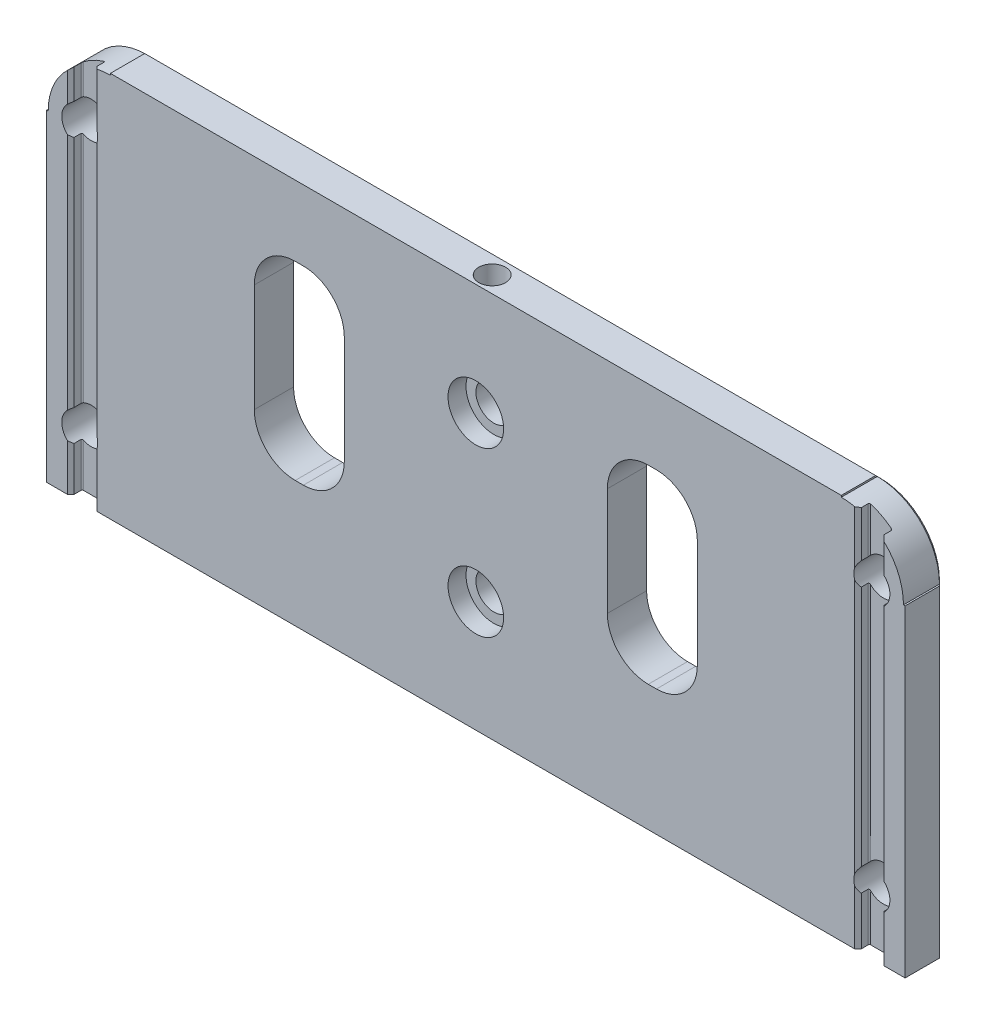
ISO-10303-21;
HEADER;
FILE_DESCRIPTION(('STEP AP214'),'2;1');
FILE_NAME('part.step','',(''),(''),'','','');
FILE_SCHEMA(('AUTOMOTIVE_DESIGN { 1 0 10303 214 1 1 1 1 }'));
ENDSEC;
DATA;
#1=APPLICATION_CONTEXT('core data for automotive mechanical design processes');
#2=APPLICATION_PROTOCOL_DEFINITION('international standard','automotive_design',2000,#1);
#3=PRODUCT_CONTEXT('',#1,'mechanical');
#4=PRODUCT('Part','Part','',(#3));
#5=PRODUCT_RELATED_PRODUCT_CATEGORY('part','',(#4));
#6=PRODUCT_DEFINITION_FORMATION('','',#4);
#7=PRODUCT_DEFINITION_CONTEXT('part definition',#1,'design');
#8=PRODUCT_DEFINITION('design','',#6,#7);
#9=PRODUCT_DEFINITION_SHAPE('','',#8);
#10=(LENGTH_UNIT() NAMED_UNIT(*) SI_UNIT(.MILLI.,.METRE.));
#11=(NAMED_UNIT(*) PLANE_ANGLE_UNIT() SI_UNIT($,.RADIAN.));
#12=(NAMED_UNIT(*) SI_UNIT($,.STERADIAN.) SOLID_ANGLE_UNIT());
#13=UNCERTAINTY_MEASURE_WITH_UNIT(LENGTH_MEASURE(1.E-05),#10,'distance_accuracy_value','');
#14=(GEOMETRIC_REPRESENTATION_CONTEXT(3) GLOBAL_UNCERTAINTY_ASSIGNED_CONTEXT((#13)) GLOBAL_UNIT_ASSIGNED_CONTEXT((#10,
#11,#12)) REPRESENTATION_CONTEXT('',''));
#15=CARTESIAN_POINT('',(0.,0.,0.));
#16=DIRECTION('',(0.,0.,1.));
#17=DIRECTION('',(1.,0.,0.));
#18=AXIS2_PLACEMENT_3D('',#15,#16,#17);
#19=CARTESIAN_POINT('',(-66.6496,-29.972,0.));
#20=DIRECTION('',(0.,0.,1.));
#21=DIRECTION('',(1.,0.,0.));
#22=AXIS2_PLACEMENT_3D('',#19,#20,#21);
#23=PLANE('',#22);
#24=CARTESIAN_POINT('',(56.7436,20.066,0.));
#25=DIRECTION('',(0.,0.,-1.));
#26=DIRECTION('',(-1.,0.,0.));
#27=AXIS2_PLACEMENT_3D('',#24,#25,#26);
#28=CIRCLE('',#27,9.652);
#29=CARTESIAN_POINT('',(63.3984,27.0570472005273,0.));
#30=VERTEX_POINT('',#29);
#31=CARTESIAN_POINT('',(66.3956,20.066,0.));
#32=VERTEX_POINT('',#31);
#33=EDGE_CURVE('E713',#30,#32,#28,.T.);
#34=ORIENTED_EDGE('',*,*,#33,.F.);
#35=DIRECTION('',(0.,-1.,0.));
#36=VECTOR('',#35,1.);
#37=CARTESIAN_POINT('',(63.3984,-29.972,0.));
#38=LINE('',#37,#36);
#39=CARTESIAN_POINT('',(63.3984,22.4908715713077,0.));
#40=VERTEX_POINT('',#39);
#41=EDGE_CURVE('E2170',#30,#40,#38,.T.);
#42=ORIENTED_EDGE('',*,*,#41,.T.);
#43=CARTESIAN_POINT('',(61.4934,20.447,0.));
#44=DIRECTION('',(0.,0.,1.));
#45=DIRECTION('',(1.,0.,0.));
#46=AXIS2_PLACEMENT_3D('',#43,#44,#45);
#47=CIRCLE('',#46,2.794);
#48=CARTESIAN_POINT('',(63.3984,18.4031284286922,0.));
#49=VERTEX_POINT('',#48);
#50=EDGE_CURVE('E655',#49,#40,#47,.T.);
#51=ORIENTED_EDGE('',*,*,#50,.F.);
#52=DIRECTION('',(0.,-1.,0.));
#53=VECTOR('',#52,1.);
#54=CARTESIAN_POINT('',(63.3984,-29.972,0.));
#55=LINE('',#54,#53);
#56=CARTESIAN_POINT('',(63.3984,-18.6571284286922,0.));
#57=VERTEX_POINT('',#56);
#58=EDGE_CURVE('E2164',#49,#57,#55,.T.);
#59=ORIENTED_EDGE('',*,*,#58,.T.);
#60=CARTESIAN_POINT('',(61.4934,-20.701,0.));
#61=DIRECTION('',(0.,0.,1.));
#62=DIRECTION('',(1.,0.,0.));
#63=AXIS2_PLACEMENT_3D('',#60,#61,#62);
#64=CIRCLE('',#63,2.794);
#65=CARTESIAN_POINT('',(63.3984,-22.7448715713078,0.));
#66=VERTEX_POINT('',#65);
#67=EDGE_CURVE('E676',#66,#57,#64,.T.);
#68=ORIENTED_EDGE('',*,*,#67,.F.);
#69=DIRECTION('',(0.,-1.,0.));
#70=VECTOR('',#69,1.);
#71=CARTESIAN_POINT('',(63.3984,-29.972,0.));
#72=LINE('',#71,#70);
#73=CARTESIAN_POINT('',(63.3984,-29.972,0.));
#74=VERTEX_POINT('',#73);
#75=EDGE_CURVE('E2167',#66,#74,#72,.T.);
#76=ORIENTED_EDGE('',*,*,#75,.T.);
#77=DIRECTION('',(1.,0.,0.));
#78=VECTOR('',#77,1.);
#79=CARTESIAN_POINT('',(-66.6496,-29.972,0.));
#80=LINE('',#79,#78);
#81=CARTESIAN_POINT('',(66.6496,-29.972,0.));
#82=VERTEX_POINT('',#81);
#83=EDGE_CURVE('E731',#74,#82,#80,.T.);
#84=ORIENTED_EDGE('',*,*,#83,.T.);
#85=DIRECTION('',(0.,1.,0.));
#86=VECTOR('',#85,1.);
#87=CARTESIAN_POINT('',(66.6496,29.972,0.));
#88=LINE('',#87,#86);
#89=CARTESIAN_POINT('',(66.6496,20.066,0.));
#90=VERTEX_POINT('',#89);
#91=EDGE_CURVE('E735',#82,#90,#88,.T.);
#92=ORIENTED_EDGE('',*,*,#91,.T.);
#93=DIRECTION('',(1.,0.,0.));
#94=VECTOR('',#93,1.);
#95=CARTESIAN_POINT('',(66.3956,20.066,0.));
#96=LINE('',#95,#94);
#97=EDGE_CURVE('E717',#32,#90,#96,.T.);
#98=ORIENTED_EDGE('',*,*,#97,.F.);
#99=EDGE_LOOP('',(#34,#42,#51,#59,#68,#76,#84,#92,#98));
#100=FACE_BOUND('',#99,.T.);
#101=ADVANCED_FACE('F16',(#100),#23,.T.);
#102=DIRECTION('',(0.,1.,0.));
#103=VECTOR('',#102,1.);
#104=CARTESIAN_POINT('',(20.4216,12.7,0.));
#105=LINE('',#104,#103);
#106=CARTESIAN_POINT('',(20.4216,-4.064,0.));
#107=VERTEX_POINT('',#106);
#108=CARTESIAN_POINT('',(20.4216,12.7,0.));
#109=VERTEX_POINT('',#108);
#110=EDGE_CURVE('E568',#107,#109,#105,.T.);
#111=ORIENTED_EDGE('',*,*,#110,.T.);
#112=CARTESIAN_POINT('',(26.7716,12.7,0.));
#113=DIRECTION('',(0.,0.,-1.));
#114=DIRECTION('',(-1.,0.,0.));
#115=AXIS2_PLACEMENT_3D('',#112,#113,#114);
#116=CIRCLE('',#115,6.35);
#117=CARTESIAN_POINT('',(26.7716,19.05,0.));
#118=VERTEX_POINT('',#117);
#119=EDGE_CURVE('E546',#109,#118,#116,.T.);
#120=ORIENTED_EDGE('',*,*,#119,.T.);
#121=DIRECTION('',(1.,0.,0.));
#122=VECTOR('',#121,1.);
#123=CARTESIAN_POINT('',(28.0416,19.05,0.));
#124=LINE('',#123,#122);
#125=CARTESIAN_POINT('',(28.0416,19.05,0.));
#126=VERTEX_POINT('',#125);
#127=EDGE_CURVE('E550',#118,#126,#124,.T.);
#128=ORIENTED_EDGE('',*,*,#127,.T.);
#129=CARTESIAN_POINT('',(28.0416,12.7,0.));
#130=DIRECTION('',(0.,0.,-1.));
#131=DIRECTION('',(-1.,0.,0.));
#132=AXIS2_PLACEMENT_3D('',#129,#130,#131);
#133=CIRCLE('',#132,6.35);
#134=CARTESIAN_POINT('',(34.3916,12.7,0.));
#135=VERTEX_POINT('',#134);
#136=EDGE_CURVE('E583',#126,#135,#133,.T.);
#137=ORIENTED_EDGE('',*,*,#136,.T.);
#138=DIRECTION('',(0.,-1.,0.));
#139=VECTOR('',#138,1.);
#140=CARTESIAN_POINT('',(34.3916,12.7,0.));
#141=LINE('',#140,#139);
#142=CARTESIAN_POINT('',(34.3916,-4.064,0.));
#143=VERTEX_POINT('',#142);
#144=EDGE_CURVE('E580',#135,#143,#141,.T.);
#145=ORIENTED_EDGE('',*,*,#144,.T.);
#146=CARTESIAN_POINT('',(28.0416,-4.064,0.));
#147=DIRECTION('',(0.,0.,-1.));
#148=DIRECTION('',(-1.,0.,0.));
#149=AXIS2_PLACEMENT_3D('',#146,#147,#148);
#150=CIRCLE('',#149,6.35);
#151=CARTESIAN_POINT('',(28.0416,-10.414,0.));
#152=VERTEX_POINT('',#151);
#153=EDGE_CURVE('E577',#143,#152,#150,.T.);
#154=ORIENTED_EDGE('',*,*,#153,.T.);
#155=DIRECTION('',(-1.,0.,0.));
#156=VECTOR('',#155,1.);
#157=CARTESIAN_POINT('',(28.0416,-10.414,0.));
#158=LINE('',#157,#156);
#159=CARTESIAN_POINT('',(26.7716,-10.414,0.));
#160=VERTEX_POINT('',#159);
#161=EDGE_CURVE('E574',#152,#160,#158,.T.);
#162=ORIENTED_EDGE('',*,*,#161,.T.);
#163=CARTESIAN_POINT('',(26.7716,-4.064,0.));
#164=DIRECTION('',(0.,0.,-1.));
#165=DIRECTION('',(-1.,0.,0.));
#166=AXIS2_PLACEMENT_3D('',#163,#164,#165);
#167=CIRCLE('',#166,6.35);
#168=EDGE_CURVE('E571',#160,#107,#167,.T.);
#169=ORIENTED_EDGE('',*,*,#168,.T.);
#170=EDGE_LOOP('',(#111,#120,#128,#137,#145,#154,#162,#169));
#171=FACE_BOUND('',#170,.T.);
#172=CARTESIAN_POINT('',(-26.7716,12.7,0.));
#173=DIRECTION('',(0.,0.,1.));
#174=DIRECTION('',(1.,0.,0.));
#175=AXIS2_PLACEMENT_3D('',#172,#173,#174);
#176=CIRCLE('',#175,6.35);
#177=CARTESIAN_POINT('',(-20.4216,12.7,0.));
#178=VERTEX_POINT('',#177);
#179=CARTESIAN_POINT('',(-26.7716,19.05,0.));
#180=VERTEX_POINT('',#179);
#181=EDGE_CURVE('E591',#178,#180,#176,.T.);
#182=ORIENTED_EDGE('',*,*,#181,.F.);
#183=DIRECTION('',(0.,1.,0.));
#184=VECTOR('',#183,1.);
#185=CARTESIAN_POINT('',(-20.4216,12.7,0.));
#186=LINE('',#185,#184);
#187=CARTESIAN_POINT('',(-20.4216,-4.064,0.));
#188=VERTEX_POINT('',#187);
#189=EDGE_CURVE('E610',#188,#178,#186,.T.);
#190=ORIENTED_EDGE('',*,*,#189,.F.);
#191=CARTESIAN_POINT('',(-26.7716,-4.064,0.));
#192=DIRECTION('',(0.,0.,1.));
#193=DIRECTION('',(1.,0.,0.));
#194=AXIS2_PLACEMENT_3D('',#191,#192,#193);
#195=CIRCLE('',#194,6.35);
#196=CARTESIAN_POINT('',(-26.7716,-10.414,0.));
#197=VERTEX_POINT('',#196);
#198=EDGE_CURVE('E648',#197,#188,#195,.T.);
#199=ORIENTED_EDGE('',*,*,#198,.F.);
#200=DIRECTION('',(1.,0.,0.));
#201=VECTOR('',#200,1.);
#202=CARTESIAN_POINT('',(-28.0416,-10.414,0.));
#203=LINE('',#202,#201);
#204=CARTESIAN_POINT('',(-28.0416,-10.414,0.));
#205=VERTEX_POINT('',#204);
#206=EDGE_CURVE('E645',#205,#197,#203,.T.);
#207=ORIENTED_EDGE('',*,*,#206,.F.);
#208=CARTESIAN_POINT('',(-28.0416,-4.064,0.));
#209=DIRECTION('',(0.,0.,1.));
#210=DIRECTION('',(1.,0.,0.));
#211=AXIS2_PLACEMENT_3D('',#208,#209,#210);
#212=CIRCLE('',#211,6.35);
#213=CARTESIAN_POINT('',(-34.3916,-4.064,0.));
#214=VERTEX_POINT('',#213);
#215=EDGE_CURVE('E642',#214,#205,#212,.T.);
#216=ORIENTED_EDGE('',*,*,#215,.F.);
#217=DIRECTION('',(0.,-1.,0.));
#218=VECTOR('',#217,1.);
#219=CARTESIAN_POINT('',(-34.3916,12.7,0.));
#220=LINE('',#219,#218);
#221=CARTESIAN_POINT('',(-34.3916,12.7,0.));
#222=VERTEX_POINT('',#221);
#223=EDGE_CURVE('E639',#222,#214,#220,.T.);
#224=ORIENTED_EDGE('',*,*,#223,.F.);
#225=CARTESIAN_POINT('',(-28.0416,12.7,0.));
#226=DIRECTION('',(0.,0.,1.));
#227=DIRECTION('',(1.,0.,0.));
#228=AXIS2_PLACEMENT_3D('',#225,#226,#227);
#229=CIRCLE('',#228,6.35);
#230=CARTESIAN_POINT('',(-28.0416,19.05,0.));
#231=VERTEX_POINT('',#230);
#232=EDGE_CURVE('E636',#231,#222,#229,.T.);
#233=ORIENTED_EDGE('',*,*,#232,.F.);
#234=DIRECTION('',(-1.,0.,0.));
#235=VECTOR('',#234,1.);
#236=CARTESIAN_POINT('',(-28.0416,19.05,0.));
#237=LINE('',#236,#235);
#238=EDGE_CURVE('E633',#180,#231,#237,.T.);
#239=ORIENTED_EDGE('',*,*,#238,.F.);
#240=EDGE_LOOP('',(#182,#190,#199,#207,#216,#224,#233,#239));
#241=FACE_BOUND('',#240,.T.);
#242=CARTESIAN_POINT('',(0.,-12.7,0.));
#243=DIRECTION('',(0.,0.,1.));
#244=DIRECTION('',(1.,0.,0.));
#245=AXIS2_PLACEMENT_3D('',#242,#243,#244);
#246=CIRCLE('',#245,4.318);
#247=CARTESIAN_POINT('',(4.318,-12.7,0.));
#248=VERTEX_POINT('',#247);
#249=EDGE_CURVE('E543',#248,#248,#246,.T.);
#250=ORIENTED_EDGE('',*,*,#249,.F.);
#251=EDGE_LOOP('',(#250));
#252=FACE_BOUND('',#251,.T.);
#253=CARTESIAN_POINT('',(0.,12.7,0.));
#254=DIRECTION('',(0.,0.,1.));
#255=DIRECTION('',(1.,0.,0.));
#256=AXIS2_PLACEMENT_3D('',#253,#254,#255);
#257=CIRCLE('',#256,4.318);
#258=CARTESIAN_POINT('',(4.318,12.7,0.));
#259=VERTEX_POINT('',#258);
#260=EDGE_CURVE('E531',#259,#259,#257,.T.);
#261=ORIENTED_EDGE('',*,*,#260,.F.);
#262=EDGE_LOOP('',(#261));
#263=FACE_BOUND('',#262,.T.);
#264=CARTESIAN_POINT('',(58.8264,21.2797946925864,0.));
#265=VERTEX_POINT('',#264);
#266=CARTESIAN_POINT('',(58.8264,19.6142053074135,0.));
#267=VERTEX_POINT('',#266);
#268=EDGE_CURVE('E672',#265,#267,#47,.T.);
#269=ORIENTED_EDGE('',*,*,#268,.F.);
#270=DIRECTION('',(0.,1.,0.));
#271=VECTOR('',#270,1.);
#272=CARTESIAN_POINT('',(58.8264,-29.972,0.));
#273=LINE('',#272,#271);
#274=CARTESIAN_POINT('',(58.8264,29.4905980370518,0.));
#275=VERTEX_POINT('',#274);
#276=EDGE_CURVE('E2147',#265,#275,#273,.T.);
#277=ORIENTED_EDGE('',*,*,#276,.T.);
#278=CARTESIAN_POINT('',(56.7436,29.718,0.));
#279=VERTEX_POINT('',#278);
#280=EDGE_CURVE('E714',#279,#275,#28,.T.);
#281=ORIENTED_EDGE('',*,*,#280,.F.);
#282=DIRECTION('',(0.,-1.,0.));
#283=VECTOR('',#282,1.);
#284=CARTESIAN_POINT('',(56.7436,-29.972,0.));
#285=LINE('',#284,#283);
#286=CARTESIAN_POINT('',(56.7436,29.972,0.));
#287=VERTEX_POINT('',#286);
#288=EDGE_CURVE('E745',#287,#279,#285,.T.);
#289=ORIENTED_EDGE('',*,*,#288,.F.);
#290=DIRECTION('',(-1.,0.,0.));
#291=VECTOR('',#290,1.);
#292=CARTESIAN_POINT('',(-66.6496,29.972,0.));
#293=LINE('',#292,#291);
#294=CARTESIAN_POINT('',(-56.7436,29.972,0.));
#295=VERTEX_POINT('',#294);
#296=EDGE_CURVE('E739',#287,#295,#293,.T.);
#297=ORIENTED_EDGE('',*,*,#296,.T.);
#298=DIRECTION('',(0.,-1.,0.));
#299=VECTOR('',#298,1.);
#300=CARTESIAN_POINT('',(-56.7436,-29.972,0.));
#301=LINE('',#300,#299);
#302=CARTESIAN_POINT('',(-56.7436,29.718,0.));
#303=VERTEX_POINT('',#302);
#304=EDGE_CURVE('E749',#295,#303,#301,.T.);
#305=ORIENTED_EDGE('',*,*,#304,.T.);
#306=CARTESIAN_POINT('',(-56.7436,20.066,0.));
#307=DIRECTION('',(0.,0.,1.));
#308=DIRECTION('',(1.,0.,0.));
#309=AXIS2_PLACEMENT_3D('',#306,#307,#308);
#310=CIRCLE('',#309,9.652);
#311=CARTESIAN_POINT('',(-58.8264,29.4905980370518,0.));
#312=VERTEX_POINT('',#311);
#313=EDGE_CURVE('E701',#303,#312,#310,.T.);
#314=ORIENTED_EDGE('',*,*,#313,.T.);
#315=DIRECTION('',(0.,-1.,0.));
#316=VECTOR('',#315,1.);
#317=CARTESIAN_POINT('',(-58.8264,22.2204584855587,0.));
#318=LINE('',#317,#316);
#319=CARTESIAN_POINT('',(-58.8264,21.2797946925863,0.));
#320=VERTEX_POINT('',#319);
#321=EDGE_CURVE('E1065',#312,#320,#318,.T.);
#322=ORIENTED_EDGE('',*,*,#321,.T.);
#323=CARTESIAN_POINT('',(-61.4934,20.447,0.));
#324=DIRECTION('',(0.,0.,1.));
#325=DIRECTION('',(1.,0.,0.));
#326=AXIS2_PLACEMENT_3D('',#323,#324,#325);
#327=CIRCLE('',#326,2.794);
#328=CARTESIAN_POINT('',(-58.8264,19.6142053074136,0.));
#329=VERTEX_POINT('',#328);
#330=EDGE_CURVE('E683',#329,#320,#327,.T.);
#331=ORIENTED_EDGE('',*,*,#330,.F.);
#332=DIRECTION('',(0.,-1.,0.));
#333=VECTOR('',#332,1.);
#334=CARTESIAN_POINT('',(-58.8264,-18.9275415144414,0.));
#335=LINE('',#334,#333);
#336=CARTESIAN_POINT('',(-58.8264,-19.8682053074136,0.));
#337=VERTEX_POINT('',#336);
#338=EDGE_CURVE('E2137',#329,#337,#335,.T.);
#339=ORIENTED_EDGE('',*,*,#338,.T.);
#340=CARTESIAN_POINT('',(-61.4934,-20.701,0.));
#341=DIRECTION('',(0.,0.,1.));
#342=DIRECTION('',(1.,0.,0.));
#343=AXIS2_PLACEMENT_3D('',#340,#341,#342);
#344=CIRCLE('',#343,2.794);
#345=CARTESIAN_POINT('',(-58.8264,-21.5337946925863,0.));
#346=VERTEX_POINT('',#345);
#347=EDGE_CURVE('E690',#346,#337,#344,.T.);
#348=ORIENTED_EDGE('',*,*,#347,.F.);
#349=DIRECTION('',(0.,-1.,0.));
#350=VECTOR('',#349,1.);
#351=CARTESIAN_POINT('',(-58.8264,-29.972,0.));
#352=LINE('',#351,#350);
#353=CARTESIAN_POINT('',(-58.8264,-29.972,0.));
#354=VERTEX_POINT('',#353);
#355=EDGE_CURVE('E2127',#346,#354,#352,.T.);
#356=ORIENTED_EDGE('',*,*,#355,.T.);
#357=CARTESIAN_POINT('',(58.8264,-29.972,0.));
#358=VERTEX_POINT('',#357);
#359=EDGE_CURVE('E736',#354,#358,#80,.T.);
#360=ORIENTED_EDGE('',*,*,#359,.T.);
#361=DIRECTION('',(0.,1.,0.));
#362=VECTOR('',#361,1.);
#363=CARTESIAN_POINT('',(58.8264,-29.972,0.));
#364=LINE('',#363,#362);
#365=CARTESIAN_POINT('',(58.8264,-21.5337946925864,0.));
#366=VERTEX_POINT('',#365);
#367=EDGE_CURVE('E2144',#358,#366,#364,.T.);
#368=ORIENTED_EDGE('',*,*,#367,.T.);
#369=CARTESIAN_POINT('',(58.8264,-19.8682053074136,0.));
#370=VERTEX_POINT('',#369);
#371=EDGE_CURVE('E679',#370,#366,#64,.T.);
#372=ORIENTED_EDGE('',*,*,#371,.F.);
#373=DIRECTION('',(0.,1.,0.));
#374=VECTOR('',#373,1.);
#375=CARTESIAN_POINT('',(58.8264,-29.972,0.));
#376=LINE('',#375,#374);
#377=EDGE_CURVE('E2139',#370,#267,#376,.T.);
#378=ORIENTED_EDGE('',*,*,#377,.T.);
#379=EDGE_LOOP('',(#269,#277,#281,#289,#297,#305,#314,#322,#331,#339,#348,#356,#360,#368,#372,#378));
#380=FACE_BOUND('',#379,.T.);
#381=ADVANCED_FACE('F1084',(#171,#241,#252,#263,#380),#23,.T.);
#382=CARTESIAN_POINT('',(-66.6496,-29.972,-6.096));
#383=DIRECTION('',(0.,-1.,0.));
#384=DIRECTION('',(1.,0.,0.));
#385=AXIS2_PLACEMENT_3D('',#382,#383,#384);
#386=PLANE('',#385);
#387=DIRECTION('',(0.,0.,1.));
#388=VECTOR('',#387,1.);
#389=CARTESIAN_POINT('',(-66.6496,-29.972,-6.096));
#390=LINE('',#389,#388);
#391=CARTESIAN_POINT('',(-66.6496,-29.972,-5.334));
#392=VERTEX_POINT('',#391);
#393=CARTESIAN_POINT('',(-66.6496,-29.972,0.));
#394=VERTEX_POINT('',#393);
#395=EDGE_CURVE('E742',#392,#394,#390,.T.);
#396=ORIENTED_EDGE('',*,*,#395,.F.);
#397=DIRECTION('',(1.,0.,0.));
#398=VECTOR('',#397,1.);
#399=CARTESIAN_POINT('',(66.6496,-29.972,-5.334));
#400=LINE('',#399,#398);
#401=CARTESIAN_POINT('',(66.6496,-29.972,-5.334));
#402=VERTEX_POINT('',#401);
#403=EDGE_CURVE('E1183',#392,#402,#400,.T.);
#404=ORIENTED_EDGE('',*,*,#403,.T.);
#405=DIRECTION('',(0.,0.,1.));
#406=VECTOR('',#405,1.);
#407=CARTESIAN_POINT('',(66.6496,-29.972,-6.096));
#408=LINE('',#407,#406);
#409=EDGE_CURVE('E743',#402,#82,#408,.T.);
#410=ORIENTED_EDGE('',*,*,#409,.T.);
#411=ORIENTED_EDGE('',*,*,#83,.F.);
#412=DIRECTION('',(0.707106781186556,0.,0.707106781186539));
#413=VECTOR('',#412,1.);
#414=CARTESIAN_POINT('',(-4.67360000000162,-29.972,-68.072));
#415=LINE('',#414,#413);
#416=CARTESIAN_POINT('',(62.8904,-29.972,-0.508));
#417=VERTEX_POINT('',#416);
#418=EDGE_CURVE('E2178',#74,#417,#415,.F.);
#419=ORIENTED_EDGE('',*,*,#418,.T.);
#420=DIRECTION('',(0.,0.,-1.));
#421=VECTOR('',#420,1.);
#422=CARTESIAN_POINT('',(62.8904,-29.972,-6.096));
#423=LINE('',#422,#421);
#424=CARTESIAN_POINT('',(62.8904,-29.972,-1.5748));
#425=VERTEX_POINT('',#424);
#426=EDGE_CURVE('E2056',#417,#425,#423,.T.);
#427=ORIENTED_EDGE('',*,*,#426,.T.);
#428=CARTESIAN_POINT('',(62.6872,-29.972,-1.5748));
#429=DIRECTION('',(0.,-1.,0.));
#430=DIRECTION('',(1.,0.,0.));
#431=AXIS2_PLACEMENT_3D('',#428,#429,#430);
#432=CIRCLE('',#431,0.2032);
#433=CARTESIAN_POINT('',(62.6872,-29.972,-1.778));
#434=VERTEX_POINT('',#433);
#435=EDGE_CURVE('E844',#425,#434,#432,.F.);
#436=ORIENTED_EDGE('',*,*,#435,.T.);
#437=DIRECTION('',(-1.,0.,0.));
#438=VECTOR('',#437,1.);
#439=CARTESIAN_POINT('',(-66.6496,-29.972,-1.778));
#440=LINE('',#439,#438);
#441=CARTESIAN_POINT('',(59.5376,-29.972,-1.778));
#442=VERTEX_POINT('',#441);
#443=EDGE_CURVE('E2273',#434,#442,#440,.T.);
#444=ORIENTED_EDGE('',*,*,#443,.T.);
#445=CARTESIAN_POINT('',(59.5376,-29.972,-1.5748));
#446=DIRECTION('',(0.,-1.,0.));
#447=DIRECTION('',(1.,0.,0.));
#448=AXIS2_PLACEMENT_3D('',#445,#446,#447);
#449=CIRCLE('',#448,0.2032);
#450=CARTESIAN_POINT('',(59.3344,-29.972,-1.5748));
#451=VERTEX_POINT('',#450);
#452=EDGE_CURVE('E956',#442,#451,#449,.F.);
#453=ORIENTED_EDGE('',*,*,#452,.T.);
#454=DIRECTION('',(0.,0.,1.));
#455=VECTOR('',#454,1.);
#456=CARTESIAN_POINT('',(59.3344,-29.972,-6.096));
#457=LINE('',#456,#455);
#458=CARTESIAN_POINT('',(59.3344,-29.972,-0.508000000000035));
#459=VERTEX_POINT('',#458);
#460=EDGE_CURVE('E2228',#451,#459,#457,.T.);
#461=ORIENTED_EDGE('',*,*,#460,.T.);
#462=DIRECTION('',(0.707106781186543,0.,-0.707106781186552));
#463=VECTOR('',#462,1.);
#464=CARTESIAN_POINT('',(-0.863599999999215,-29.972,59.69));
#465=LINE('',#464,#463);
#466=EDGE_CURVE('E2176',#459,#358,#465,.F.);
#467=ORIENTED_EDGE('',*,*,#466,.T.);
#468=ORIENTED_EDGE('',*,*,#359,.F.);
#469=DIRECTION('',(-0.707106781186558,0.,-0.707106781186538));
#470=VECTOR('',#469,1.);
#471=CARTESIAN_POINT('',(-65.786,-29.972,-6.95959999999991));
#472=LINE('',#471,#470);
#473=CARTESIAN_POINT('',(-59.3344,-29.972,-0.507999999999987));
#474=VERTEX_POINT('',#473);
#475=EDGE_CURVE('E2126',#354,#474,#472,.T.);
#476=ORIENTED_EDGE('',*,*,#475,.T.);
#477=DIRECTION('',(0.,0.,1.));
#478=VECTOR('',#477,1.);
#479=CARTESIAN_POINT('',(-59.3344,-29.972,-6.096));
#480=LINE('',#479,#478);
#481=CARTESIAN_POINT('',(-59.3344,-29.972,-1.5748));
#482=VERTEX_POINT('',#481);
#483=EDGE_CURVE('E2081',#482,#474,#480,.T.);
#484=ORIENTED_EDGE('',*,*,#483,.F.);
#485=CARTESIAN_POINT('',(-59.5376,-29.972,-1.5748));
#486=DIRECTION('',(0.,-1.,0.));
#487=DIRECTION('',(1.,0.,0.));
#488=AXIS2_PLACEMENT_3D('',#485,#486,#487);
#489=CIRCLE('',#488,0.2032);
#490=CARTESIAN_POINT('',(-59.5376,-29.972,-1.778));
#491=VERTEX_POINT('',#490);
#492=EDGE_CURVE('E965',#482,#491,#489,.F.);
#493=ORIENTED_EDGE('',*,*,#492,.T.);
#494=DIRECTION('',(-1.,0.,0.));
#495=VECTOR('',#494,1.);
#496=CARTESIAN_POINT('',(-66.6496,-29.972,-1.778));
#497=LINE('',#496,#495);
#498=CARTESIAN_POINT('',(-62.6872,-29.972,-1.778));
#499=VERTEX_POINT('',#498);
#500=EDGE_CURVE('E2071',#491,#499,#497,.T.);
#501=ORIENTED_EDGE('',*,*,#500,.T.);
#502=CARTESIAN_POINT('',(-62.6872,-29.972,-1.5748));
#503=DIRECTION('',(0.,-1.,0.));
#504=DIRECTION('',(1.,0.,0.));
#505=AXIS2_PLACEMENT_3D('',#502,#503,#504);
#506=CIRCLE('',#505,0.2032);
#507=CARTESIAN_POINT('',(-62.8904,-29.972,-1.5748));
#508=VERTEX_POINT('',#507);
#509=EDGE_CURVE('E1026',#499,#508,#506,.F.);
#510=ORIENTED_EDGE('',*,*,#509,.T.);
#511=DIRECTION('',(0.,0.,-1.));
#512=VECTOR('',#511,1.);
#513=CARTESIAN_POINT('',(-62.8904,-29.972,-6.096));
#514=LINE('',#513,#512);
#515=CARTESIAN_POINT('',(-62.8904,-29.972,-0.507999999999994));
#516=VERTEX_POINT('',#515);
#517=EDGE_CURVE('E508',#516,#508,#514,.T.);
#518=ORIENTED_EDGE('',*,*,#517,.F.);
#519=DIRECTION('',(-0.707106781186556,0.,0.707106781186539));
#520=VECTOR('',#519,1.);
#521=CARTESIAN_POINT('',(-61.976,-29.972,-1.42239999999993));
#522=LINE('',#521,#520);
#523=CARTESIAN_POINT('',(-63.3984,-29.972,0.));
#524=VERTEX_POINT('',#523);
#525=EDGE_CURVE('E1113',#516,#524,#522,.T.);
#526=ORIENTED_EDGE('',*,*,#525,.T.);
#527=EDGE_CURVE('E732',#394,#524,#80,.T.);
#528=ORIENTED_EDGE('',*,*,#527,.F.);
#529=EDGE_LOOP('',(#396,#404,#410,#411,#419,#427,#436,#444,#453,#461,#467,#468,#476,#484,#493,
#501,#510,#518,#526,#528));
#530=FACE_BOUND('',#529,.T.);
#531=ADVANCED_FACE('F1090',(#530),#386,.T.);
#532=CARTESIAN_POINT('',(56.7436,20.066,-6.096));
#533=DIRECTION('',(0.,0.,1.));
#534=DIRECTION('',(1.,0.,0.));
#535=AXIS2_PLACEMENT_3D('',#532,#533,#534);
#536=CYLINDRICAL_SURFACE('',#535,9.652);
#537=DIRECTION('',(0.,0.,1.));
#538=VECTOR('',#537,1.);
#539=CARTESIAN_POINT('',(66.3956,20.066,-6.096));
#540=LINE('',#539,#538);
#541=CARTESIAN_POINT('',(66.3956,20.066,-5.588));
#542=VERTEX_POINT('',#541);
#543=EDGE_CURVE('E720',#542,#32,#540,.T.);
#544=ORIENTED_EDGE('',*,*,#543,.F.);
#545=CARTESIAN_POINT('',(56.7436,20.066,-5.588));
#546=DIRECTION('',(0.,0.,1.));
#547=DIRECTION('',(1.,0.,0.));
#548=AXIS2_PLACEMENT_3D('',#545,#546,#547);
#549=CIRCLE('',#548,9.652);
#550=CARTESIAN_POINT('',(56.7436,29.718,-5.588));
#551=VERTEX_POINT('',#550);
#552=EDGE_CURVE('E10',#542,#551,#549,.T.);
#553=ORIENTED_EDGE('',*,*,#552,.T.);
#554=DIRECTION('',(0.,0.,1.));
#555=VECTOR('',#554,1.);
#556=CARTESIAN_POINT('',(56.7436,29.718,-6.096));
#557=LINE('',#556,#555);
#558=EDGE_CURVE('E719',#551,#279,#557,.T.);
#559=ORIENTED_EDGE('',*,*,#558,.T.);
#560=ORIENTED_EDGE('',*,*,#280,.T.);
#561=CARTESIAN_POINT('',(56.7436,20.066,2.0828));
#562=DIRECTION('',(-0.707106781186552,0.,-0.707106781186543));
#563=DIRECTION('',(-0.707106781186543,0.,0.707106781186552));
#564=AXIS2_PLACEMENT_3D('',#561,#562,#563);
#565=ELLIPSE('',#564,13.6499893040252,9.652);
#566=CARTESIAN_POINT('',(59.3344,29.363787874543,-0.508));
#567=VERTEX_POINT('',#566);
#568=EDGE_CURVE('E2152',#275,#567,#565,.T.);
#569=ORIENTED_EDGE('',*,*,#568,.T.);
#570=DIRECTION('',(0.,0.,1.));
#571=VECTOR('',#570,1.);
#572=CARTESIAN_POINT('',(59.3344,29.363787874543,-6.096));
#573=LINE('',#572,#571);
#574=CARTESIAN_POINT('',(59.3344,29.363787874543,-1.5748));
#575=VERTEX_POINT('',#574);
#576=EDGE_CURVE('E2225',#575,#567,#573,.T.);
#577=ORIENTED_EDGE('',*,*,#576,.F.);
#578=CARTESIAN_POINT('',(59.3344,29.363787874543,-1.5748));
#579=CARTESIAN_POINT('',(59.3343889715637,29.3637903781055,-1.58592168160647));
#580=CARTESIAN_POINT('',(59.3353123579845,29.3635336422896,-1.59703818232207));
#581=CARTESIAN_POINT('',(59.3389439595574,29.3625208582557,-1.61893295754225));
#582=CARTESIAN_POINT('',(59.3416490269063,29.3617656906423,-1.62971179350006));
#583=CARTESIAN_POINT('',(59.3487610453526,29.3597749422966,-1.65064627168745));
#584=CARTESIAN_POINT('',(59.3531682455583,29.358539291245,-1.66080182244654));
#585=CARTESIAN_POINT('',(59.3635347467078,29.3556218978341,-1.68021618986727));
#586=CARTESIAN_POINT('',(59.369494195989,29.3539401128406,-1.68947492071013));
#587=CARTESIAN_POINT('',(59.3828769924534,29.3501461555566,-1.70699051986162));
#588=CARTESIAN_POINT('',(59.3903208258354,29.348027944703,-1.71523040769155));
#589=CARTESIAN_POINT('',(59.4063873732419,29.3434316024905,-1.73034809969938));
#590=CARTESIAN_POINT('',(59.4150103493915,29.3409533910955,-1.73722560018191));
#591=CARTESIAN_POINT('',(59.433506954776,29.3356062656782,-1.74968147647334));
#592=CARTESIAN_POINT('',(59.4434138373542,29.3327266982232,-1.7552058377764));
#593=CARTESIAN_POINT('',(59.4639441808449,29.3267205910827,-1.76451580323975));
#594=CARTESIAN_POINT('',(59.4745676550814,29.3235940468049,-1.76830137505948));
#595=CARTESIAN_POINT('',(59.4939353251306,29.3178559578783,-1.77344955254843));
#596=CARTESIAN_POINT('',(59.5025994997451,29.3152760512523,-1.77515598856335));
#597=CARTESIAN_POINT('',(59.5200432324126,29.3100549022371,-1.77743122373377));
#598=CARTESIAN_POINT('',(59.5288225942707,29.3074137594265,-1.77800175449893));
#599=CARTESIAN_POINT('',(59.5376,29.3047590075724,-1.778));
#600=B_SPLINE_CURVE_WITH_KNOTS('',3,(#578,#579,#580,#581,#582,#583,#584,#585,#586,#587,#588,
#589,#590,#591,#592,#593,#594,#595,#596,#597,#598,#599),.UNSPECIFIED.,.F.,.F.,(4,2,2,2,2,2,2,2,
2,2,4),(0.,0.0333159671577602,0.0665732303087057,0.0998353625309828,0.133100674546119,
0.16686156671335,0.200629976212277,0.235582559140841,0.27053579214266,0.298066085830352,
0.32555437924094),.UNSPECIFIED.);
#601=CARTESIAN_POINT('',(59.5376,29.3047590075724,-1.778));
#602=VERTEX_POINT('',#601);
#603=EDGE_CURVE('E917',#575,#602,#600,.T.);
#604=ORIENTED_EDGE('',*,*,#603,.T.);
#605=CARTESIAN_POINT('',(56.7436,20.066,-1.778));
#606=DIRECTION('',(0.,0.,1.));
#607=DIRECTION('',(1.,0.,0.));
#608=AXIS2_PLACEMENT_3D('',#605,#606,#607);
#609=CIRCLE('',#608,9.652);
#610=CARTESIAN_POINT('',(62.6872,27.6709144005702,-1.778));
#611=VERTEX_POINT('',#610);
#612=EDGE_CURVE('E2277',#611,#602,#609,.T.);
#613=ORIENTED_EDGE('',*,*,#612,.F.);
#614=CARTESIAN_POINT('',(62.6872,27.6709144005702,-1.778));
#615=CARTESIAN_POINT('',(62.7007198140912,27.6603502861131,-1.7779911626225));
#616=CARTESIAN_POINT('',(62.7142260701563,27.6497342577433,-1.77664930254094));
#617=CARTESIAN_POINT('',(62.7409259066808,27.6286363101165,-1.77124719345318));
#618=CARTESIAN_POINT('',(62.7541170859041,27.6181555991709,-1.76717046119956));
#619=CARTESIAN_POINT('',(62.7781630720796,27.5989517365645,-1.75691287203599));
#620=CARTESIAN_POINT('',(62.7891064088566,27.590170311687,-1.75104999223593));
#621=CARTESIAN_POINT('',(62.8100629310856,27.5732838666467,-1.73713486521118));
#622=CARTESIAN_POINT('',(62.8200782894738,27.5651772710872,-1.72908791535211));
#623=CARTESIAN_POINT('',(62.8367091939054,27.5516671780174,-1.71279031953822));
#624=CARTESIAN_POINT('',(62.8435874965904,27.5460617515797,-1.70497565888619));
#625=CARTESIAN_POINT('',(62.8562698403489,27.5357013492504,-1.68801391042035));
#626=CARTESIAN_POINT('',(62.8620748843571,27.5309455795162,-1.67886808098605));
#627=CARTESIAN_POINT('',(62.8714215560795,27.5232741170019,-1.66103228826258));
#628=CARTESIAN_POINT('',(62.8751805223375,27.5201828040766,-1.65253218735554));
#629=CARTESIAN_POINT('',(62.881551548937,27.5149376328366,-1.63484716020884));
#630=CARTESIAN_POINT('',(62.8841657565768,27.5127820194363,-1.62566355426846));
#631=CARTESIAN_POINT('',(62.8875315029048,27.5100051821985,-1.60951253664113));
#632=CARTESIAN_POINT('',(62.8886009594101,27.5091222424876,-1.60265463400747));
#633=CARTESIAN_POINT('',(62.890038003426,27.5079355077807,-1.58880015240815));
#634=CARTESIAN_POINT('',(62.8904039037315,27.5076331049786,-1.58180328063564));
#635=CARTESIAN_POINT('',(62.8904,27.507636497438,-1.5748));
#636=B_SPLINE_CURVE_WITH_KNOTS('',3,(#614,#615,#616,#617,#618,#619,#620,#621,#622,#623,#624,
#625,#626,#627,#628,#629,#630,#631,#632,#633,#634,#635),.UNSPECIFIED.,.F.,.F.,(4,2,2,2,2,2,2,2,
2,2,4),(0.,0.051458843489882,0.10323065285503,0.148676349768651,0.194012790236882,
0.229354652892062,0.264663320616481,0.293929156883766,0.323139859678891,0.344072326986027,
0.365054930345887),.UNSPECIFIED.);
#637=CARTESIAN_POINT('',(62.8904,27.507636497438,-1.5748));
#638=VERTEX_POINT('',#637);
#639=EDGE_CURVE('E2034',#611,#638,#636,.T.);
#640=ORIENTED_EDGE('',*,*,#639,.T.);
#641=DIRECTION('',(0.,0.,1.));
#642=VECTOR('',#641,1.);
#643=CARTESIAN_POINT('',(62.8904,27.507636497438,-6.096));
#644=LINE('',#643,#642);
#645=CARTESIAN_POINT('',(62.8904,27.507636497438,-0.507999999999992));
#646=VERTEX_POINT('',#645);
#647=EDGE_CURVE('E2053',#646,#638,#644,.F.);
#648=ORIENTED_EDGE('',*,*,#647,.F.);
#649=CARTESIAN_POINT('',(56.7436,20.066,-6.65479999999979));
#650=DIRECTION('',(0.707106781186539,0.,-0.707106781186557));
#651=DIRECTION('',(0.707106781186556,0.,0.707106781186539));
#652=AXIS2_PLACEMENT_3D('',#649,#650,#651);
#653=ELLIPSE('',#652,13.6499893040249,9.652);
#654=EDGE_CURVE('E2150',#646,#30,#653,.T.);
#655=ORIENTED_EDGE('',*,*,#654,.T.);
#656=ORIENTED_EDGE('',*,*,#33,.T.);
#657=EDGE_LOOP('',(#544,#553,#559,#560,#569,#577,#604,#613,#640,#648,#655,#656));
#658=FACE_BOUND('',#657,.T.);
#659=ADVANCED_FACE('F1213',(#658),#536,.T.);
#660=CARTESIAN_POINT('',(61.4934,-20.701,0.));
#661=DIRECTION('',(0.,0.,1.));
#662=DIRECTION('',(1.,0.,0.));
#663=AXIS2_PLACEMENT_3D('',#660,#661,#662);
#664=CYLINDRICAL_SURFACE('',#663,2.794);
#665=CARTESIAN_POINT('',(61.4934,-20.701,-6.096));
#666=DIRECTION('',(0.,0.,1.));
#667=DIRECTION('',(1.,0.,0.));
#668=AXIS2_PLACEMENT_3D('',#665,#666,#667);
#669=CIRCLE('',#668,2.794);
#670=CARTESIAN_POINT('',(64.2874,-20.701,-6.096));
#671=VERTEX_POINT('',#670);
#672=EDGE_CURVE('E680',#671,#671,#669,.T.);
#673=ORIENTED_EDGE('',*,*,#672,.F.);
#674=EDGE_LOOP('',(#673));
#675=FACE_BOUND('',#674,.T.);
#676=DIRECTION('',(0.,0.,1.));
#677=VECTOR('',#676,1.);
#678=CARTESIAN_POINT('',(62.8904,-23.1206749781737,0.));
#679=LINE('',#678,#677);
#680=CARTESIAN_POINT('',(62.8904,-23.1206749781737,-0.508));
#681=VERTEX_POINT('',#680);
#682=CARTESIAN_POINT('',(62.8904,-23.1206749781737,-1.5748));
#683=VERTEX_POINT('',#682);
#684=EDGE_CURVE('E2057',#681,#683,#679,.F.);
#685=ORIENTED_EDGE('',*,*,#684,.F.);
#686=CARTESIAN_POINT('',(61.4934,-20.701,-1.90499999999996));
#687=DIRECTION('',(0.707106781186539,0.,-0.707106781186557));
#688=DIRECTION('',(0.707106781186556,0.,0.707106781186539));
#689=AXIS2_PLACEMENT_3D('',#686,#687,#688);
#690=ELLIPSE('',#689,3.9513126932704,2.794);
#691=EDGE_CURVE('E2188',#681,#66,#690,.F.);
#692=ORIENTED_EDGE('',*,*,#691,.T.);
#693=ORIENTED_EDGE('',*,*,#67,.T.);
#694=CARTESIAN_POINT('',(61.4934,-20.701,-1.90499999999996));
#695=DIRECTION('',(0.707106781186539,0.,-0.707106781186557));
#696=DIRECTION('',(0.707106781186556,0.,0.707106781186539));
#697=AXIS2_PLACEMENT_3D('',#694,#695,#696);
#698=ELLIPSE('',#697,3.9513126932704,2.794);
#699=CARTESIAN_POINT('',(62.8904,-18.2813250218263,-0.508));
#700=VERTEX_POINT('',#699);
#701=EDGE_CURVE('E2182',#57,#700,#698,.F.);
#702=ORIENTED_EDGE('',*,*,#701,.T.);
#703=DIRECTION('',(0.,0.,1.));
#704=VECTOR('',#703,1.);
#705=CARTESIAN_POINT('',(62.8904,-18.2813250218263,0.));
#706=LINE('',#705,#704);
#707=CARTESIAN_POINT('',(62.8904,-18.2813250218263,-1.5748));
#708=VERTEX_POINT('',#707);
#709=EDGE_CURVE('E2061',#708,#700,#706,.T.);
#710=ORIENTED_EDGE('',*,*,#709,.F.);
#711=CARTESIAN_POINT('',(62.8904,-18.2813250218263,-1.5748));
#712=CARTESIAN_POINT('',(62.8904133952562,-18.2813346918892,-1.58519090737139));
#713=CARTESIAN_POINT('',(62.8896039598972,-18.2808654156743,-1.59556871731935));
#714=CARTESIAN_POINT('',(62.8864496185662,-18.279047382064,-1.61596172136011));
#715=CARTESIAN_POINT('',(62.8841118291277,-18.2777027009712,-1.62597837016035));
#716=CARTESIAN_POINT('',(62.8780123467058,-18.2742127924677,-1.64540390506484));
#717=CARTESIAN_POINT('',(62.8742521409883,-18.2720684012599,-1.65481341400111));
#718=CARTESIAN_POINT('',(62.8654698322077,-18.2670965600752,-1.67283381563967));
#719=CARTESIAN_POINT('',(62.8604465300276,-18.2642684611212,-1.68144393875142));
#720=CARTESIAN_POINT('',(62.8489970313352,-18.2578794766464,-1.69817148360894));
#721=CARTESIAN_POINT('',(62.8425070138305,-18.2542859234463,-1.70623253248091));
#722=CARTESIAN_POINT('',(62.8285217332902,-18.2466264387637,-1.72116657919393));
#723=CARTESIAN_POINT('',(62.8210261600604,-18.2425603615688,-1.72803920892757));
#724=CARTESIAN_POINT('',(62.8042182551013,-18.2335532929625,-1.74131015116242));
#725=CARTESIAN_POINT('',(62.7947960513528,-18.2285666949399,-1.74753843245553));
#726=CARTESIAN_POINT('',(62.7751631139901,-18.2183316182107,-1.75831649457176));
#727=CARTESIAN_POINT('',(62.7649518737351,-18.2130829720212,-1.7628651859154));
#728=CARTESIAN_POINT('',(62.7436656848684,-18.20231695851,-1.77033188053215));
#729=CARTESIAN_POINT('',(62.7325741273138,-18.1967962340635,-1.77319770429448));
#730=CARTESIAN_POINT('',(62.7100683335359,-18.1857833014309,-1.77703170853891));
#731=CARTESIAN_POINT('',(62.6986544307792,-18.1802910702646,-1.77800178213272));
#732=CARTESIAN_POINT('',(62.6872,-18.1748809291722,-1.778));
#733=B_SPLINE_CURVE_WITH_KNOTS('',3,(#711,#712,#713,#714,#715,#716,#717,#718,#719,#720,#721,
#722,#723,#724,#725,#726,#727,#728,#729,#730,#731,#732),.UNSPECIFIED.,.F.,.F.,(4,2,2,2,2,2,2,2,
2,2,4),(0.,0.0311100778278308,0.0620763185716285,0.0930102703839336,0.123973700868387,
0.156708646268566,0.189453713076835,0.226341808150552,0.263253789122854,0.301256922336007,
0.339222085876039),.UNSPECIFIED.);
#734=CARTESIAN_POINT('',(62.6872,-18.1748809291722,-1.778));
#735=VERTEX_POINT('',#734);
#736=EDGE_CURVE('E855',#708,#735,#733,.T.);
#737=ORIENTED_EDGE('',*,*,#736,.T.);
#738=CARTESIAN_POINT('',(61.4934,-20.701,-1.778));
#739=DIRECTION('',(0.,0.,1.));
#740=DIRECTION('',(1.,0.,0.));
#741=AXIS2_PLACEMENT_3D('',#738,#739,#740);
#742=CIRCLE('',#741,2.794);
#743=CARTESIAN_POINT('',(59.5376,-18.7056848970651,-1.778));
#744=VERTEX_POINT('',#743);
#745=EDGE_CURVE('E1192',#744,#735,#742,.F.);
#746=ORIENTED_EDGE('',*,*,#745,.F.);
#747=CARTESIAN_POINT('',(59.5376,-18.7056848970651,-1.778));
#748=CARTESIAN_POINT('',(59.5214935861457,-18.7214558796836,-1.77795719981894));
#749=CARTESIAN_POINT('',(59.5055726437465,-18.7374593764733,-1.77608135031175));
#750=CARTESIAN_POINT('',(59.474398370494,-18.7695354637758,-1.76860409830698));
#751=CARTESIAN_POINT('',(59.4591525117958,-18.785607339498,-1.76296864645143));
#752=CARTESIAN_POINT('',(59.4335100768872,-18.8132613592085,-1.7497536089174));
#753=CARTESIAN_POINT('',(59.4228394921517,-18.8249801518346,-1.7429866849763));
#754=CARTESIAN_POINT('',(59.4025064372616,-18.8476708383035,-1.72713461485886));
#755=CARTESIAN_POINT('',(59.3928407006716,-18.8586451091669,-1.71805733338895));
#756=CARTESIAN_POINT('',(59.3780040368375,-18.8757281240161,-1.70089568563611));
#757=CARTESIAN_POINT('',(59.3724283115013,-18.8822149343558,-1.69353808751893));
#758=CARTESIAN_POINT('',(59.3620876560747,-18.8943437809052,-1.67763661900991));
#759=CARTESIAN_POINT('',(59.3573218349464,-18.8999867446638,-1.66909407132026));
#760=CARTESIAN_POINT('',(59.3498625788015,-18.9088758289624,-1.652932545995));
#761=CARTESIAN_POINT('',(59.3469447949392,-18.9123744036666,-1.64555751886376));
#762=CARTESIAN_POINT('',(59.3419251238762,-18.9184155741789,-1.63017744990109));
#763=CARTESIAN_POINT('',(59.3398208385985,-18.9209609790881,-1.62217434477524));
#764=CARTESIAN_POINT('',(59.3369660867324,-18.9244210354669,-1.60762499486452));
#765=CARTESIAN_POINT('',(59.3360140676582,-18.9255778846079,-1.60117594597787));
#766=CARTESIAN_POINT('',(59.3347262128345,-18.9271443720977,-1.58808895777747));
#767=CARTESIAN_POINT('',(59.3343941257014,-18.927549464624,-1.58145011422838));
#768=CARTESIAN_POINT('',(59.3344,-18.9275415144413,-1.5748));
#769=B_SPLINE_CURVE_WITH_KNOTS('',3,(#747,#748,#749,#750,#751,#752,#753,#754,#755,#756,#757,
#758,#759,#760,#761,#762,#763,#764,#765,#766,#767,#768),.UNSPECIFIED.,.F.,.F.,(4,2,2,2,2,2,2,2,
2,2,4),(0.,0.0676107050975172,0.135842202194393,0.18738482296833,0.238754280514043,
0.272509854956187,0.306228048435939,0.332141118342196,0.357977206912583,0.377768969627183,
0.397680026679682),.UNSPECIFIED.);
#770=CARTESIAN_POINT('',(59.3344,-18.9275415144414,-1.5748));
#771=VERTEX_POINT('',#770);
#772=EDGE_CURVE('E943',#744,#771,#769,.T.);
#773=ORIENTED_EDGE('',*,*,#772,.T.);
#774=DIRECTION('',(0.,0.,1.));
#775=VECTOR('',#774,1.);
#776=CARTESIAN_POINT('',(59.3344,-18.9275415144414,0.));
#777=LINE('',#776,#775);
#778=CARTESIAN_POINT('',(59.3344,-18.9275415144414,-0.507999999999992));
#779=VERTEX_POINT('',#778);
#780=EDGE_CURVE('E2229',#779,#771,#777,.F.);
#781=ORIENTED_EDGE('',*,*,#780,.F.);
#782=CARTESIAN_POINT('',(61.4934,-20.701,-2.667));
#783=DIRECTION('',(-0.707106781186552,0.,-0.707106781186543));
#784=DIRECTION('',(-0.707106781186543,0.,0.707106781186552));
#785=AXIS2_PLACEMENT_3D('',#782,#783,#784);
#786=ELLIPSE('',#785,3.95131269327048,2.794);
#787=EDGE_CURVE('E2184',#779,#370,#786,.F.);
#788=ORIENTED_EDGE('',*,*,#787,.T.);
#789=ORIENTED_EDGE('',*,*,#371,.T.);
#790=CARTESIAN_POINT('',(61.4934,-20.701,-2.667));
#791=DIRECTION('',(-0.707106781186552,0.,-0.707106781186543));
#792=DIRECTION('',(-0.707106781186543,0.,0.707106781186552));
#793=AXIS2_PLACEMENT_3D('',#790,#791,#792);
#794=ELLIPSE('',#793,3.95131269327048,2.794);
#795=CARTESIAN_POINT('',(59.3344,-22.4744584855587,-0.508));
#796=VERTEX_POINT('',#795);
#797=EDGE_CURVE('E2186',#366,#796,#794,.F.);
#798=ORIENTED_EDGE('',*,*,#797,.T.);
#799=DIRECTION('',(0.,0.,1.));
#800=VECTOR('',#799,1.);
#801=CARTESIAN_POINT('',(59.3344,-22.4744584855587,0.));
#802=LINE('',#801,#800);
#803=CARTESIAN_POINT('',(59.3344,-22.4744584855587,-1.5748));
#804=VERTEX_POINT('',#803);
#805=EDGE_CURVE('E2269',#804,#796,#802,.T.);
#806=ORIENTED_EDGE('',*,*,#805,.F.);
#807=CARTESIAN_POINT('',(59.3344,-22.4744584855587,-1.5748));
#808=CARTESIAN_POINT('',(59.3343841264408,-22.4744371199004,-1.58350103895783));
#809=CARTESIAN_POINT('',(59.3349577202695,-22.4751375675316,-1.59216852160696));
#810=CARTESIAN_POINT('',(59.3371372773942,-22.4777869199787,-1.60907805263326));
#811=CARTESIAN_POINT('',(59.3387312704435,-22.4797213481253,-1.61732385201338));
#812=CARTESIAN_POINT('',(59.3428019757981,-22.4846405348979,-1.63320900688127));
#813=CARTESIAN_POINT('',(59.345274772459,-22.4876206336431,-1.64085087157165));
#814=CARTESIAN_POINT('',(59.3509414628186,-22.4944121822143,-1.65548789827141));
#815=CARTESIAN_POINT('',(59.3541375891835,-22.49822620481,-1.66248096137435));
#816=CARTESIAN_POINT('',(59.362966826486,-22.5086942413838,-1.67932927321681));
#817=CARTESIAN_POINT('',(59.368988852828,-22.5157759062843,-1.68871391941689));
#818=CARTESIAN_POINT('',(59.3819904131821,-22.5308868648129,-1.70592052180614));
#819=CARTESIAN_POINT('',(59.3889721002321,-22.5389182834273,-1.7137388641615));
#820=CARTESIAN_POINT('',(59.4070684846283,-22.5594725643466,-1.73124877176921));
#821=CARTESIAN_POINT('',(59.4185910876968,-22.572341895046,-1.74011099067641));
#822=CARTESIAN_POINT('',(59.442679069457,-22.5987093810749,-1.75502479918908));
#823=CARTESIAN_POINT('',(59.455245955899,-22.6122084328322,-1.76107223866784));
#824=CARTESIAN_POINT('',(59.4793448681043,-22.637563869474,-1.76983280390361));
#825=CARTESIAN_POINT('',(59.4907833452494,-22.6493923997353,-1.7728888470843));
#826=CARTESIAN_POINT('',(59.5139792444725,-22.6729547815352,-1.77696051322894));
#827=CARTESIAN_POINT('',(59.5257345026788,-22.6846887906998,-1.77798755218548));
#828=CARTESIAN_POINT('',(59.5376,-22.6963151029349,-1.778));
#829=B_SPLINE_CURVE_WITH_KNOTS('',3,(#807,#808,#809,#810,#811,#812,#813,#814,#815,#816,#817,
#818,#819,#820,#821,#822,#823,#824,#825,#826,#827,#828),.UNSPECIFIED.,.F.,.F.,(4,2,2,2,2,2,2,2,
2,2,4),(0.,0.0260029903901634,0.0517063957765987,0.0772966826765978,0.102967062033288,
0.142372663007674,0.181868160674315,0.239801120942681,0.297819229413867,0.347901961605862,
0.397702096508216),.UNSPECIFIED.);
#830=CARTESIAN_POINT('',(59.5376,-22.6963151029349,-1.778));
#831=VERTEX_POINT('',#830);
#832=EDGE_CURVE('E950',#804,#831,#829,.T.);
#833=ORIENTED_EDGE('',*,*,#832,.T.);
#834=CARTESIAN_POINT('',(62.6872,-23.2271190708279,-1.778));
#835=VERTEX_POINT('',#834);
#836=EDGE_CURVE('E2281',#835,#831,#742,.F.);
#837=ORIENTED_EDGE('',*,*,#836,.F.);
#838=CARTESIAN_POINT('',(62.6872,-23.2271190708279,-1.778));
#839=CARTESIAN_POINT('',(62.6998477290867,-23.2211464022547,-1.77800226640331));
#840=CARTESIAN_POINT('',(62.7124448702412,-23.2150727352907,-1.77681944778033));
#841=CARTESIAN_POINT('',(62.7372225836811,-23.202904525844,-1.77214976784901));
#842=CARTESIAN_POINT('',(62.7494023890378,-23.1968099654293,-1.76865888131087));
#843=CARTESIAN_POINT('',(62.7729910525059,-23.1847994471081,-1.75943669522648));
#844=CARTESIAN_POINT('',(62.7843994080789,-23.1788836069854,-1.75370395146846));
#845=CARTESIAN_POINT('',(62.8060843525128,-23.1674641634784,-1.74008897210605));
#846=CARTESIAN_POINT('',(62.8163615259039,-23.1619603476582,-1.73220785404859));
#847=CARTESIAN_POINT('',(62.8350434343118,-23.1518239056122,-1.71476305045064));
#848=CARTESIAN_POINT('',(62.8435045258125,-23.1471661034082,-1.70527477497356));
#849=CARTESIAN_POINT('',(62.8586474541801,-23.1387470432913,-1.68461588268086));
#850=CARTESIAN_POINT('',(62.8653303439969,-23.1349852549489,-1.67344626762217));
#851=CARTESIAN_POINT('',(62.8758537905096,-23.1290217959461,-1.65117583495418));
#852=CARTESIAN_POINT('',(62.8799382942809,-23.1266875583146,-1.6402257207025));
#853=CARTESIAN_POINT('',(62.8861771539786,-23.1231108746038,-1.61763310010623));
#854=CARTESIAN_POINT('',(62.888337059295,-23.1218652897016,-1.60599268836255));
#855=CARTESIAN_POINT('',(62.8897785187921,-23.1210336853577,-1.59101253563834));
#856=CARTESIAN_POINT('',(62.8900115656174,-23.1208991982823,-1.58777369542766));
#857=CARTESIAN_POINT('',(62.8903220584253,-23.1207199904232,-1.58129045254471));
#858=CARTESIAN_POINT('',(62.8903997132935,-23.1206751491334,-1.57804606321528));
#859=CARTESIAN_POINT('',(62.8904,-23.1206749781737,-1.5748));
#860=B_SPLINE_CURVE_WITH_KNOTS('',3,(#838,#839,#840,#841,#842,#843,#844,#845,#846,#847,#848,
#849,#850,#851,#852,#853,#854,#855,#856,#857,#858,#859),.UNSPECIFIED.,.F.,.F.,(4,2,2,2,2,2,2,2,
2,2,4),(0.,0.0419087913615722,0.0838908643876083,0.125900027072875,0.167887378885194,
0.208277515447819,0.248643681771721,0.284195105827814,0.319643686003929,0.329390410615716,
0.339124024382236),.UNSPECIFIED.);
#861=EDGE_CURVE('E846',#835,#683,#860,.T.);
#862=ORIENTED_EDGE('',*,*,#861,.T.);
#863=EDGE_LOOP('',(#685,#692,#693,#702,#710,#737,#746,#773,#781,#788,#789,#798,#806,#833,#837,#862));
#864=FACE_BOUND('',#863,.T.);
#865=ADVANCED_FACE('F862',(#675,#864),#664,.F.);
#866=CARTESIAN_POINT('',(61.4934,20.447,0.));
#867=DIRECTION('',(0.,0.,1.));
#868=DIRECTION('',(1.,0.,0.));
#869=AXIS2_PLACEMENT_3D('',#866,#867,#868);
#870=CYLINDRICAL_SURFACE('',#869,2.794);
#871=CARTESIAN_POINT('',(61.4934,20.447,-6.096));
#872=DIRECTION('',(0.,0.,1.));
#873=DIRECTION('',(1.,0.,0.));
#874=AXIS2_PLACEMENT_3D('',#871,#872,#873);
#875=CIRCLE('',#874,2.794);
#876=CARTESIAN_POINT('',(64.2874,20.447,-6.096));
#877=VERTEX_POINT('',#876);
#878=EDGE_CURVE('E673',#877,#877,#875,.T.);
#879=ORIENTED_EDGE('',*,*,#878,.F.);
#880=EDGE_LOOP('',(#879));
#881=FACE_BOUND('',#880,.T.);
#882=DIRECTION('',(0.,0.,1.));
#883=VECTOR('',#882,1.);
#884=CARTESIAN_POINT('',(59.3344,22.2204584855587,0.));
#885=LINE('',#884,#883);
#886=CARTESIAN_POINT('',(59.3344,22.2204584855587,-0.508));
#887=VERTEX_POINT('',#886);
#888=CARTESIAN_POINT('',(59.3344,22.2204584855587,-1.5748));
#889=VERTEX_POINT('',#888);
#890=EDGE_CURVE('E769',#887,#889,#885,.F.);
#891=ORIENTED_EDGE('',*,*,#890,.F.);
#892=CARTESIAN_POINT('',(61.4934,20.447,-2.667));
#893=DIRECTION('',(-0.707106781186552,0.,-0.707106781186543));
#894=DIRECTION('',(-0.707106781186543,0.,0.707106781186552));
#895=AXIS2_PLACEMENT_3D('',#892,#893,#894);
#896=ELLIPSE('',#895,3.95131269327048,2.794);
#897=EDGE_CURVE('E2162',#887,#265,#896,.F.);
#898=ORIENTED_EDGE('',*,*,#897,.T.);
#899=ORIENTED_EDGE('',*,*,#268,.T.);
#900=CARTESIAN_POINT('',(61.4934,20.447,-2.667));
#901=DIRECTION('',(-0.707106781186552,0.,-0.707106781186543));
#902=DIRECTION('',(-0.707106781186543,0.,0.707106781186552));
#903=AXIS2_PLACEMENT_3D('',#900,#901,#902);
#904=ELLIPSE('',#903,3.95131269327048,2.794);
#905=CARTESIAN_POINT('',(59.3344,18.6735415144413,-0.508));
#906=VERTEX_POINT('',#905);
#907=EDGE_CURVE('E2158',#267,#906,#904,.F.);
#908=ORIENTED_EDGE('',*,*,#907,.T.);
#909=DIRECTION('',(0.,0.,1.));
#910=VECTOR('',#909,1.);
#911=CARTESIAN_POINT('',(59.3344,18.6735415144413,0.));
#912=LINE('',#911,#910);
#913=CARTESIAN_POINT('',(59.3344,18.6735415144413,-1.5748));
#914=VERTEX_POINT('',#913);
#915=EDGE_CURVE('E775',#914,#906,#912,.T.);
#916=ORIENTED_EDGE('',*,*,#915,.F.);
#917=CARTESIAN_POINT('',(59.3344,18.6735415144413,-1.5748));
#918=CARTESIAN_POINT('',(59.3343841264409,18.6735628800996,-1.58350103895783));
#919=CARTESIAN_POINT('',(59.3349577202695,18.6728624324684,-1.59216852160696));
#920=CARTESIAN_POINT('',(59.3371372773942,18.6702130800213,-1.60907805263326));
#921=CARTESIAN_POINT('',(59.3387312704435,18.6682786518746,-1.61732385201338));
#922=CARTESIAN_POINT('',(59.3428019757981,18.6633594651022,-1.63320900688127));
#923=CARTESIAN_POINT('',(59.345274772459,18.6603793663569,-1.64085087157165));
#924=CARTESIAN_POINT('',(59.3509414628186,18.6535878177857,-1.6554878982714));
#925=CARTESIAN_POINT('',(59.3541375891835,18.64977379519,-1.66248096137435));
#926=CARTESIAN_POINT('',(59.3629668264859,18.6393057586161,-1.6793292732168));
#927=CARTESIAN_POINT('',(59.368988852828,18.6322240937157,-1.68871391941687));
#928=CARTESIAN_POINT('',(59.381990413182,18.6171131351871,-1.70592052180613));
#929=CARTESIAN_POINT('',(59.3889721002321,18.6090817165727,-1.7137388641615));
#930=CARTESIAN_POINT('',(59.4070684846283,18.5885274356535,-1.73124877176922));
#931=CARTESIAN_POINT('',(59.4185910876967,18.5756581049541,-1.7401109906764));
#932=CARTESIAN_POINT('',(59.442679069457,18.5492906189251,-1.75502479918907));
#933=CARTESIAN_POINT('',(59.455245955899,18.5357915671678,-1.76107223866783));
#934=CARTESIAN_POINT('',(59.4793448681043,18.510436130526,-1.76983280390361));
#935=CARTESIAN_POINT('',(59.4907833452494,18.4986076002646,-1.7728888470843));
#936=CARTESIAN_POINT('',(59.5139792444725,18.4750452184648,-1.77696051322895));
#937=CARTESIAN_POINT('',(59.5257345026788,18.4633112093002,-1.77798755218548));
#938=CARTESIAN_POINT('',(59.5376,18.4516848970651,-1.778));
#939=B_SPLINE_CURVE_WITH_KNOTS('',3,(#917,#918,#919,#920,#921,#922,#923,#924,#925,#926,#927,
#928,#929,#930,#931,#932,#933,#934,#935,#936,#937,#938),.UNSPECIFIED.,.F.,.F.,(4,2,2,2,2,2,2,2,
2,2,4),(0.,0.0260029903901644,0.0517063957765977,0.0772966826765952,0.102967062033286,
0.142372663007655,0.18186816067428,0.239801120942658,0.297819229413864,0.34790196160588,
0.397702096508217),.UNSPECIFIED.);
#940=CARTESIAN_POINT('',(59.5376,18.4516848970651,-1.778));
#941=VERTEX_POINT('',#940);
#942=EDGE_CURVE('E916',#914,#941,#939,.T.);
#943=ORIENTED_EDGE('',*,*,#942,.T.);
#944=CARTESIAN_POINT('',(61.4934,20.447,-1.778));
#945=DIRECTION('',(0.,0.,1.));
#946=DIRECTION('',(1.,0.,0.));
#947=AXIS2_PLACEMENT_3D('',#944,#945,#946);
#948=CIRCLE('',#947,2.794);
#949=CARTESIAN_POINT('',(62.6872,17.9208809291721,-1.778));
#950=VERTEX_POINT('',#949);
#951=EDGE_CURVE('E770',#950,#941,#948,.F.);
#952=ORIENTED_EDGE('',*,*,#951,.F.);
#953=CARTESIAN_POINT('',(62.6872,17.9208809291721,-1.778));
#954=CARTESIAN_POINT('',(62.6998477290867,17.9268535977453,-1.77800226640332));
#955=CARTESIAN_POINT('',(62.7124448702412,17.9329272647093,-1.77681944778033));
#956=CARTESIAN_POINT('',(62.7372225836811,17.945095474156,-1.77214976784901));
#957=CARTESIAN_POINT('',(62.7494023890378,17.9511900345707,-1.76865888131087));
#958=CARTESIAN_POINT('',(62.7729910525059,17.9632005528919,-1.75943669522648));
#959=CARTESIAN_POINT('',(62.7843994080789,17.9691163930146,-1.75370395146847));
#960=CARTESIAN_POINT('',(62.8060843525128,17.9805358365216,-1.74008897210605));
#961=CARTESIAN_POINT('',(62.8163615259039,17.9860396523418,-1.73220785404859));
#962=CARTESIAN_POINT('',(62.8350434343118,17.9961760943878,-1.71476305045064));
#963=CARTESIAN_POINT('',(62.8435045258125,18.0008338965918,-1.70527477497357));
#964=CARTESIAN_POINT('',(62.8586474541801,18.0092529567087,-1.68461588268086));
#965=CARTESIAN_POINT('',(62.8653303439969,18.0130147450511,-1.67344626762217));
#966=CARTESIAN_POINT('',(62.8758537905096,18.0189782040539,-1.65117583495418));
#967=CARTESIAN_POINT('',(62.8799382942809,18.0213124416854,-1.6402257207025));
#968=CARTESIAN_POINT('',(62.8861771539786,18.0248891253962,-1.61763310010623));
#969=CARTESIAN_POINT('',(62.888337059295,18.0261347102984,-1.60599268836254));
#970=CARTESIAN_POINT('',(62.8897785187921,18.0269663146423,-1.59101253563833));
#971=CARTESIAN_POINT('',(62.8900115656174,18.0271008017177,-1.58777369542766));
#972=CARTESIAN_POINT('',(62.8903220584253,18.0272800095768,-1.58129045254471));
#973=CARTESIAN_POINT('',(62.8903997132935,18.0273248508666,-1.57804606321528));
#974=CARTESIAN_POINT('',(62.8904,18.0273250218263,-1.5748));
#975=B_SPLINE_CURVE_WITH_KNOTS('',3,(#953,#954,#955,#956,#957,#958,#959,#960,#961,#962,#963,
#964,#965,#966,#967,#968,#969,#970,#971,#972,#973,#974),.UNSPECIFIED.,.F.,.F.,(4,2,2,2,2,2,2,2,
2,2,4),(0.,0.0419087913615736,0.0838908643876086,0.125900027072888,0.167887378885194,
0.208277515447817,0.248643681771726,0.284195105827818,0.319643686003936,0.329390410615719,
0.339124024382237),.UNSPECIFIED.);
#976=CARTESIAN_POINT('',(62.8904,18.0273250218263,-1.5748));
#977=VERTEX_POINT('',#976);
#978=EDGE_CURVE('E883',#950,#977,#975,.T.);
#979=ORIENTED_EDGE('',*,*,#978,.T.);
#980=DIRECTION('',(0.,0.,1.));
#981=VECTOR('',#980,1.);
#982=CARTESIAN_POINT('',(62.8904,18.0273250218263,0.));
#983=LINE('',#982,#981);
#984=CARTESIAN_POINT('',(62.8904,18.0273250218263,-0.507999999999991));
#985=VERTEX_POINT('',#984);
#986=EDGE_CURVE('E778',#985,#977,#983,.F.);
#987=ORIENTED_EDGE('',*,*,#986,.F.);
#988=CARTESIAN_POINT('',(61.4934,20.447,-1.90499999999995));
#989=DIRECTION('',(0.707106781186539,0.,-0.707106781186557));
#990=DIRECTION('',(0.707106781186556,0.,0.707106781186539));
#991=AXIS2_PLACEMENT_3D('',#988,#989,#990);
#992=ELLIPSE('',#991,3.9513126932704,2.794);
#993=EDGE_CURVE('E2156',#985,#49,#992,.F.);
#994=ORIENTED_EDGE('',*,*,#993,.T.);
#995=ORIENTED_EDGE('',*,*,#50,.T.);
#996=CARTESIAN_POINT('',(61.4934,20.447,-1.90499999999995));
#997=DIRECTION('',(0.707106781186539,0.,-0.707106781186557));
#998=DIRECTION('',(0.707106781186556,0.,0.707106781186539));
#999=AXIS2_PLACEMENT_3D('',#996,#997,#998);
#1000=ELLIPSE('',#999,3.9513126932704,2.794);
#1001=CARTESIAN_POINT('',(62.8904,22.8666749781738,-0.508));
#1002=VERTEX_POINT('',#1001);
#1003=EDGE_CURVE('E2160',#40,#1002,#1000,.F.);
#1004=ORIENTED_EDGE('',*,*,#1003,.T.);
#1005=DIRECTION('',(0.,0.,1.));
#1006=VECTOR('',#1005,1.);
#1007=CARTESIAN_POINT('',(62.8904,22.8666749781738,0.));
#1008=LINE('',#1007,#1006);
#1009=CARTESIAN_POINT('',(62.8904,22.8666749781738,-1.5748));
#1010=VERTEX_POINT('',#1009);
#1011=EDGE_CURVE('E772',#1010,#1002,#1008,.T.);
#1012=ORIENTED_EDGE('',*,*,#1011,.F.);
#1013=CARTESIAN_POINT('',(62.8904,22.8666749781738,-1.5748));
#1014=CARTESIAN_POINT('',(62.8904133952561,22.8666653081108,-1.58519090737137));
#1015=CARTESIAN_POINT('',(62.8896039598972,22.8671345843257,-1.59556871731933));
#1016=CARTESIAN_POINT('',(62.8864496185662,22.868952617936,-1.61596172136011));
#1017=CARTESIAN_POINT('',(62.8841118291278,22.8702972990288,-1.62597837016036));
#1018=CARTESIAN_POINT('',(62.8780123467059,22.8737872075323,-1.64540390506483));
#1019=CARTESIAN_POINT('',(62.8742521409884,22.8759315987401,-1.65481341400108));
#1020=CARTESIAN_POINT('',(62.8654698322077,22.8809034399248,-1.67283381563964));
#1021=CARTESIAN_POINT('',(62.8604465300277,22.8837315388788,-1.68144393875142));
#1022=CARTESIAN_POINT('',(62.8489970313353,22.8901205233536,-1.69817148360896));
#1023=CARTESIAN_POINT('',(62.8425070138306,22.8937140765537,-1.70623253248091));
#1024=CARTESIAN_POINT('',(62.8285217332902,22.9013735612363,-1.72116657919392));
#1025=CARTESIAN_POINT('',(62.8210261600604,22.9054396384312,-1.72803920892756));
#1026=CARTESIAN_POINT('',(62.8042182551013,22.9144467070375,-1.74131015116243));
#1027=CARTESIAN_POINT('',(62.7947960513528,22.9194333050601,-1.74753843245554));
#1028=CARTESIAN_POINT('',(62.7751631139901,22.9296683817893,-1.75831649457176));
#1029=CARTESIAN_POINT('',(62.7649518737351,22.9349170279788,-1.7628651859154));
#1030=CARTESIAN_POINT('',(62.7436656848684,22.94568304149,-1.77033188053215));
#1031=CARTESIAN_POINT('',(62.7325741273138,22.9512037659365,-1.77319770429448));
#1032=CARTESIAN_POINT('',(62.7100683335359,22.9622166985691,-1.77703170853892));
#1033=CARTESIAN_POINT('',(62.6986544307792,22.9677089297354,-1.77800178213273));
#1034=CARTESIAN_POINT('',(62.6872,22.9731190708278,-1.778));
#1035=B_SPLINE_CURVE_WITH_KNOTS('',3,(#1013,#1014,#1015,#1016,#1017,#1018,#1019,#1020,#1021,
#1022,#1023,#1024,#1025,#1026,#1027,#1028,#1029,#1030,#1031,#1032,#1033,#1034),.UNSPECIFIED.,
.F.,.F.,(4,2,2,2,2,2,2,2,2,2,4),(0.,0.031110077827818,0.0620763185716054,0.0930102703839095,
0.123973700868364,0.156708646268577,0.189453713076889,0.226341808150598,0.263253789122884,
0.301256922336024,0.33922208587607),.UNSPECIFIED.);
#1036=CARTESIAN_POINT('',(62.6872,22.9731190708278,-1.778));
#1037=VERTEX_POINT('',#1036);
#1038=EDGE_CURVE('E890',#1010,#1037,#1035,.T.);
#1039=ORIENTED_EDGE('',*,*,#1038,.T.);
#1040=CARTESIAN_POINT('',(59.5376,22.4423151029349,-1.778));
#1041=VERTEX_POINT('',#1040);
#1042=EDGE_CURVE('E766',#1041,#1037,#948,.F.);
#1043=ORIENTED_EDGE('',*,*,#1042,.F.);
#1044=CARTESIAN_POINT('',(59.5376,22.4423151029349,-1.778));
#1045=CARTESIAN_POINT('',(59.5214935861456,22.4265441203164,-1.77795719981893));
#1046=CARTESIAN_POINT('',(59.5055726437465,22.4105406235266,-1.77608135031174));
#1047=CARTESIAN_POINT('',(59.474398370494,22.3784645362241,-1.76860409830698));
#1048=CARTESIAN_POINT('',(59.4591525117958,22.362392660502,-1.76296864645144));
#1049=CARTESIAN_POINT('',(59.4335100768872,22.3347386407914,-1.7497536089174));
#1050=CARTESIAN_POINT('',(59.4228394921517,22.3230198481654,-1.74298668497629));
#1051=CARTESIAN_POINT('',(59.4025064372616,22.3003291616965,-1.72713461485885));
#1052=CARTESIAN_POINT('',(59.3928407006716,22.2893548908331,-1.71805733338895));
#1053=CARTESIAN_POINT('',(59.3780040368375,22.2722718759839,-1.7008956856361));
#1054=CARTESIAN_POINT('',(59.3724283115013,22.2657850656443,-1.69353808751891));
#1055=CARTESIAN_POINT('',(59.3620876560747,22.2536562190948,-1.6776366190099));
#1056=CARTESIAN_POINT('',(59.3573218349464,22.2480132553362,-1.66909407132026));
#1057=CARTESIAN_POINT('',(59.3498625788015,22.2391241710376,-1.652932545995));
#1058=CARTESIAN_POINT('',(59.3469447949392,22.2356255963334,-1.64555751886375));
#1059=CARTESIAN_POINT('',(59.3419251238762,22.2295844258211,-1.63017744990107));
#1060=CARTESIAN_POINT('',(59.3398208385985,22.2270390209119,-1.62217434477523));
#1061=CARTESIAN_POINT('',(59.3369660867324,22.2235789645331,-1.60762499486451));
#1062=CARTESIAN_POINT('',(59.3360140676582,22.2224221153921,-1.60117594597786));
#1063=CARTESIAN_POINT('',(59.3347262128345,22.2208556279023,-1.58808895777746));
#1064=CARTESIAN_POINT('',(59.3343941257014,22.220450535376,-1.58145011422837));
#1065=CARTESIAN_POINT('',(59.3344,22.2204584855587,-1.5748));
#1066=B_SPLINE_CURVE_WITH_KNOTS('',3,(#1044,#1045,#1046,#1047,#1048,#1049,#1050,#1051,#1052,
#1053,#1054,#1055,#1056,#1057,#1058,#1059,#1060,#1061,#1062,#1063,#1064,#1065),.UNSPECIFIED.,
.F.,.F.,(4,2,2,2,2,2,2,2,2,2,4),(0.,0.0676107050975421,0.135842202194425,0.187384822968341,
0.238754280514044,0.272509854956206,0.30622804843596,0.332141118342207,0.357977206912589,
0.377768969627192,0.397680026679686),.UNSPECIFIED.);
#1067=EDGE_CURVE('E909',#1041,#889,#1066,.T.);
#1068=ORIENTED_EDGE('',*,*,#1067,.T.);
#1069=EDGE_LOOP('',(#891,#898,#899,#908,#916,#943,#952,#979,#987,#994,#995,#1004,#1012,#1039,
#1043,#1068));
#1070=FACE_BOUND('',#1069,.T.);
#1071=ADVANCED_FACE('F896',(#881,#1070),#870,.F.);
#1072=ORIENTED_EDGE('',*,*,#527,.T.);
#1073=DIRECTION('',(0.,1.,0.));
#1074=VECTOR('',#1073,1.);
#1075=CARTESIAN_POINT('',(-63.3984,-23.1206749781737,0.));
#1076=LINE('',#1075,#1074);
#1077=CARTESIAN_POINT('',(-63.3984,-22.7448715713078,0.));
#1078=VERTEX_POINT('',#1077);
#1079=EDGE_CURVE('E1105',#524,#1078,#1076,.T.);
#1080=ORIENTED_EDGE('',*,*,#1079,.T.);
#1081=CARTESIAN_POINT('',(-63.3984,-18.6571284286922,0.));
#1082=VERTEX_POINT('',#1081);
#1083=EDGE_CURVE('E691',#1082,#1078,#344,.T.);
#1084=ORIENTED_EDGE('',*,*,#1083,.F.);
#1085=DIRECTION('',(0.,1.,0.));
#1086=VECTOR('',#1085,1.);
#1087=CARTESIAN_POINT('',(-63.3984,18.0273250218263,0.));
#1088=LINE('',#1087,#1086);
#1089=CARTESIAN_POINT('',(-63.3984,18.4031284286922,0.));
#1090=VERTEX_POINT('',#1089);
#1091=EDGE_CURVE('E1117',#1082,#1090,#1088,.T.);
#1092=ORIENTED_EDGE('',*,*,#1091,.T.);
#1093=CARTESIAN_POINT('',(-63.3984,22.4908715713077,0.));
#1094=VERTEX_POINT('',#1093);
#1095=EDGE_CURVE('E684',#1094,#1090,#327,.T.);
#1096=ORIENTED_EDGE('',*,*,#1095,.F.);
#1097=DIRECTION('',(0.,1.,0.));
#1098=VECTOR('',#1097,1.);
#1099=CARTESIAN_POINT('',(-63.3984,27.507636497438,0.));
#1100=LINE('',#1099,#1098);
#1101=CARTESIAN_POINT('',(-63.3984,27.0570472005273,0.));
#1102=VERTEX_POINT('',#1101);
#1103=EDGE_CURVE('E1121',#1094,#1102,#1100,.T.);
#1104=ORIENTED_EDGE('',*,*,#1103,.T.);
#1105=CARTESIAN_POINT('',(-66.3956,20.066,0.));
#1106=VERTEX_POINT('',#1105);
#1107=EDGE_CURVE('E700',#1102,#1106,#310,.T.);
#1108=ORIENTED_EDGE('',*,*,#1107,.T.);
#1109=DIRECTION('',(-1.,0.,0.));
#1110=VECTOR('',#1109,1.);
#1111=CARTESIAN_POINT('',(-66.3956,20.066,0.));
#1112=LINE('',#1111,#1110);
#1113=CARTESIAN_POINT('',(-66.6496,20.066,0.));
#1114=VERTEX_POINT('',#1113);
#1115=EDGE_CURVE('E697',#1106,#1114,#1112,.T.);
#1116=ORIENTED_EDGE('',*,*,#1115,.T.);
#1117=DIRECTION('',(0.,-1.,0.));
#1118=VECTOR('',#1117,1.);
#1119=CARTESIAN_POINT('',(-66.6496,29.972,0.));
#1120=LINE('',#1119,#1118);
#1121=EDGE_CURVE('E728',#1114,#394,#1120,.T.);
#1122=ORIENTED_EDGE('',*,*,#1121,.T.);
#1123=EDGE_LOOP('',(#1072,#1080,#1084,#1092,#1096,#1104,#1108,#1116,#1122));
#1124=FACE_BOUND('',#1123,.T.);
#1125=ADVANCED_FACE('F900',(#1124),#23,.T.);
#1126=CARTESIAN_POINT('',(-66.6496,-29.972,-6.096));
#1127=DIRECTION('',(0.,0.,1.));
#1128=DIRECTION('',(1.,0.,0.));
#1129=AXIS2_PLACEMENT_3D('',#1126,#1127,#1128);
#1130=PLANE('',#1129);
#1131=DIRECTION('',(0.,1.,0.));
#1132=VECTOR('',#1131,1.);
#1133=CARTESIAN_POINT('',(-65.8876,20.066,-6.096));
#1134=LINE('',#1133,#1132);
#1135=CARTESIAN_POINT('',(-65.8876,-29.21,-6.096));
#1136=VERTEX_POINT('',#1135);
#1137=CARTESIAN_POINT('',(-65.8876,20.066,-6.096));
#1138=VERTEX_POINT('',#1137);
#1139=EDGE_CURVE('E1164',#1136,#1138,#1134,.T.);
#1140=ORIENTED_EDGE('',*,*,#1139,.T.);
#1141=CARTESIAN_POINT('',(-56.7436,20.066,-6.096));
#1142=DIRECTION('',(0.,0.,1.));
#1143=DIRECTION('',(1.,0.,0.));
#1144=AXIS2_PLACEMENT_3D('',#1141,#1142,#1143);
#1145=CIRCLE('',#1144,9.144);
#1146=CARTESIAN_POINT('',(-56.7436,29.21,-6.096));
#1147=VERTEX_POINT('',#1146);
#1148=EDGE_CURVE('E1199',#1138,#1147,#1145,.F.);
#1149=ORIENTED_EDGE('',*,*,#1148,.T.);
#1150=DIRECTION('',(1.,0.,0.));
#1151=VECTOR('',#1150,1.);
#1152=CARTESIAN_POINT('',(56.7436,29.21,-6.096));
#1153=LINE('',#1152,#1151);
#1154=CARTESIAN_POINT('',(56.7436,29.21,-6.096));
#1155=VERTEX_POINT('',#1154);
#1156=EDGE_CURVE('E1169',#1147,#1155,#1153,.T.);
#1157=ORIENTED_EDGE('',*,*,#1156,.T.);
#1158=CARTESIAN_POINT('',(56.7436,20.066,-6.096));
#1159=DIRECTION('',(0.,0.,1.));
#1160=DIRECTION('',(1.,0.,0.));
#1161=AXIS2_PLACEMENT_3D('',#1158,#1159,#1160);
#1162=CIRCLE('',#1161,9.144);
#1163=CARTESIAN_POINT('',(65.8876,20.066,-6.096));
#1164=VERTEX_POINT('',#1163);
#1165=EDGE_CURVE('E1197',#1155,#1164,#1162,.F.);
#1166=ORIENTED_EDGE('',*,*,#1165,.T.);
#1167=DIRECTION('',(0.,-1.,0.));
#1168=VECTOR('',#1167,1.);
#1169=CARTESIAN_POINT('',(65.8876,-29.972,-6.096));
#1170=LINE('',#1169,#1168);
#1171=CARTESIAN_POINT('',(65.8876,-29.21,-6.096));
#1172=VERTEX_POINT('',#1171);
#1173=EDGE_CURVE('E1167',#1164,#1172,#1170,.T.);
#1174=ORIENTED_EDGE('',*,*,#1173,.T.);
#1175=DIRECTION('',(-1.,0.,0.));
#1176=VECTOR('',#1175,1.);
#1177=CARTESIAN_POINT('',(-66.6496,-29.21,-6.096));
#1178=LINE('',#1177,#1176);
#1179=EDGE_CURVE('E1162',#1172,#1136,#1178,.T.);
#1180=ORIENTED_EDGE('',*,*,#1179,.T.);
#1181=EDGE_LOOP('',(#1140,#1149,#1157,#1166,#1174,#1180));
#1182=FACE_BOUND('',#1181,.T.);
#1183=CARTESIAN_POINT('',(0.,12.7,-6.096));
#1184=DIRECTION('',(0.,0.,1.));
#1185=DIRECTION('',(1.,0.,0.));
#1186=AXIS2_PLACEMENT_3D('',#1183,#1184,#1185);
#1187=CIRCLE('',#1186,2.7813);
#1188=CARTESIAN_POINT('',(2.7813,12.7,-6.096));
#1189=VERTEX_POINT('',#1188);
#1190=EDGE_CURVE('E522',#1189,#1189,#1187,.T.);
#1191=ORIENTED_EDGE('',*,*,#1190,.T.);
#1192=EDGE_LOOP('',(#1191));
#1193=FACE_BOUND('',#1192,.T.);
#1194=CARTESIAN_POINT('',(0.,-12.7,-6.096));
#1195=DIRECTION('',(0.,0.,1.));
#1196=DIRECTION('',(1.,0.,0.));
#1197=AXIS2_PLACEMENT_3D('',#1194,#1195,#1196);
#1198=CIRCLE('',#1197,2.7813);
#1199=CARTESIAN_POINT('',(2.7813,-12.7,-6.096));
#1200=VERTEX_POINT('',#1199);
#1201=EDGE_CURVE('E534',#1200,#1200,#1198,.T.);
#1202=ORIENTED_EDGE('',*,*,#1201,.T.);
#1203=EDGE_LOOP('',(#1202));
#1204=FACE_BOUND('',#1203,.T.);
#1205=CARTESIAN_POINT('',(-61.4934,-20.701,-6.096));
#1206=DIRECTION('',(0.,0.,1.));
#1207=DIRECTION('',(1.,0.,0.));
#1208=AXIS2_PLACEMENT_3D('',#1205,#1206,#1207);
#1209=CIRCLE('',#1208,2.794);
#1210=CARTESIAN_POINT('',(-58.6994,-20.701,-6.096));
#1211=VERTEX_POINT('',#1210);
#1212=EDGE_CURVE('E694',#1211,#1211,#1209,.T.);
#1213=ORIENTED_EDGE('',*,*,#1212,.T.);
#1214=EDGE_LOOP('',(#1213));
#1215=FACE_BOUND('',#1214,.T.);
#1216=CARTESIAN_POINT('',(-61.4934,20.447,-6.096));
#1217=DIRECTION('',(0.,0.,1.));
#1218=DIRECTION('',(1.,0.,0.));
#1219=AXIS2_PLACEMENT_3D('',#1216,#1217,#1218);
#1220=CIRCLE('',#1219,2.794);
#1221=CARTESIAN_POINT('',(-58.6994,20.447,-6.096));
#1222=VERTEX_POINT('',#1221);
#1223=EDGE_CURVE('E687',#1222,#1222,#1220,.T.);
#1224=ORIENTED_EDGE('',*,*,#1223,.T.);
#1225=EDGE_LOOP('',(#1224));
#1226=FACE_BOUND('',#1225,.T.);
#1227=ORIENTED_EDGE('',*,*,#672,.T.);
#1228=EDGE_LOOP('',(#1227));
#1229=FACE_BOUND('',#1228,.T.);
#1230=ORIENTED_EDGE('',*,*,#878,.T.);
#1231=EDGE_LOOP('',(#1230));
#1232=FACE_BOUND('',#1231,.T.);
#1233=DIRECTION('',(0.,1.,0.));
#1234=VECTOR('',#1233,1.);
#1235=CARTESIAN_POINT('',(-20.4216,12.7,-6.096));
#1236=LINE('',#1235,#1234);
#1237=CARTESIAN_POINT('',(-20.4216,-4.064,-6.096));
#1238=VERTEX_POINT('',#1237);
#1239=CARTESIAN_POINT('',(-20.4216,12.7,-6.096));
#1240=VERTEX_POINT('',#1239);
#1241=EDGE_CURVE('E628',#1238,#1240,#1236,.T.);
#1242=ORIENTED_EDGE('',*,*,#1241,.T.);
#1243=CARTESIAN_POINT('',(-26.7716,12.7,-6.096));
#1244=DIRECTION('',(0.,0.,1.));
#1245=DIRECTION('',(1.,0.,0.));
#1246=AXIS2_PLACEMENT_3D('',#1243,#1244,#1245);
#1247=CIRCLE('',#1246,6.35);
#1248=CARTESIAN_POINT('',(-26.7716,19.05,-6.096));
#1249=VERTEX_POINT('',#1248);
#1250=EDGE_CURVE('E606',#1240,#1249,#1247,.T.);
#1251=ORIENTED_EDGE('',*,*,#1250,.T.);
#1252=DIRECTION('',(-1.,0.,0.));
#1253=VECTOR('',#1252,1.);
#1254=CARTESIAN_POINT('',(-28.0416,19.05,-6.096));
#1255=LINE('',#1254,#1253);
#1256=CARTESIAN_POINT('',(-28.0416,19.05,-6.096));
#1257=VERTEX_POINT('',#1256);
#1258=EDGE_CURVE('E609',#1249,#1257,#1255,.T.);
#1259=ORIENTED_EDGE('',*,*,#1258,.T.);
#1260=CARTESIAN_POINT('',(-28.0416,12.7,-6.096));
#1261=DIRECTION('',(0.,0.,1.));
#1262=DIRECTION('',(1.,0.,0.));
#1263=AXIS2_PLACEMENT_3D('',#1260,#1261,#1262);
#1264=CIRCLE('',#1263,6.35);
#1265=CARTESIAN_POINT('',(-34.3916,12.7,-6.096));
#1266=VERTEX_POINT('',#1265);
#1267=EDGE_CURVE('E613',#1257,#1266,#1264,.T.);
#1268=ORIENTED_EDGE('',*,*,#1267,.T.);
#1269=DIRECTION('',(0.,-1.,0.));
#1270=VECTOR('',#1269,1.);
#1271=CARTESIAN_POINT('',(-34.3916,12.7,-6.096));
#1272=LINE('',#1271,#1270);
#1273=CARTESIAN_POINT('',(-34.3916,-4.064,-6.096));
#1274=VERTEX_POINT('',#1273);
#1275=EDGE_CURVE('E616',#1266,#1274,#1272,.T.);
#1276=ORIENTED_EDGE('',*,*,#1275,.T.);
#1277=CARTESIAN_POINT('',(-28.0416,-4.064,-6.096));
#1278=DIRECTION('',(0.,0.,1.));
#1279=DIRECTION('',(1.,0.,0.));
#1280=AXIS2_PLACEMENT_3D('',#1277,#1278,#1279);
#1281=CIRCLE('',#1280,6.35);
#1282=CARTESIAN_POINT('',(-28.0416,-10.414,-6.096));
#1283=VERTEX_POINT('',#1282);
#1284=EDGE_CURVE('E619',#1274,#1283,#1281,.T.);
#1285=ORIENTED_EDGE('',*,*,#1284,.T.);
#1286=DIRECTION('',(1.,0.,0.));
#1287=VECTOR('',#1286,1.);
#1288=CARTESIAN_POINT('',(-28.0416,-10.414,-6.096));
#1289=LINE('',#1288,#1287);
#1290=CARTESIAN_POINT('',(-26.7716,-10.414,-6.096));
#1291=VERTEX_POINT('',#1290);
#1292=EDGE_CURVE('E622',#1283,#1291,#1289,.T.);
#1293=ORIENTED_EDGE('',*,*,#1292,.T.);
#1294=CARTESIAN_POINT('',(-26.7716,-4.064,-6.096));
#1295=DIRECTION('',(0.,0.,1.));
#1296=DIRECTION('',(1.,0.,0.));
#1297=AXIS2_PLACEMENT_3D('',#1294,#1295,#1296);
#1298=CIRCLE('',#1297,6.35);
#1299=EDGE_CURVE('E625',#1291,#1238,#1298,.T.);
#1300=ORIENTED_EDGE('',*,*,#1299,.T.);
#1301=EDGE_LOOP('',(#1242,#1251,#1259,#1268,#1276,#1285,#1293,#1300));
#1302=FACE_BOUND('',#1301,.T.);
#1303=CARTESIAN_POINT('',(26.7716,12.7,-6.096));
#1304=DIRECTION('',(0.,0.,-1.));
#1305=DIRECTION('',(-1.,0.,0.));
#1306=AXIS2_PLACEMENT_3D('',#1303,#1304,#1305);
#1307=CIRCLE('',#1306,6.35);
#1308=CARTESIAN_POINT('',(20.4216,12.7,-6.096));
#1309=VERTEX_POINT('',#1308);
#1310=CARTESIAN_POINT('',(26.7716,19.05,-6.096));
#1311=VERTEX_POINT('',#1310);
#1312=EDGE_CURVE('E547',#1309,#1311,#1307,.T.);
#1313=ORIENTED_EDGE('',*,*,#1312,.F.);
#1314=DIRECTION('',(0.,1.,0.));
#1315=VECTOR('',#1314,1.);
#1316=CARTESIAN_POINT('',(20.4216,12.7,-6.096));
#1317=LINE('',#1316,#1315);
#1318=CARTESIAN_POINT('',(20.4216,-4.064,-6.096));
#1319=VERTEX_POINT('',#1318);
#1320=EDGE_CURVE('E549',#1319,#1309,#1317,.T.);
#1321=ORIENTED_EDGE('',*,*,#1320,.F.);
#1322=CARTESIAN_POINT('',(26.7716,-4.064,-6.096));
#1323=DIRECTION('',(0.,0.,-1.));
#1324=DIRECTION('',(-1.,0.,0.));
#1325=AXIS2_PLACEMENT_3D('',#1322,#1323,#1324);
#1326=CIRCLE('',#1325,6.35);
#1327=CARTESIAN_POINT('',(26.7716,-10.414,-6.096));
#1328=VERTEX_POINT('',#1327);
#1329=EDGE_CURVE('E552',#1328,#1319,#1326,.T.);
#1330=ORIENTED_EDGE('',*,*,#1329,.F.);
#1331=DIRECTION('',(-1.,0.,0.));
#1332=VECTOR('',#1331,1.);
#1333=CARTESIAN_POINT('',(28.0416,-10.414,-6.096));
#1334=LINE('',#1333,#1332);
#1335=CARTESIAN_POINT('',(28.0416,-10.414,-6.096));
#1336=VERTEX_POINT('',#1335);
#1337=EDGE_CURVE('E555',#1336,#1328,#1334,.T.);
#1338=ORIENTED_EDGE('',*,*,#1337,.F.);
#1339=CARTESIAN_POINT('',(28.0416,-4.064,-6.096));
#1340=DIRECTION('',(0.,0.,-1.));
#1341=DIRECTION('',(-1.,0.,0.));
#1342=AXIS2_PLACEMENT_3D('',#1339,#1340,#1341);
#1343=CIRCLE('',#1342,6.35);
#1344=CARTESIAN_POINT('',(34.3916,-4.064,-6.096));
#1345=VERTEX_POINT('',#1344);
#1346=EDGE_CURVE('E557',#1345,#1336,#1343,.T.);
#1347=ORIENTED_EDGE('',*,*,#1346,.F.);
#1348=DIRECTION('',(0.,-1.,0.));
#1349=VECTOR('',#1348,1.);
#1350=CARTESIAN_POINT('',(34.3916,12.7,-6.096));
#1351=LINE('',#1350,#1349);
#1352=CARTESIAN_POINT('',(34.3916,12.7,-6.096));
#1353=VERTEX_POINT('',#1352);
#1354=EDGE_CURVE('E559',#1353,#1345,#1351,.T.);
#1355=ORIENTED_EDGE('',*,*,#1354,.F.);
#1356=CARTESIAN_POINT('',(28.0416,12.7,-6.096));
#1357=DIRECTION('',(0.,0.,-1.));
#1358=DIRECTION('',(-1.,0.,0.));
#1359=AXIS2_PLACEMENT_3D('',#1356,#1357,#1358);
#1360=CIRCLE('',#1359,6.35);
#1361=CARTESIAN_POINT('',(28.0416,19.05,-6.096));
#1362=VERTEX_POINT('',#1361);
#1363=EDGE_CURVE('E561',#1362,#1353,#1360,.T.);
#1364=ORIENTED_EDGE('',*,*,#1363,.F.);
#1365=DIRECTION('',(1.,0.,0.));
#1366=VECTOR('',#1365,1.);
#1367=CARTESIAN_POINT('',(28.0416,19.05,-6.096));
#1368=LINE('',#1367,#1366);
#1369=EDGE_CURVE('E563',#1311,#1362,#1368,.T.);
#1370=ORIENTED_EDGE('',*,*,#1369,.F.);
#1371=EDGE_LOOP('',(#1313,#1321,#1330,#1338,#1347,#1355,#1364,#1370));
#1372=FACE_BOUND('',#1371,.T.);
#1373=ADVANCED_FACE('F1096',(#1182,#1193,#1204,#1215,#1226,#1229,#1232,#1302,#1372),#1130,.F.);
#1374=CARTESIAN_POINT('',(-66.6496,29.972,-6.096));
#1375=DIRECTION('',(-1.,0.,0.));
#1376=DIRECTION('',(0.,-1.,0.));
#1377=AXIS2_PLACEMENT_3D('',#1374,#1375,#1376);
#1378=PLANE('',#1377);
#1379=DIRECTION('',(0.,0.,-1.));
#1380=VECTOR('',#1379,1.);
#1381=CARTESIAN_POINT('',(-66.6496,20.066,-6.096));
#1382=LINE('',#1381,#1380);
#1383=CARTESIAN_POINT('',(-66.6496,20.066,-5.334));
#1384=VERTEX_POINT('',#1383);
#1385=EDGE_CURVE('E707',#1114,#1384,#1382,.T.);
#1386=ORIENTED_EDGE('',*,*,#1385,.T.);
#1387=DIRECTION('',(0.,-1.,0.));
#1388=VECTOR('',#1387,1.);
#1389=CARTESIAN_POINT('',(-66.6496,-29.972,-5.334));
#1390=LINE('',#1389,#1388);
#1391=EDGE_CURVE('E1179',#1384,#392,#1390,.T.);
#1392=ORIENTED_EDGE('',*,*,#1391,.T.);
#1393=ORIENTED_EDGE('',*,*,#395,.T.);
#1394=ORIENTED_EDGE('',*,*,#1121,.F.);
#1395=EDGE_LOOP('',(#1386,#1392,#1393,#1394));
#1396=FACE_BOUND('',#1395,.T.);
#1397=ADVANCED_FACE('F873',(#1396),#1378,.T.);
#1398=CARTESIAN_POINT('',(-66.6496,29.972,-6.096));
#1399=DIRECTION('',(0.,1.,0.));
#1400=DIRECTION('',(0.,0.,1.));
#1401=AXIS2_PLACEMENT_3D('',#1398,#1399,#1400);
#1402=PLANE('',#1401);
#1403=CARTESIAN_POINT('',(0.,29.972,-2.54));
#1404=DIRECTION('',(0.,1.,0.));
#1405=DIRECTION('',(0.,0.,1.));
#1406=AXIS2_PLACEMENT_3D('',#1403,#1404,#1405);
#1407=CIRCLE('',#1406,2.0828);
#1408=CARTESIAN_POINT('',(0.,29.972,-0.4572));
#1409=VERTEX_POINT('',#1408);
#1410=EDGE_CURVE('E519',#1409,#1409,#1407,.T.);
#1411=ORIENTED_EDGE('',*,*,#1410,.F.);
#1412=EDGE_LOOP('',(#1411));
#1413=FACE_BOUND('',#1412,.T.);
#1414=DIRECTION('',(0.,0.,1.));
#1415=VECTOR('',#1414,1.);
#1416=CARTESIAN_POINT('',(56.7436,29.972,-6.096));
#1417=LINE('',#1416,#1415);
#1418=CARTESIAN_POINT('',(56.7436,29.972,-5.334));
#1419=VERTEX_POINT('',#1418);
#1420=EDGE_CURVE('E722',#1419,#287,#1417,.T.);
#1421=ORIENTED_EDGE('',*,*,#1420,.F.);
#1422=DIRECTION('',(-1.,0.,0.));
#1423=VECTOR('',#1422,1.);
#1424=CARTESIAN_POINT('',(-56.7436,29.972,-5.334));
#1425=LINE('',#1424,#1423);
#1426=CARTESIAN_POINT('',(-56.7436,29.972,-5.334));
#1427=VERTEX_POINT('',#1426);
#1428=EDGE_CURVE('E1156',#1419,#1427,#1425,.T.);
#1429=ORIENTED_EDGE('',*,*,#1428,.T.);
#1430=DIRECTION('',(0.,0.,1.));
#1431=VECTOR('',#1430,1.);
#1432=CARTESIAN_POINT('',(-56.7436,29.972,-6.096));
#1433=LINE('',#1432,#1431);
#1434=EDGE_CURVE('E711',#1427,#295,#1433,.T.);
#1435=ORIENTED_EDGE('',*,*,#1434,.T.);
#1436=ORIENTED_EDGE('',*,*,#296,.F.);
#1437=EDGE_LOOP('',(#1421,#1429,#1435,#1436));
#1438=FACE_BOUND('',#1437,.T.);
#1439=ADVANCED_FACE('F1970',(#1413,#1438),#1402,.T.);
#1440=CARTESIAN_POINT('',(66.6496,29.972,-6.096));
#1441=DIRECTION('',(1.,0.,0.));
#1442=DIRECTION('',(0.,1.,0.));
#1443=AXIS2_PLACEMENT_3D('',#1440,#1441,#1442);
#1444=PLANE('',#1443);
#1445=ORIENTED_EDGE('',*,*,#409,.F.);
#1446=DIRECTION('',(0.,1.,0.));
#1447=VECTOR('',#1446,1.);
#1448=CARTESIAN_POINT('',(66.6496,20.066,-5.334));
#1449=LINE('',#1448,#1447);
#1450=CARTESIAN_POINT('',(66.6496,20.066,-5.334));
#1451=VERTEX_POINT('',#1450);
#1452=EDGE_CURVE('E1173',#402,#1451,#1449,.T.);
#1453=ORIENTED_EDGE('',*,*,#1452,.T.);
#1454=DIRECTION('',(0.,0.,-1.));
#1455=VECTOR('',#1454,1.);
#1456=CARTESIAN_POINT('',(66.6496,20.066,-6.096));
#1457=LINE('',#1456,#1455);
#1458=EDGE_CURVE('E725',#90,#1451,#1457,.T.);
#1459=ORIENTED_EDGE('',*,*,#1458,.F.);
#1460=ORIENTED_EDGE('',*,*,#91,.F.);
#1461=EDGE_LOOP('',(#1445,#1453,#1459,#1460));
#1462=FACE_BOUND('',#1461,.T.);
#1463=ADVANCED_FACE('F1246',(#1462),#1444,.T.);
#1464=CARTESIAN_POINT('',(66.3956,20.066,-6.096));
#1465=DIRECTION('',(0.,-1.,0.));
#1466=DIRECTION('',(0.,0.,-1.));
#1467=AXIS2_PLACEMENT_3D('',#1464,#1465,#1466);
#1468=PLANE('',#1467);
#1469=ORIENTED_EDGE('',*,*,#1458,.T.);
#1470=DIRECTION('',(-0.707106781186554,0.,-0.707106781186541));
#1471=VECTOR('',#1470,1.);
#1472=CARTESIAN_POINT('',(66.6496,20.066,-5.334));
#1473=LINE('',#1472,#1471);
#1474=EDGE_CURVE('E1176',#1451,#542,#1473,.T.);
#1475=ORIENTED_EDGE('',*,*,#1474,.T.);
#1476=ORIENTED_EDGE('',*,*,#543,.T.);
#1477=ORIENTED_EDGE('',*,*,#97,.T.);
#1478=EDGE_LOOP('',(#1469,#1475,#1476,#1477));
#1479=FACE_BOUND('',#1478,.T.);
#1480=ADVANCED_FACE('F1209',(#1479),#1468,.F.);
#1481=CARTESIAN_POINT('',(56.7436,34.798,-6.096));
#1482=DIRECTION('',(-1.,0.,0.));
#1483=DIRECTION('',(0.,-1.,0.));
#1484=AXIS2_PLACEMENT_3D('',#1481,#1482,#1483);
#1485=PLANE('',#1484);
#1486=ORIENTED_EDGE('',*,*,#558,.F.);
#1487=DIRECTION('',(0.,0.707106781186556,0.70710678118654));
#1488=VECTOR('',#1487,1.);
#1489=CARTESIAN_POINT('',(56.7436,29.972,-5.3339999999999));
#1490=LINE('',#1489,#1488);
#1491=EDGE_CURVE('E1171',#551,#1419,#1490,.T.);
#1492=ORIENTED_EDGE('',*,*,#1491,.T.);
#1493=ORIENTED_EDGE('',*,*,#1420,.T.);
#1494=ORIENTED_EDGE('',*,*,#288,.T.);
#1495=EDGE_LOOP('',(#1486,#1492,#1493,#1494));
#1496=FACE_BOUND('',#1495,.T.);
#1497=ADVANCED_FACE('F1943',(#1496),#1485,.F.);
#1498=CARTESIAN_POINT('',(-56.7436,34.798,-6.096));
#1499=DIRECTION('',(-1.,0.,0.));
#1500=DIRECTION('',(0.,-1.,0.));
#1501=AXIS2_PLACEMENT_3D('',#1498,#1499,#1500);
#1502=PLANE('',#1501);
#1503=ORIENTED_EDGE('',*,*,#1434,.F.);
#1504=DIRECTION('',(0.,-0.707106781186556,-0.70710678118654));
#1505=VECTOR('',#1504,1.);
#1506=CARTESIAN_POINT('',(-56.7436,32.004,-3.302));
#1507=LINE('',#1506,#1505);
#1508=CARTESIAN_POINT('',(-56.7436,29.718,-5.588));
#1509=VERTEX_POINT('',#1508);
#1510=EDGE_CURVE('E1159',#1427,#1509,#1507,.T.);
#1511=ORIENTED_EDGE('',*,*,#1510,.T.);
#1512=DIRECTION('',(0.,0.,1.));
#1513=VECTOR('',#1512,1.);
#1514=CARTESIAN_POINT('',(-56.7436,29.718,-6.096));
#1515=LINE('',#1514,#1513);
#1516=EDGE_CURVE('E705',#1509,#303,#1515,.T.);
#1517=ORIENTED_EDGE('',*,*,#1516,.T.);
#1518=ORIENTED_EDGE('',*,*,#304,.F.);
#1519=EDGE_LOOP('',(#1503,#1511,#1517,#1518));
#1520=FACE_BOUND('',#1519,.T.);
#1521=ADVANCED_FACE('F1015',(#1520),#1502,.T.);
#1522=CARTESIAN_POINT('',(-56.7436,20.066,-6.096));
#1523=DIRECTION('',(0.,0.,1.));
#1524=DIRECTION('',(1.,0.,0.));
#1525=AXIS2_PLACEMENT_3D('',#1522,#1523,#1524);
#1526=CYLINDRICAL_SURFACE('',#1525,9.652);
#1527=ORIENTED_EDGE('',*,*,#1516,.F.);
#1528=CARTESIAN_POINT('',(-56.7436,20.066,-5.58799999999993));
#1529=DIRECTION('',(0.,0.,1.));
#1530=DIRECTION('',(1.,0.,0.));
#1531=AXIS2_PLACEMENT_3D('',#1528,#1529,#1530);
#1532=CIRCLE('',#1531,9.652);
#1533=CARTESIAN_POINT('',(-66.3956,20.066,-5.58799999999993));
#1534=VERTEX_POINT('',#1533);
#1535=EDGE_CURVE('E1185',#1509,#1534,#1532,.T.);
#1536=ORIENTED_EDGE('',*,*,#1535,.T.);
#1537=DIRECTION('',(0.,0.,1.));
#1538=VECTOR('',#1537,1.);
#1539=CARTESIAN_POINT('',(-66.3956,20.066,-6.096));
#1540=LINE('',#1539,#1538);
#1541=EDGE_CURVE('E704',#1534,#1106,#1540,.T.);
#1542=ORIENTED_EDGE('',*,*,#1541,.T.);
#1543=ORIENTED_EDGE('',*,*,#1107,.F.);
#1544=CARTESIAN_POINT('',(-56.7436,20.066,-6.65479999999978));
#1545=DIRECTION('',(0.707106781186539,0.,0.707106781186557));
#1546=DIRECTION('',(-0.707106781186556,0.,0.707106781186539));
#1547=AXIS2_PLACEMENT_3D('',#1544,#1545,#1546);
#1548=ELLIPSE('',#1547,13.6499893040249,9.652);
#1549=CARTESIAN_POINT('',(-62.8904,27.507636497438,-0.50799999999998));
#1550=VERTEX_POINT('',#1549);
#1551=EDGE_CURVE('E1151',#1102,#1550,#1548,.F.);
#1552=ORIENTED_EDGE('',*,*,#1551,.T.);
#1553=DIRECTION('',(0.,0.,1.));
#1554=VECTOR('',#1553,1.);
#1555=CARTESIAN_POINT('',(-62.8904,27.507636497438,-6.096));
#1556=LINE('',#1555,#1554);
#1557=CARTESIAN_POINT('',(-62.8904,27.507636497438,-1.5748));
#1558=VERTEX_POINT('',#1557);
#1559=EDGE_CURVE('E513',#1558,#1550,#1556,.T.);
#1560=ORIENTED_EDGE('',*,*,#1559,.F.);
#1561=CARTESIAN_POINT('',(-62.8904,27.507636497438,-1.5748));
#1562=CARTESIAN_POINT('',(-62.8904148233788,27.5076236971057,-1.58442073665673));
#1563=CARTESIAN_POINT('',(-62.8897178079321,27.5081999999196,-1.59402260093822));
#1564=CARTESIAN_POINT('',(-62.8870265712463,27.5104220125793,-1.61284858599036));
#1565=CARTESIAN_POINT('',(-62.8850415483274,27.5120601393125,-1.62207489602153));
#1566=CARTESIAN_POINT('',(-62.879902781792,27.5162954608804,-1.6399354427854));
#1567=CARTESIAN_POINT('',(-62.8767513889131,27.518890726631,-1.64857082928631));
#1568=CARTESIAN_POINT('',(-62.8694501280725,27.5248931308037,-1.6651163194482));
#1569=CARTESIAN_POINT('',(-62.8652984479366,27.5283017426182,-1.67302507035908));
#1570=CARTESIAN_POINT('',(-62.8546815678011,27.5370003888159,-1.69045243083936));
#1571=CARTESIAN_POINT('',(-62.8479033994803,27.5425415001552,-1.69965520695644));
#1572=CARTESIAN_POINT('',(-62.8332594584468,27.5544738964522,-1.71651093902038));
#1573=CARTESIAN_POINT('',(-62.8253920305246,27.560866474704,-1.72416149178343));
#1574=CARTESIAN_POINT('',(-62.8066652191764,27.5760282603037,-1.73973424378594));
#1575=CARTESIAN_POINT('',(-62.7955655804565,27.5849782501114,-1.74719077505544));
#1576=CARTESIAN_POINT('',(-62.7725241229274,27.603466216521,-1.75968399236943));
#1577=CARTESIAN_POINT('',(-62.7605813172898,27.6130048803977,-1.76471778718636));
#1578=CARTESIAN_POINT('',(-62.7384007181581,27.6306302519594,-1.77172270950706));
#1579=CARTESIAN_POINT('',(-62.7282440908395,27.6386684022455,-1.77408256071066));
#1580=CARTESIAN_POINT('',(-62.7077965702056,27.6547834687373,-1.77721557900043));
#1581=CARTESIAN_POINT('',(-62.6975065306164,27.6628600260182,-1.77799613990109));
#1582=CARTESIAN_POINT('',(-62.6872,27.6709144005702,-1.778));
#1583=B_SPLINE_CURVE_WITH_KNOTS('',3,(#1561,#1562,#1563,#1564,#1565,#1566,#1567,#1568,#1569,
#1570,#1571,#1572,#1573,#1574,#1575,#1576,#1577,#1578,#1579,#1580,#1581,#1582),.UNSPECIFIED.,
.F.,.F.,(4,2,2,2,2,2,2,2,2,2,4),(0.,0.0287898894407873,0.057376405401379,0.085905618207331,
0.114486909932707,0.152386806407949,0.190344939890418,0.238365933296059,0.28644409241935,
0.32584744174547,0.365065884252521),.UNSPECIFIED.);
#1584=CARTESIAN_POINT('',(-62.6872,27.6709144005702,-1.778));
#1585=VERTEX_POINT('',#1584);
#1586=EDGE_CURVE('E1020',#1558,#1585,#1583,.T.);
#1587=ORIENTED_EDGE('',*,*,#1586,.T.);
#1588=CARTESIAN_POINT('',(-56.7436,20.066,-1.778));
#1589=DIRECTION('',(0.,0.,1.));
#1590=DIRECTION('',(1.,0.,0.));
#1591=AXIS2_PLACEMENT_3D('',#1588,#1589,#1590);
#1592=CIRCLE('',#1591,9.652);
#1593=CARTESIAN_POINT('',(-59.5376,29.3047590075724,-1.778));
#1594=VERTEX_POINT('',#1593);
#1595=EDGE_CURVE('E2068',#1585,#1594,#1592,.F.);
#1596=ORIENTED_EDGE('',*,*,#1595,.T.);
#1597=CARTESIAN_POINT('',(-59.5376,29.3047590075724,-1.778));
#1598=CARTESIAN_POINT('',(-59.5258376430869,29.3083171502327,-1.77800817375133));
#1599=CARTESIAN_POINT('',(-59.5140667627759,29.3118514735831,-1.77697901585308));
#1600=CARTESIAN_POINT('',(-59.4908317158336,29.3187814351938,-1.77289420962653));
#1601=CARTESIAN_POINT('',(-59.4793677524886,29.3221769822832,-1.76983725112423));
#1602=CARTESIAN_POINT('',(-59.4570746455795,29.3287369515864,-1.76174087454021));
#1603=CARTESIAN_POINT('',(-59.4462461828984,29.3319011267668,-1.75669937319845));
#1604=CARTESIAN_POINT('',(-59.4255784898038,29.3379043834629,-1.74475206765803));
#1605=CARTESIAN_POINT('',(-59.4157386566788,29.3407436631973,-1.73784740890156));
#1606=CARTESIAN_POINT('',(-59.397586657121,29.3459539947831,-1.72253014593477));
#1607=CARTESIAN_POINT('',(-59.3892437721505,29.3483345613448,-1.71415722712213));
#1608=CARTESIAN_POINT('',(-59.3740884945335,29.3526407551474,-1.69601805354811));
#1609=CARTESIAN_POINT('',(-59.3672762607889,29.3545663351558,-1.68625165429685));
#1610=CARTESIAN_POINT('',(-59.355664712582,29.3578381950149,-1.66601739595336));
#1611=CARTESIAN_POINT('',(-59.3507972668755,29.3592041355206,-1.65559173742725));
#1612=CARTESIAN_POINT('',(-59.3428842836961,29.3614205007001,-1.63402480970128));
#1613=CARTESIAN_POINT('',(-59.3398366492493,29.3622715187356,-1.62288438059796));
#1614=CARTESIAN_POINT('',(-59.3366380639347,29.3631640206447,-1.60550294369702));
#1615=CARTESIAN_POINT('',(-59.3357991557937,29.3633979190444,-1.59939032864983));
#1616=CARTESIAN_POINT('',(-59.3346804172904,29.3637097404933,-1.58711950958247));
#1617=CARTESIAN_POINT('',(-59.3343997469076,29.3637878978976,-1.58096138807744));
#1618=CARTESIAN_POINT('',(-59.3344,29.3637878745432,-1.57480000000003));
#1619=B_SPLINE_CURVE_WITH_KNOTS('',3,(#1597,#1598,#1599,#1600,#1601,#1602,#1603,#1604,#1605,
#1606,#1607,#1608,#1609,#1610,#1611,#1612,#1613,#1614,#1615,#1616,#1617,#1618),.UNSPECIFIED.,
.F.,.F.,(4,2,2,2,2,2,2,2,2,2,4),(0.,0.0368256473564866,0.0736751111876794,0.11056336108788,
0.147428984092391,0.183419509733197,0.219413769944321,0.2540045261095,0.288555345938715,
0.307054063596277,0.325524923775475),.UNSPECIFIED.);
#1620=CARTESIAN_POINT('',(-59.3344,29.363787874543,-1.5748));
#1621=VERTEX_POINT('',#1620);
#1622=EDGE_CURVE('E996',#1594,#1621,#1619,.T.);
#1623=ORIENTED_EDGE('',*,*,#1622,.T.);
#1624=DIRECTION('',(0.,0.,1.));
#1625=VECTOR('',#1624,1.);
#1626=CARTESIAN_POINT('',(-59.3344,29.363787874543,-6.096));
#1627=LINE('',#1626,#1625);
#1628=CARTESIAN_POINT('',(-59.3344,29.363787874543,-0.508));
#1629=VERTEX_POINT('',#1628);
#1630=EDGE_CURVE('E2079',#1629,#1621,#1627,.F.);
#1631=ORIENTED_EDGE('',*,*,#1630,.F.);
#1632=CARTESIAN_POINT('',(-56.7436,20.066,2.08279999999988));
#1633=DIRECTION('',(-0.707106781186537,0.,0.707106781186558));
#1634=DIRECTION('',(0.707106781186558,0.,0.707106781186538));
#1635=AXIS2_PLACEMENT_3D('',#1632,#1633,#1634);
#1636=ELLIPSE('',#1635,13.6499893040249,9.652);
#1637=EDGE_CURVE('E1149',#1629,#312,#1636,.F.);
#1638=ORIENTED_EDGE('',*,*,#1637,.T.);
#1639=ORIENTED_EDGE('',*,*,#313,.F.);
#1640=EDGE_LOOP('',(#1527,#1536,#1542,#1543,#1552,#1560,#1587,#1596,#1623,#1631,#1638,#1639));
#1641=FACE_BOUND('',#1640,.T.);
#1642=ADVANCED_FACE('F1010',(#1641),#1526,.T.);
#1643=CARTESIAN_POINT('',(-66.3956,20.066,-6.096));
#1644=DIRECTION('',(0.,1.,0.));
#1645=DIRECTION('',(0.,0.,1.));
#1646=AXIS2_PLACEMENT_3D('',#1643,#1644,#1645);
#1647=PLANE('',#1646);
#1648=ORIENTED_EDGE('',*,*,#1541,.F.);
#1649=DIRECTION('',(-0.707106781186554,0.,0.707106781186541));
#1650=VECTOR('',#1649,1.);
#1651=CARTESIAN_POINT('',(-66.1416,20.066,-5.842));
#1652=LINE('',#1651,#1650);
#1653=EDGE_CURVE('E1181',#1534,#1384,#1652,.T.);
#1654=ORIENTED_EDGE('',*,*,#1653,.T.);
#1655=ORIENTED_EDGE('',*,*,#1385,.F.);
#1656=ORIENTED_EDGE('',*,*,#1115,.F.);
#1657=EDGE_LOOP('',(#1648,#1654,#1655,#1656));
#1658=FACE_BOUND('',#1657,.T.);
#1659=ADVANCED_FACE('F1014',(#1658),#1647,.T.);
#1660=CARTESIAN_POINT('',(-61.4934,-20.701,0.));
#1661=DIRECTION('',(0.,0.,1.));
#1662=DIRECTION('',(1.,0.,0.));
#1663=AXIS2_PLACEMENT_3D('',#1660,#1661,#1662);
#1664=CYLINDRICAL_SURFACE('',#1663,2.794);
#1665=ORIENTED_EDGE('',*,*,#1083,.T.);
#1666=CARTESIAN_POINT('',(-61.4934,-20.701,-1.90499999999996));
#1667=DIRECTION('',(0.707106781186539,0.,0.707106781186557));
#1668=DIRECTION('',(-0.707106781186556,0.,0.707106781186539));
#1669=AXIS2_PLACEMENT_3D('',#1666,#1667,#1668);
#1670=ELLIPSE('',#1669,3.9513126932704,2.794);
#1671=CARTESIAN_POINT('',(-62.8904,-23.1206749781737,-0.508));
#1672=VERTEX_POINT('',#1671);
#1673=EDGE_CURVE('E1115',#1078,#1672,#1670,.T.);
#1674=ORIENTED_EDGE('',*,*,#1673,.T.);
#1675=DIRECTION('',(0.,0.,1.));
#1676=VECTOR('',#1675,1.);
#1677=CARTESIAN_POINT('',(-62.8904,-23.1206749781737,0.));
#1678=LINE('',#1677,#1676);
#1679=CARTESIAN_POINT('',(-62.8904,-23.1206749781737,-1.5748));
#1680=VERTEX_POINT('',#1679);
#1681=EDGE_CURVE('E2087',#1672,#1680,#1678,.F.);
#1682=ORIENTED_EDGE('',*,*,#1681,.T.);
#1683=CARTESIAN_POINT('',(-62.8904,-23.1206749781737,-1.5748));
#1684=CARTESIAN_POINT('',(-62.8904133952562,-23.1206653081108,-1.58519090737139));
#1685=CARTESIAN_POINT('',(-62.8896039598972,-23.1211345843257,-1.59556871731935));
#1686=CARTESIAN_POINT('',(-62.8864496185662,-23.122952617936,-1.61596172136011));
#1687=CARTESIAN_POINT('',(-62.8841118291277,-23.1242972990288,-1.62597837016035));
#1688=CARTESIAN_POINT('',(-62.8780123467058,-23.1277872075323,-1.64540390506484));
#1689=CARTESIAN_POINT('',(-62.8742521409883,-23.1299315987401,-1.65481341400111));
#1690=CARTESIAN_POINT('',(-62.8654698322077,-23.1349034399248,-1.67283381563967));
#1691=CARTESIAN_POINT('',(-62.8604465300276,-23.1377315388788,-1.68144393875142));
#1692=CARTESIAN_POINT('',(-62.8489970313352,-23.1441205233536,-1.69817148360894));
#1693=CARTESIAN_POINT('',(-62.8425070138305,-23.1477140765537,-1.70623253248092));
#1694=CARTESIAN_POINT('',(-62.8285217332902,-23.1553735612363,-1.72116657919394));
#1695=CARTESIAN_POINT('',(-62.8210261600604,-23.1594396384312,-1.72803920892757));
#1696=CARTESIAN_POINT('',(-62.8042182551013,-23.1684467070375,-1.74131015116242));
#1697=CARTESIAN_POINT('',(-62.7947960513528,-23.1734333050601,-1.74753843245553));
#1698=CARTESIAN_POINT('',(-62.7751631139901,-23.1836683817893,-1.75831649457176));
#1699=CARTESIAN_POINT('',(-62.7649518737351,-23.1889170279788,-1.7628651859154));
#1700=CARTESIAN_POINT('',(-62.7436656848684,-23.19968304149,-1.77033188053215));
#1701=CARTESIAN_POINT('',(-62.7325741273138,-23.2052037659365,-1.77319770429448));
#1702=CARTESIAN_POINT('',(-62.7100683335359,-23.2162166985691,-1.77703170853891));
#1703=CARTESIAN_POINT('',(-62.6986544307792,-23.2217089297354,-1.77800178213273));
#1704=CARTESIAN_POINT('',(-62.6872,-23.2271190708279,-1.778));
#1705=B_SPLINE_CURVE_WITH_KNOTS('',3,(#1683,#1684,#1685,#1686,#1687,#1688,#1689,#1690,#1691,
#1692,#1693,#1694,#1695,#1696,#1697,#1698,#1699,#1700,#1701,#1702,#1703,#1704),.UNSPECIFIED.,
.F.,.F.,(4,2,2,2,2,2,2,2,2,2,4),(0.,0.0311100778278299,0.0620763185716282,0.0930102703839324,
0.123973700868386,0.15670864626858,0.189453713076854,0.226341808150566,0.26325378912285,
0.301256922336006,0.339222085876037),.UNSPECIFIED.);
#1706=CARTESIAN_POINT('',(-62.6872,-23.2271190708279,-1.778));
#1707=VERTEX_POINT('',#1706);
#1708=EDGE_CURVE('E1047',#1680,#1707,#1705,.T.);
#1709=ORIENTED_EDGE('',*,*,#1708,.T.);
#1710=CARTESIAN_POINT('',(-61.4934,-20.701,-1.778));
#1711=DIRECTION('',(0.,0.,1.));
#1712=DIRECTION('',(1.,0.,0.));
#1713=AXIS2_PLACEMENT_3D('',#1710,#1711,#1712);
#1714=CIRCLE('',#1713,2.794);
#1715=CARTESIAN_POINT('',(-59.5376,-22.6963151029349,-1.778));
#1716=VERTEX_POINT('',#1715);
#1717=EDGE_CURVE('E2067',#1716,#1707,#1714,.F.);
#1718=ORIENTED_EDGE('',*,*,#1717,.F.);
#1719=CARTESIAN_POINT('',(-59.5376,-22.6963151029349,-1.778));
#1720=CARTESIAN_POINT('',(-59.5214935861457,-22.6805441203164,-1.77795719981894));
#1721=CARTESIAN_POINT('',(-59.5055726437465,-22.6645406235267,-1.77608135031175));
#1722=CARTESIAN_POINT('',(-59.474398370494,-22.6324645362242,-1.76860409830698));
#1723=CARTESIAN_POINT('',(-59.4591525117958,-22.616392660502,-1.76296864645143));
#1724=CARTESIAN_POINT('',(-59.4335100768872,-22.5887386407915,-1.7497536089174));
#1725=CARTESIAN_POINT('',(-59.4228394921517,-22.5770198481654,-1.7429866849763));
#1726=CARTESIAN_POINT('',(-59.4025064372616,-22.5543291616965,-1.72713461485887));
#1727=CARTESIAN_POINT('',(-59.3928407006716,-22.5433548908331,-1.71805733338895));
#1728=CARTESIAN_POINT('',(-59.3780040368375,-22.5262718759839,-1.70089568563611));
#1729=CARTESIAN_POINT('',(-59.3724283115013,-22.5197850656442,-1.69353808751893));
#1730=CARTESIAN_POINT('',(-59.3620876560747,-22.5076562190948,-1.67763661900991));
#1731=CARTESIAN_POINT('',(-59.3573218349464,-22.5020132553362,-1.66909407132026));
#1732=CARTESIAN_POINT('',(-59.3498625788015,-22.4931241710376,-1.652932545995));
#1733=CARTESIAN_POINT('',(-59.3469447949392,-22.4896255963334,-1.64555751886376));
#1734=CARTESIAN_POINT('',(-59.3419251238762,-22.4835844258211,-1.63017744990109));
#1735=CARTESIAN_POINT('',(-59.3398208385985,-22.4810390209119,-1.62217434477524));
#1736=CARTESIAN_POINT('',(-59.3369660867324,-22.4775789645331,-1.60762499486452));
#1737=CARTESIAN_POINT('',(-59.3360140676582,-22.4764221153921,-1.60117594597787));
#1738=CARTESIAN_POINT('',(-59.3347262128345,-22.4748556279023,-1.58808895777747));
#1739=CARTESIAN_POINT('',(-59.3343941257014,-22.474450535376,-1.58145011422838));
#1740=CARTESIAN_POINT('',(-59.3344,-22.4744584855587,-1.5748));
#1741=B_SPLINE_CURVE_WITH_KNOTS('',3,(#1719,#1720,#1721,#1722,#1723,#1724,#1725,#1726,#1727,
#1728,#1729,#1730,#1731,#1732,#1733,#1734,#1735,#1736,#1737,#1738,#1739,#1740),.UNSPECIFIED.,
.F.,.F.,(4,2,2,2,2,2,2,2,2,2,4),(0.,0.0676107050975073,0.135842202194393,0.187384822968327,
0.238754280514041,0.272509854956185,0.306228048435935,0.3321411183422,0.357977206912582,
0.377768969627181,0.397680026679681),.UNSPECIFIED.);
#1742=CARTESIAN_POINT('',(-59.3344,-22.4744584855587,-1.5748));
#1743=VERTEX_POINT('',#1742);
#1744=EDGE_CURVE('E958',#1716,#1743,#1741,.T.);
#1745=ORIENTED_EDGE('',*,*,#1744,.T.);
#1746=DIRECTION('',(0.,0.,1.));
#1747=VECTOR('',#1746,1.);
#1748=CARTESIAN_POINT('',(-59.3344,-22.4744584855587,0.));
#1749=LINE('',#1748,#1747);
#1750=CARTESIAN_POINT('',(-59.3344,-22.4744584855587,-0.507999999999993));
#1751=VERTEX_POINT('',#1750);
#1752=EDGE_CURVE('E2074',#1743,#1751,#1749,.T.);
#1753=ORIENTED_EDGE('',*,*,#1752,.T.);
#1754=CARTESIAN_POINT('',(-61.4934,-20.701,-2.66699999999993));
#1755=DIRECTION('',(-0.707106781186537,0.,0.707106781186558));
#1756=DIRECTION('',(0.707106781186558,0.,0.707106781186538));
#1757=AXIS2_PLACEMENT_3D('',#1754,#1755,#1756);
#1758=ELLIPSE('',#1757,3.95131269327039,2.794);
#1759=EDGE_CURVE('E1126',#1751,#346,#1758,.T.);
#1760=ORIENTED_EDGE('',*,*,#1759,.T.);
#1761=ORIENTED_EDGE('',*,*,#347,.T.);
#1762=CARTESIAN_POINT('',(-61.4934,-20.701,-2.66699999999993));
#1763=DIRECTION('',(-0.707106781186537,0.,0.707106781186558));
#1764=DIRECTION('',(0.707106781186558,0.,0.707106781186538));
#1765=AXIS2_PLACEMENT_3D('',#1762,#1763,#1764);
#1766=ELLIPSE('',#1765,3.95131269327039,2.794);
#1767=CARTESIAN_POINT('',(-59.3344,-18.9275415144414,-0.507999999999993));
#1768=VERTEX_POINT('',#1767);
#1769=EDGE_CURVE('E1119',#337,#1768,#1766,.T.);
#1770=ORIENTED_EDGE('',*,*,#1769,.T.);
#1771=DIRECTION('',(0.,0.,1.));
#1772=VECTOR('',#1771,1.);
#1773=CARTESIAN_POINT('',(-59.3344,-18.9275415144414,0.));
#1774=LINE('',#1773,#1772);
#1775=CARTESIAN_POINT('',(-59.3344,-18.9275415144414,-1.5748));
#1776=VERTEX_POINT('',#1775);
#1777=EDGE_CURVE('E2077',#1768,#1776,#1774,.F.);
#1778=ORIENTED_EDGE('',*,*,#1777,.T.);
#1779=CARTESIAN_POINT('',(-59.3344,-18.9275415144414,-1.5748));
#1780=CARTESIAN_POINT('',(-59.3343841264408,-18.9275628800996,-1.58350103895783));
#1781=CARTESIAN_POINT('',(-59.3349577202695,-18.9268624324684,-1.59216852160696));
#1782=CARTESIAN_POINT('',(-59.3371372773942,-18.9242130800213,-1.60907805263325));
#1783=CARTESIAN_POINT('',(-59.3387312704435,-18.9222786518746,-1.61732385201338));
#1784=CARTESIAN_POINT('',(-59.3428019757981,-18.9173594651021,-1.63320900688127));
#1785=CARTESIAN_POINT('',(-59.345274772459,-18.9143793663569,-1.64085087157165));
#1786=CARTESIAN_POINT('',(-59.3509414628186,-18.9075878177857,-1.65548789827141));
#1787=CARTESIAN_POINT('',(-59.3541375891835,-18.90377379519,-1.66248096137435));
#1788=CARTESIAN_POINT('',(-59.3629668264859,-18.8933057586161,-1.6793292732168));
#1789=CARTESIAN_POINT('',(-59.368988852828,-18.8862240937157,-1.68871391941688));
#1790=CARTESIAN_POINT('',(-59.381990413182,-18.8711131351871,-1.70592052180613));
#1791=CARTESIAN_POINT('',(-59.3889721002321,-18.8630817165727,-1.7137388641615));
#1792=CARTESIAN_POINT('',(-59.4070684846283,-18.8425274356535,-1.73124877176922));
#1793=CARTESIAN_POINT('',(-59.4185910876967,-18.8296581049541,-1.7401109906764));
#1794=CARTESIAN_POINT('',(-59.442679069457,-18.8032906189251,-1.75502479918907));
#1795=CARTESIAN_POINT('',(-59.455245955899,-18.7897915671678,-1.76107223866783));
#1796=CARTESIAN_POINT('',(-59.4793448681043,-18.764436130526,-1.76983280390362));
#1797=CARTESIAN_POINT('',(-59.4907833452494,-18.7526076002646,-1.7728888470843));
#1798=CARTESIAN_POINT('',(-59.5139792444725,-18.7290452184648,-1.77696051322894));
#1799=CARTESIAN_POINT('',(-59.5257345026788,-18.7173112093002,-1.77798755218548));
#1800=CARTESIAN_POINT('',(-59.5376,-18.7056848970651,-1.778));
#1801=B_SPLINE_CURVE_WITH_KNOTS('',3,(#1779,#1780,#1781,#1782,#1783,#1784,#1785,#1786,#1787,
#1788,#1789,#1790,#1791,#1792,#1793,#1794,#1795,#1796,#1797,#1798,#1799,#1800),.UNSPECIFIED.,
.F.,.F.,(4,2,2,2,2,2,2,2,2,2,4),(0.,0.026002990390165,0.0517063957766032,0.077296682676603,
0.102967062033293,0.142372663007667,0.181868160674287,0.239801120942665,0.297819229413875,
0.347901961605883,0.397702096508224),.UNSPECIFIED.);
#1802=CARTESIAN_POINT('',(-59.5376,-18.7056848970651,-1.778));
#1803=VERTEX_POINT('',#1802);
#1804=EDGE_CURVE('E990',#1776,#1803,#1801,.T.);
#1805=ORIENTED_EDGE('',*,*,#1804,.T.);
#1806=CARTESIAN_POINT('',(-62.6872,-18.1748809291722,-1.778));
#1807=VERTEX_POINT('',#1806);
#1808=EDGE_CURVE('E2059',#1807,#1803,#1714,.F.);
#1809=ORIENTED_EDGE('',*,*,#1808,.F.);
#1810=CARTESIAN_POINT('',(-62.6872,-18.1748809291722,-1.778));
#1811=CARTESIAN_POINT('',(-62.6998477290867,-18.1808535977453,-1.77800226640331));
#1812=CARTESIAN_POINT('',(-62.7124448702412,-18.1869272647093,-1.77681944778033));
#1813=CARTESIAN_POINT('',(-62.7372225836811,-18.199095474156,-1.77214976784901));
#1814=CARTESIAN_POINT('',(-62.7494023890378,-18.2051900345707,-1.76865888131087));
#1815=CARTESIAN_POINT('',(-62.7729910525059,-18.2172005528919,-1.75943669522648));
#1816=CARTESIAN_POINT('',(-62.7843994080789,-18.2231163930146,-1.75370395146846));
#1817=CARTESIAN_POINT('',(-62.8060843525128,-18.2345358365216,-1.74008897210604));
#1818=CARTESIAN_POINT('',(-62.8163615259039,-18.2400396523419,-1.73220785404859));
#1819=CARTESIAN_POINT('',(-62.8350434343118,-18.2501760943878,-1.71476305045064));
#1820=CARTESIAN_POINT('',(-62.8435045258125,-18.2548338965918,-1.70527477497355));
#1821=CARTESIAN_POINT('',(-62.8586474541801,-18.2632529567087,-1.68461588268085));
#1822=CARTESIAN_POINT('',(-62.8653303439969,-18.2670147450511,-1.67344626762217));
#1823=CARTESIAN_POINT('',(-62.8758537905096,-18.2729782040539,-1.65117583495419));
#1824=CARTESIAN_POINT('',(-62.8799382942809,-18.2753124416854,-1.64022572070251));
#1825=CARTESIAN_POINT('',(-62.8861771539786,-18.2788891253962,-1.61763310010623));
#1826=CARTESIAN_POINT('',(-62.888337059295,-18.2801347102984,-1.60599268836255));
#1827=CARTESIAN_POINT('',(-62.8897785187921,-18.2809663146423,-1.59101253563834));
#1828=CARTESIAN_POINT('',(-62.8900115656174,-18.2811008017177,-1.58777369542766));
#1829=CARTESIAN_POINT('',(-62.8903220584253,-18.2812800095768,-1.58129045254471));
#1830=CARTESIAN_POINT('',(-62.8903997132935,-18.2813248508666,-1.57804606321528));
#1831=CARTESIAN_POINT('',(-62.8904,-18.2813250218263,-1.5748));
#1832=B_SPLINE_CURVE_WITH_KNOTS('',3,(#1810,#1811,#1812,#1813,#1814,#1815,#1816,#1817,#1818,
#1819,#1820,#1821,#1822,#1823,#1824,#1825,#1826,#1827,#1828,#1829,#1830,#1831),.UNSPECIFIED.,
.F.,.F.,(4,2,2,2,2,2,2,2,2,2,4),(0.,0.0419087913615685,0.0838908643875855,0.125900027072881,
0.167887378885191,0.208277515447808,0.24864368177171,0.284195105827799,0.319643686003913,
0.329390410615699,0.33912402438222),.UNSPECIFIED.);
#1833=CARTESIAN_POINT('',(-62.8904,-18.2813250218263,-1.5748));
#1834=VERTEX_POINT('',#1833);
#1835=EDGE_CURVE('E1053',#1807,#1834,#1832,.T.);
#1836=ORIENTED_EDGE('',*,*,#1835,.T.);
#1837=DIRECTION('',(0.,0.,1.));
#1838=VECTOR('',#1837,1.);
#1839=CARTESIAN_POINT('',(-62.8904,-18.2813250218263,0.));
#1840=LINE('',#1839,#1838);
#1841=CARTESIAN_POINT('',(-62.8904,-18.2813250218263,-0.507999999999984));
#1842=VERTEX_POINT('',#1841);
#1843=EDGE_CURVE('E2084',#1834,#1842,#1840,.T.);
#1844=ORIENTED_EDGE('',*,*,#1843,.T.);
#1845=CARTESIAN_POINT('',(-61.4934,-20.701,-1.90499999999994));
#1846=DIRECTION('',(0.707106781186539,0.,0.707106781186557));
#1847=DIRECTION('',(-0.707106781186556,0.,0.707106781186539));
#1848=AXIS2_PLACEMENT_3D('',#1845,#1846,#1847);
#1849=ELLIPSE('',#1848,3.9513126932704,2.794);
#1850=EDGE_CURVE('E1116',#1842,#1082,#1849,.T.);
#1851=ORIENTED_EDGE('',*,*,#1850,.T.);
#1852=EDGE_LOOP('',(#1665,#1674,#1682,#1709,#1718,#1745,#1753,#1760,#1761,#1770,#1778,#1805,
#1809,#1836,#1844,#1851));
#1853=FACE_BOUND('',#1852,.T.);
#1854=ORIENTED_EDGE('',*,*,#1212,.F.);
#1855=EDGE_LOOP('',(#1854));
#1856=FACE_BOUND('',#1855,.T.);
#1857=ADVANCED_FACE('F967',(#1853,#1856),#1664,.F.);
#1858=CARTESIAN_POINT('',(-61.4934,20.447,0.));
#1859=DIRECTION('',(0.,0.,1.));
#1860=DIRECTION('',(1.,0.,0.));
#1861=AXIS2_PLACEMENT_3D('',#1858,#1859,#1860);
#1862=CYLINDRICAL_SURFACE('',#1861,2.794);
#1863=DIRECTION('',(0.,0.,1.));
#1864=VECTOR('',#1863,1.);
#1865=CARTESIAN_POINT('',(-59.3344,18.6735415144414,0.));
#1866=LINE('',#1865,#1864);
#1867=CARTESIAN_POINT('',(-59.3344,18.6735415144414,-1.5748));
#1868=VERTEX_POINT('',#1867);
#1869=CARTESIAN_POINT('',(-59.3344,18.6735415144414,-0.508));
#1870=VERTEX_POINT('',#1869);
#1871=EDGE_CURVE('E761',#1868,#1870,#1866,.T.);
#1872=ORIENTED_EDGE('',*,*,#1871,.T.);
#1873=CARTESIAN_POINT('',(-61.4934,20.447,-2.66699999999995));
#1874=DIRECTION('',(-0.707106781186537,0.,0.707106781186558));
#1875=DIRECTION('',(0.707106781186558,0.,0.707106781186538));
#1876=AXIS2_PLACEMENT_3D('',#1873,#1874,#1875);
#1877=ELLIPSE('',#1876,3.95131269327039,2.794);
#1878=EDGE_CURVE('E1141',#1870,#329,#1877,.T.);
#1879=ORIENTED_EDGE('',*,*,#1878,.T.);
#1880=ORIENTED_EDGE('',*,*,#330,.T.);
#1881=CARTESIAN_POINT('',(-61.4934,20.447,-2.66699999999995));
#1882=DIRECTION('',(-0.707106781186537,0.,0.707106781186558));
#1883=DIRECTION('',(0.707106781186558,0.,0.707106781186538));
#1884=AXIS2_PLACEMENT_3D('',#1881,#1882,#1883);
#1885=ELLIPSE('',#1884,3.95131269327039,2.794);
#1886=CARTESIAN_POINT('',(-59.3344,22.2204584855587,-0.508));
#1887=VERTEX_POINT('',#1886);
#1888=EDGE_CURVE('E1135',#320,#1887,#1885,.T.);
#1889=ORIENTED_EDGE('',*,*,#1888,.T.);
#1890=DIRECTION('',(0.,0.,1.));
#1891=VECTOR('',#1890,1.);
#1892=CARTESIAN_POINT('',(-59.3344,22.2204584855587,0.));
#1893=LINE('',#1892,#1891);
#1894=CARTESIAN_POINT('',(-59.3344,22.2204584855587,-1.5748));
#1895=VERTEX_POINT('',#1894);
#1896=EDGE_CURVE('E755',#1887,#1895,#1893,.F.);
#1897=ORIENTED_EDGE('',*,*,#1896,.T.);
#1898=CARTESIAN_POINT('',(-59.3344,22.2204584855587,-1.5748));
#1899=CARTESIAN_POINT('',(-59.3343841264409,22.2204371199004,-1.58350103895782));
#1900=CARTESIAN_POINT('',(-59.3349577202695,22.2211375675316,-1.59216852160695));
#1901=CARTESIAN_POINT('',(-59.3371372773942,22.2237869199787,-1.60907805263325));
#1902=CARTESIAN_POINT('',(-59.3387312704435,22.2257213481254,-1.61732385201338));
#1903=CARTESIAN_POINT('',(-59.3428019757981,22.2306405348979,-1.63320900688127));
#1904=CARTESIAN_POINT('',(-59.345274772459,22.2336206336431,-1.64085087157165));
#1905=CARTESIAN_POINT('',(-59.3509414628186,22.2404121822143,-1.6554878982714));
#1906=CARTESIAN_POINT('',(-59.3541375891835,22.24422620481,-1.66248096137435));
#1907=CARTESIAN_POINT('',(-59.3629668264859,22.2546942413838,-1.6793292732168));
#1908=CARTESIAN_POINT('',(-59.368988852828,22.2617759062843,-1.68871391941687));
#1909=CARTESIAN_POINT('',(-59.381990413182,22.2768868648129,-1.70592052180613));
#1910=CARTESIAN_POINT('',(-59.3889721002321,22.2849182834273,-1.7137388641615));
#1911=CARTESIAN_POINT('',(-59.4070684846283,22.3054725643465,-1.73124877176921));
#1912=CARTESIAN_POINT('',(-59.4185910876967,22.3183418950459,-1.7401109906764));
#1913=CARTESIAN_POINT('',(-59.442679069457,22.3447093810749,-1.75502479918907));
#1914=CARTESIAN_POINT('',(-59.455245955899,22.3582084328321,-1.76107223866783));
#1915=CARTESIAN_POINT('',(-59.4793448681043,22.3835638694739,-1.76983280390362));
#1916=CARTESIAN_POINT('',(-59.4907833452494,22.3953923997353,-1.7728888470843));
#1917=CARTESIAN_POINT('',(-59.5139792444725,22.4189547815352,-1.77696051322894));
#1918=CARTESIAN_POINT('',(-59.5257345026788,22.4306887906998,-1.77798755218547));
#1919=CARTESIAN_POINT('',(-59.5376,22.4423151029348,-1.778));
#1920=B_SPLINE_CURVE_WITH_KNOTS('',3,(#1898,#1899,#1900,#1901,#1902,#1903,#1904,#1905,#1906,
#1907,#1908,#1909,#1910,#1911,#1912,#1913,#1914,#1915,#1916,#1917,#1918,#1919),.UNSPECIFIED.,
.F.,.F.,(4,2,2,2,2,2,2,2,2,2,4),(0.,0.0260029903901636,0.0517063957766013,0.0772966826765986,
0.102967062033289,0.142372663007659,0.181868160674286,0.239801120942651,0.297819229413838,
0.34790196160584,0.397702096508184),.UNSPECIFIED.);
#1921=CARTESIAN_POINT('',(-59.5376,22.4423151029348,-1.778));
#1922=VERTEX_POINT('',#1921);
#1923=EDGE_CURVE('E1004',#1895,#1922,#1920,.T.);
#1924=ORIENTED_EDGE('',*,*,#1923,.T.);
#1925=CARTESIAN_POINT('',(-61.4934,20.447,-1.778));
#1926=DIRECTION('',(0.,0.,1.));
#1927=DIRECTION('',(1.,0.,0.));
#1928=AXIS2_PLACEMENT_3D('',#1925,#1926,#1927);
#1929=CIRCLE('',#1928,2.794);
#1930=CARTESIAN_POINT('',(-62.6872,22.9731190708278,-1.778));
#1931=VERTEX_POINT('',#1930);
#1932=EDGE_CURVE('E752',#1931,#1922,#1929,.F.);
#1933=ORIENTED_EDGE('',*,*,#1932,.F.);
#1934=CARTESIAN_POINT('',(-62.6872,22.9731190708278,-1.778));
#1935=CARTESIAN_POINT('',(-62.6998477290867,22.9671464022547,-1.77800226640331));
#1936=CARTESIAN_POINT('',(-62.7124448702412,22.9610727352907,-1.77681944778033));
#1937=CARTESIAN_POINT('',(-62.7372225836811,22.948904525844,-1.77214976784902));
#1938=CARTESIAN_POINT('',(-62.7494023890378,22.9428099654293,-1.76865888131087));
#1939=CARTESIAN_POINT('',(-62.7729910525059,22.9307994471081,-1.75943669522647));
#1940=CARTESIAN_POINT('',(-62.7843994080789,22.9248836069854,-1.75370395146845));
#1941=CARTESIAN_POINT('',(-62.8060843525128,22.9134641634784,-1.74008897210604));
#1942=CARTESIAN_POINT('',(-62.816361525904,22.9079603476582,-1.7322078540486));
#1943=CARTESIAN_POINT('',(-62.8350434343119,22.8978239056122,-1.71476305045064));
#1944=CARTESIAN_POINT('',(-62.8435045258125,22.8931661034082,-1.70527477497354));
#1945=CARTESIAN_POINT('',(-62.85864745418,22.8847470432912,-1.68461588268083));
#1946=CARTESIAN_POINT('',(-62.8653303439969,22.8809852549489,-1.67344626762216));
#1947=CARTESIAN_POINT('',(-62.8758537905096,22.8750217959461,-1.65117583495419));
#1948=CARTESIAN_POINT('',(-62.8799382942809,22.8726875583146,-1.6402257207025));
#1949=CARTESIAN_POINT('',(-62.8861771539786,22.8691108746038,-1.61763310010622));
#1950=CARTESIAN_POINT('',(-62.888337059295,22.8678652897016,-1.60599268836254));
#1951=CARTESIAN_POINT('',(-62.8897785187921,22.8670336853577,-1.59101253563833));
#1952=CARTESIAN_POINT('',(-62.8900115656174,22.8668991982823,-1.58777369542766));
#1953=CARTESIAN_POINT('',(-62.8903220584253,22.8667199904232,-1.58129045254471));
#1954=CARTESIAN_POINT('',(-62.8903997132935,22.8666751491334,-1.57804606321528));
#1955=CARTESIAN_POINT('',(-62.8904,22.8666749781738,-1.5748));
#1956=B_SPLINE_CURVE_WITH_KNOTS('',3,(#1934,#1935,#1936,#1937,#1938,#1939,#1940,#1941,#1942,
#1943,#1944,#1945,#1946,#1947,#1948,#1949,#1950,#1951,#1952,#1953,#1954,#1955),.UNSPECIFIED.,
.F.,.F.,(4,2,2,2,2,2,2,2,2,2,4),(0.,0.0419087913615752,0.0838908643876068,0.125900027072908,
0.167887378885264,0.208277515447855,0.248643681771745,0.284195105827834,0.31964368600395,
0.329390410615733,0.339124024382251),.UNSPECIFIED.);
#1957=CARTESIAN_POINT('',(-62.8904,22.8666749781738,-1.5748));
#1958=VERTEX_POINT('',#1957);
#1959=EDGE_CURVE('E1027',#1931,#1958,#1956,.T.);
#1960=ORIENTED_EDGE('',*,*,#1959,.T.);
#1961=DIRECTION('',(0.,0.,1.));
#1962=VECTOR('',#1961,1.);
#1963=CARTESIAN_POINT('',(-62.8904,22.8666749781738,0.));
#1964=LINE('',#1963,#1962);
#1965=CARTESIAN_POINT('',(-62.8904,22.8666749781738,-0.507999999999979));
#1966=VERTEX_POINT('',#1965);
#1967=EDGE_CURVE('E758',#1958,#1966,#1964,.T.);
#1968=ORIENTED_EDGE('',*,*,#1967,.T.);
#1969=CARTESIAN_POINT('',(-61.4934,20.447,-1.90499999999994));
#1970=DIRECTION('',(0.707106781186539,0.,0.707106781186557));
#1971=DIRECTION('',(-0.707106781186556,0.,0.707106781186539));
#1972=AXIS2_PLACEMENT_3D('',#1969,#1970,#1971);
#1973=ELLIPSE('',#1972,3.9513126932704,2.794);
#1974=EDGE_CURVE('E1137',#1966,#1094,#1973,.T.);
#1975=ORIENTED_EDGE('',*,*,#1974,.T.);
#1976=ORIENTED_EDGE('',*,*,#1095,.T.);
#1977=CARTESIAN_POINT('',(-61.4934,20.447,-1.90499999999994));
#1978=DIRECTION('',(0.707106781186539,0.,0.707106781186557));
#1979=DIRECTION('',(-0.707106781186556,0.,0.707106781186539));
#1980=AXIS2_PLACEMENT_3D('',#1977,#1978,#1979);
#1981=ELLIPSE('',#1980,3.9513126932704,2.794);
#1982=CARTESIAN_POINT('',(-62.8904,18.0273250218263,-0.507999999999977));
#1983=VERTEX_POINT('',#1982);
#1984=EDGE_CURVE('E1139',#1090,#1983,#1981,.T.);
#1985=ORIENTED_EDGE('',*,*,#1984,.T.);
#1986=DIRECTION('',(0.,0.,1.));
#1987=VECTOR('',#1986,1.);
#1988=CARTESIAN_POINT('',(-62.8904,18.0273250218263,0.));
#1989=LINE('',#1988,#1987);
#1990=CARTESIAN_POINT('',(-62.8904,18.0273250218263,-1.5748));
#1991=VERTEX_POINT('',#1990);
#1992=EDGE_CURVE('E764',#1983,#1991,#1989,.F.);
#1993=ORIENTED_EDGE('',*,*,#1992,.T.);
#1994=CARTESIAN_POINT('',(-62.8904,18.0273250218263,-1.5748));
#1995=CARTESIAN_POINT('',(-62.8904133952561,18.0273346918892,-1.58519090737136));
#1996=CARTESIAN_POINT('',(-62.8896039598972,18.0268654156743,-1.59556871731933));
#1997=CARTESIAN_POINT('',(-62.8864496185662,18.025047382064,-1.61596172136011));
#1998=CARTESIAN_POINT('',(-62.8841118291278,18.0237027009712,-1.62597837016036));
#1999=CARTESIAN_POINT('',(-62.8780123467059,18.0202127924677,-1.64540390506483));
#2000=CARTESIAN_POINT('',(-62.8742521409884,18.0180684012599,-1.65481341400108));
#2001=CARTESIAN_POINT('',(-62.8654698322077,18.0130965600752,-1.67283381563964));
#2002=CARTESIAN_POINT('',(-62.8604465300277,18.0102684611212,-1.68144393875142));
#2003=CARTESIAN_POINT('',(-62.8489970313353,18.0038794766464,-1.69817148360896));
#2004=CARTESIAN_POINT('',(-62.8425070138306,18.0002859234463,-1.70623253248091));
#2005=CARTESIAN_POINT('',(-62.8285217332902,17.9926264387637,-1.72116657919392));
#2006=CARTESIAN_POINT('',(-62.8210261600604,17.9885603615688,-1.72803920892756));
#2007=CARTESIAN_POINT('',(-62.8042182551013,17.9795532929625,-1.74131015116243));
#2008=CARTESIAN_POINT('',(-62.7947960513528,17.9745666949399,-1.74753843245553));
#2009=CARTESIAN_POINT('',(-62.7751631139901,17.9643316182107,-1.75831649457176));
#2010=CARTESIAN_POINT('',(-62.7649518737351,17.9590829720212,-1.7628651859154));
#2011=CARTESIAN_POINT('',(-62.7436656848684,17.94831695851,-1.77033188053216));
#2012=CARTESIAN_POINT('',(-62.7325741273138,17.9427962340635,-1.77319770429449));
#2013=CARTESIAN_POINT('',(-62.7100683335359,17.9317833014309,-1.77703170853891));
#2014=CARTESIAN_POINT('',(-62.6986544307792,17.9262910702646,-1.77800178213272));
#2015=CARTESIAN_POINT('',(-62.6872,17.9208809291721,-1.778));
#2016=B_SPLINE_CURVE_WITH_KNOTS('',3,(#1994,#1995,#1996,#1997,#1998,#1999,#2000,#2001,#2002,
#2003,#2004,#2005,#2006,#2007,#2008,#2009,#2010,#2011,#2012,#2013,#2014,#2015),.UNSPECIFIED.,
.F.,.F.,(4,2,2,2,2,2,2,2,2,2,4),(0.,0.0311100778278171,0.0620763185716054,0.0930102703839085,
0.123973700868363,0.156708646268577,0.189453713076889,0.226341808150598,0.263253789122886,
0.301256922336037,0.33922208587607),.UNSPECIFIED.);
#2017=CARTESIAN_POINT('',(-62.6872,17.9208809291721,-1.778));
#2018=VERTEX_POINT('',#2017);
#2019=EDGE_CURVE('E1059',#1991,#2018,#2016,.T.);
#2020=ORIENTED_EDGE('',*,*,#2019,.T.);
#2021=CARTESIAN_POINT('',(-59.5376,18.4516848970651,-1.778));
#2022=VERTEX_POINT('',#2021);
#2023=EDGE_CURVE('E756',#2022,#2018,#1929,.F.);
#2024=ORIENTED_EDGE('',*,*,#2023,.F.);
#2025=CARTESIAN_POINT('',(-59.5376,18.4516848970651,-1.778));
#2026=CARTESIAN_POINT('',(-59.5214935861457,18.4674558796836,-1.77795719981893));
#2027=CARTESIAN_POINT('',(-59.5055726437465,18.4834593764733,-1.77608135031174));
#2028=CARTESIAN_POINT('',(-59.474398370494,18.5155354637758,-1.76860409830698));
#2029=CARTESIAN_POINT('',(-59.4591525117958,18.531607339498,-1.76296864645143));
#2030=CARTESIAN_POINT('',(-59.4335100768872,18.5592613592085,-1.7497536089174));
#2031=CARTESIAN_POINT('',(-59.4228394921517,18.5709801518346,-1.7429866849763));
#2032=CARTESIAN_POINT('',(-59.4025064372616,18.5936708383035,-1.72713461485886));
#2033=CARTESIAN_POINT('',(-59.3928407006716,18.6046451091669,-1.71805733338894));
#2034=CARTESIAN_POINT('',(-59.3780040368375,18.6217281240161,-1.7008956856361));
#2035=CARTESIAN_POINT('',(-59.3724283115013,18.6282149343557,-1.69353808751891));
#2036=CARTESIAN_POINT('',(-59.3620876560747,18.6403437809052,-1.6776366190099));
#2037=CARTESIAN_POINT('',(-59.3573218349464,18.6459867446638,-1.66909407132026));
#2038=CARTESIAN_POINT('',(-59.3498625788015,18.6548758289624,-1.652932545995));
#2039=CARTESIAN_POINT('',(-59.3469447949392,18.6583744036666,-1.64555751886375));
#2040=CARTESIAN_POINT('',(-59.3419251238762,18.6644155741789,-1.63017744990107));
#2041=CARTESIAN_POINT('',(-59.3398208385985,18.6669609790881,-1.62217434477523));
#2042=CARTESIAN_POINT('',(-59.3369660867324,18.6704210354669,-1.60762499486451));
#2043=CARTESIAN_POINT('',(-59.3360140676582,18.6715778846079,-1.60117594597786));
#2044=CARTESIAN_POINT('',(-59.3347262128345,18.6731443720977,-1.58808895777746));
#2045=CARTESIAN_POINT('',(-59.3343941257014,18.673549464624,-1.58145011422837));
#2046=CARTESIAN_POINT('',(-59.3344,18.6735415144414,-1.5748));
#2047=B_SPLINE_CURVE_WITH_KNOTS('',3,(#2025,#2026,#2027,#2028,#2029,#2030,#2031,#2032,#2033,
#2034,#2035,#2036,#2037,#2038,#2039,#2040,#2041,#2042,#2043,#2044,#2045,#2046),.UNSPECIFIED.,
.F.,.F.,(4,2,2,2,2,2,2,2,2,2,4),(0.,0.0676107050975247,0.135842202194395,0.187384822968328,
0.238754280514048,0.272509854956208,0.306228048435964,0.332141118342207,0.357977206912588,
0.377768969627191,0.397680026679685),.UNSPECIFIED.);
#2048=EDGE_CURVE('E984',#2022,#1868,#2047,.T.);
#2049=ORIENTED_EDGE('',*,*,#2048,.T.);
#2050=EDGE_LOOP('',(#1872,#1879,#1880,#1889,#1897,#1924,#1933,#1960,#1968,#1975,#1976,#1985,
#1993,#2020,#2024,#2049));
#2051=FACE_BOUND('',#2050,.T.);
#2052=ORIENTED_EDGE('',*,*,#1223,.F.);
#2053=EDGE_LOOP('',(#2052));
#2054=FACE_BOUND('',#2053,.T.);
#2055=ADVANCED_FACE('F1067',(#2051,#2054),#1862,.F.);
#2056=CARTESIAN_POINT('',(-26.7716,12.7,-6.096));
#2057=DIRECTION('',(0.,0.,1.));
#2058=DIRECTION('',(1.,0.,0.));
#2059=AXIS2_PLACEMENT_3D('',#2056,#2057,#2058);
#2060=CYLINDRICAL_SURFACE('',#2059,6.35);
#2061=ORIENTED_EDGE('',*,*,#181,.T.);
#2062=DIRECTION('',(0.,0.,1.));
#2063=VECTOR('',#2062,1.);
#2064=CARTESIAN_POINT('',(-26.7716,19.05,-6.096));
#2065=LINE('',#2064,#2063);
#2066=EDGE_CURVE('E631',#1249,#180,#2065,.T.);
#2067=ORIENTED_EDGE('',*,*,#2066,.F.);
#2068=ORIENTED_EDGE('',*,*,#1250,.F.);
#2069=DIRECTION('',(0.,0.,1.));
#2070=VECTOR('',#2069,1.);
#2071=CARTESIAN_POINT('',(-20.4216,12.7,-6.096));
#2072=LINE('',#2071,#2070);
#2073=EDGE_CURVE('E653',#1240,#178,#2072,.T.);
#2074=ORIENTED_EDGE('',*,*,#2073,.T.);
#2075=EDGE_LOOP('',(#2061,#2067,#2068,#2074));
#2076=FACE_BOUND('',#2075,.T.);
#2077=ADVANCED_FACE('F902',(#2076),#2060,.F.);
#2078=CARTESIAN_POINT('',(-20.4216,12.7,-6.096));
#2079=DIRECTION('',(1.,0.,0.));
#2080=DIRECTION('',(0.,1.,0.));
#2081=AXIS2_PLACEMENT_3D('',#2078,#2079,#2080);
#2082=PLANE('',#2081);
#2083=ORIENTED_EDGE('',*,*,#189,.T.);
#2084=ORIENTED_EDGE('',*,*,#2073,.F.);
#2085=ORIENTED_EDGE('',*,*,#1241,.F.);
#2086=DIRECTION('',(0.,0.,1.));
#2087=VECTOR('',#2086,1.);
#2088=CARTESIAN_POINT('',(-20.4216,-4.064,-6.096));
#2089=LINE('',#2088,#2087);
#2090=EDGE_CURVE('E656',#1238,#188,#2089,.T.);
#2091=ORIENTED_EDGE('',*,*,#2090,.T.);
#2092=EDGE_LOOP('',(#2083,#2084,#2085,#2091));
#2093=FACE_BOUND('',#2092,.T.);
#2094=ADVANCED_FACE('F1079',(#2093),#2082,.F.);
#2095=CARTESIAN_POINT('',(-26.7716,-4.064,-6.096));
#2096=DIRECTION('',(0.,0.,1.));
#2097=DIRECTION('',(1.,0.,0.));
#2098=AXIS2_PLACEMENT_3D('',#2095,#2096,#2097);
#2099=CYLINDRICAL_SURFACE('',#2098,6.35);
#2100=ORIENTED_EDGE('',*,*,#198,.T.);
#2101=ORIENTED_EDGE('',*,*,#2090,.F.);
#2102=ORIENTED_EDGE('',*,*,#1299,.F.);
#2103=DIRECTION('',(0.,0.,1.));
#2104=VECTOR('',#2103,1.);
#2105=CARTESIAN_POINT('',(-26.7716,-10.414,-6.096));
#2106=LINE('',#2105,#2104);
#2107=EDGE_CURVE('E658',#1291,#197,#2106,.T.);
#2108=ORIENTED_EDGE('',*,*,#2107,.T.);
#2109=EDGE_LOOP('',(#2100,#2101,#2102,#2108));
#2110=FACE_BOUND('',#2109,.T.);
#2111=ADVANCED_FACE('F1887',(#2110),#2099,.F.);
#2112=CARTESIAN_POINT('',(-28.0416,-10.414,-6.096));
#2113=DIRECTION('',(0.,-1.,0.));
#2114=DIRECTION('',(0.,0.,-1.));
#2115=AXIS2_PLACEMENT_3D('',#2112,#2113,#2114);
#2116=PLANE('',#2115);
#2117=ORIENTED_EDGE('',*,*,#206,.T.);
#2118=ORIENTED_EDGE('',*,*,#2107,.F.);
#2119=ORIENTED_EDGE('',*,*,#1292,.F.);
#2120=DIRECTION('',(0.,0.,1.));
#2121=VECTOR('',#2120,1.);
#2122=CARTESIAN_POINT('',(-28.0416,-10.414,-6.096));
#2123=LINE('',#2122,#2121);
#2124=EDGE_CURVE('E660',#1283,#205,#2123,.T.);
#2125=ORIENTED_EDGE('',*,*,#2124,.T.);
#2126=EDGE_LOOP('',(#2117,#2118,#2119,#2125));
#2127=FACE_BOUND('',#2126,.T.);
#2128=ADVANCED_FACE('F1877',(#2127),#2116,.F.);
#2129=CARTESIAN_POINT('',(-28.0416,-4.064,-6.096));
#2130=DIRECTION('',(0.,0.,1.));
#2131=DIRECTION('',(1.,0.,0.));
#2132=AXIS2_PLACEMENT_3D('',#2129,#2130,#2131);
#2133=CYLINDRICAL_SURFACE('',#2132,6.35);
#2134=ORIENTED_EDGE('',*,*,#215,.T.);
#2135=ORIENTED_EDGE('',*,*,#2124,.F.);
#2136=ORIENTED_EDGE('',*,*,#1284,.F.);
#2137=DIRECTION('',(0.,0.,1.));
#2138=VECTOR('',#2137,1.);
#2139=CARTESIAN_POINT('',(-34.3916,-4.064,-6.096));
#2140=LINE('',#2139,#2138);
#2141=EDGE_CURVE('E662',#1274,#214,#2140,.T.);
#2142=ORIENTED_EDGE('',*,*,#2141,.T.);
#2143=EDGE_LOOP('',(#2134,#2135,#2136,#2142));
#2144=FACE_BOUND('',#2143,.T.);
#2145=ADVANCED_FACE('F1867',(#2144),#2133,.F.);
#2146=CARTESIAN_POINT('',(-34.3916,12.7,-6.096));
#2147=DIRECTION('',(-1.,0.,0.));
#2148=DIRECTION('',(0.,0.,1.));
#2149=AXIS2_PLACEMENT_3D('',#2146,#2147,#2148);
#2150=PLANE('',#2149);
#2151=ORIENTED_EDGE('',*,*,#223,.T.);
#2152=ORIENTED_EDGE('',*,*,#2141,.F.);
#2153=ORIENTED_EDGE('',*,*,#1275,.F.);
#2154=DIRECTION('',(0.,0.,1.));
#2155=VECTOR('',#2154,1.);
#2156=CARTESIAN_POINT('',(-34.3916,12.7,-6.096));
#2157=LINE('',#2156,#2155);
#2158=EDGE_CURVE('E664',#1266,#222,#2157,.T.);
#2159=ORIENTED_EDGE('',*,*,#2158,.T.);
#2160=EDGE_LOOP('',(#2151,#2152,#2153,#2159));
#2161=FACE_BOUND('',#2160,.T.);
#2162=ADVANCED_FACE('F1857',(#2161),#2150,.F.);
#2163=CARTESIAN_POINT('',(-28.0416,12.7,-6.096));
#2164=DIRECTION('',(0.,0.,1.));
#2165=DIRECTION('',(1.,0.,0.));
#2166=AXIS2_PLACEMENT_3D('',#2163,#2164,#2165);
#2167=CYLINDRICAL_SURFACE('',#2166,6.35);
#2168=ORIENTED_EDGE('',*,*,#232,.T.);
#2169=ORIENTED_EDGE('',*,*,#2158,.F.);
#2170=ORIENTED_EDGE('',*,*,#1267,.F.);
#2171=DIRECTION('',(0.,0.,1.));
#2172=VECTOR('',#2171,1.);
#2173=CARTESIAN_POINT('',(-28.0416,19.05,-6.096));
#2174=LINE('',#2173,#2172);
#2175=EDGE_CURVE('E666',#1257,#231,#2174,.T.);
#2176=ORIENTED_EDGE('',*,*,#2175,.T.);
#2177=EDGE_LOOP('',(#2168,#2169,#2170,#2176));
#2178=FACE_BOUND('',#2177,.T.);
#2179=ADVANCED_FACE('F1848',(#2178),#2167,.F.);
#2180=CARTESIAN_POINT('',(-28.0416,19.05,-6.096));
#2181=DIRECTION('',(0.,1.,0.));
#2182=DIRECTION('',(0.,0.,1.));
#2183=AXIS2_PLACEMENT_3D('',#2180,#2181,#2182);
#2184=PLANE('',#2183);
#2185=ORIENTED_EDGE('',*,*,#238,.T.);
#2186=ORIENTED_EDGE('',*,*,#2175,.F.);
#2187=ORIENTED_EDGE('',*,*,#1258,.F.);
#2188=ORIENTED_EDGE('',*,*,#2066,.T.);
#2189=EDGE_LOOP('',(#2185,#2186,#2187,#2188));
#2190=FACE_BOUND('',#2189,.T.);
#2191=ADVANCED_FACE('F1838',(#2190),#2184,.F.);
#2192=CARTESIAN_POINT('',(26.7716,12.7,-6.096));
#2193=DIRECTION('',(0.,0.,1.));
#2194=DIRECTION('',(1.,0.,0.));
#2195=AXIS2_PLACEMENT_3D('',#2192,#2193,#2194);
#2196=CYLINDRICAL_SURFACE('',#2195,6.35);
#2197=ORIENTED_EDGE('',*,*,#119,.F.);
#2198=DIRECTION('',(0.,0.,1.));
#2199=VECTOR('',#2198,1.);
#2200=CARTESIAN_POINT('',(20.4216,12.7,-6.096));
#2201=LINE('',#2200,#2199);
#2202=EDGE_CURVE('E565',#1309,#109,#2201,.T.);
#2203=ORIENTED_EDGE('',*,*,#2202,.F.);
#2204=ORIENTED_EDGE('',*,*,#1312,.T.);
#2205=DIRECTION('',(0.,0.,1.));
#2206=VECTOR('',#2205,1.);
#2207=CARTESIAN_POINT('',(26.7716,19.05,-6.096));
#2208=LINE('',#2207,#2206);
#2209=EDGE_CURVE('E588',#1311,#118,#2208,.T.);
#2210=ORIENTED_EDGE('',*,*,#2209,.T.);
#2211=EDGE_LOOP('',(#2197,#2203,#2204,#2210));
#2212=FACE_BOUND('',#2211,.T.);
#2213=ADVANCED_FACE('F1828',(#2212),#2196,.F.);
#2214=CARTESIAN_POINT('',(28.0416,19.05,-6.096));
#2215=DIRECTION('',(0.,-1.,0.));
#2216=DIRECTION('',(0.,0.,-1.));
#2217=AXIS2_PLACEMENT_3D('',#2214,#2215,#2216);
#2218=PLANE('',#2217);
#2219=ORIENTED_EDGE('',*,*,#127,.F.);
#2220=ORIENTED_EDGE('',*,*,#2209,.F.);
#2221=ORIENTED_EDGE('',*,*,#1369,.T.);
#2222=DIRECTION('',(0.,0.,1.));
#2223=VECTOR('',#2222,1.);
#2224=CARTESIAN_POINT('',(28.0416,19.05,-6.096));
#2225=LINE('',#2224,#2223);
#2226=EDGE_CURVE('E592',#1362,#126,#2225,.T.);
#2227=ORIENTED_EDGE('',*,*,#2226,.T.);
#2228=EDGE_LOOP('',(#2219,#2220,#2221,#2227));
#2229=FACE_BOUND('',#2228,.T.);
#2230=ADVANCED_FACE('F1818',(#2229),#2218,.T.);
#2231=CARTESIAN_POINT('',(28.0416,12.7,-6.096));
#2232=DIRECTION('',(0.,0.,1.));
#2233=DIRECTION('',(1.,0.,0.));
#2234=AXIS2_PLACEMENT_3D('',#2231,#2232,#2233);
#2235=CYLINDRICAL_SURFACE('',#2234,6.35);
#2236=ORIENTED_EDGE('',*,*,#136,.F.);
#2237=ORIENTED_EDGE('',*,*,#2226,.F.);
#2238=ORIENTED_EDGE('',*,*,#1363,.T.);
#2239=DIRECTION('',(0.,0.,1.));
#2240=VECTOR('',#2239,1.);
#2241=CARTESIAN_POINT('',(34.3916,12.7,-6.096));
#2242=LINE('',#2241,#2240);
#2243=EDGE_CURVE('E594',#1353,#135,#2242,.T.);
#2244=ORIENTED_EDGE('',*,*,#2243,.T.);
#2245=EDGE_LOOP('',(#2236,#2237,#2238,#2244));
#2246=FACE_BOUND('',#2245,.T.);
#2247=ADVANCED_FACE('F1808',(#2246),#2235,.F.);
#2248=CARTESIAN_POINT('',(34.3916,12.7,-6.096));
#2249=DIRECTION('',(-1.,0.,0.));
#2250=DIRECTION('',(0.,0.,1.));
#2251=AXIS2_PLACEMENT_3D('',#2248,#2249,#2250);
#2252=PLANE('',#2251);
#2253=ORIENTED_EDGE('',*,*,#144,.F.);
#2254=ORIENTED_EDGE('',*,*,#2243,.F.);
#2255=ORIENTED_EDGE('',*,*,#1354,.T.);
#2256=DIRECTION('',(0.,0.,1.));
#2257=VECTOR('',#2256,1.);
#2258=CARTESIAN_POINT('',(34.3916,-4.064,-6.096));
#2259=LINE('',#2258,#2257);
#2260=EDGE_CURVE('E596',#1345,#143,#2259,.T.);
#2261=ORIENTED_EDGE('',*,*,#2260,.T.);
#2262=EDGE_LOOP('',(#2253,#2254,#2255,#2261));
#2263=FACE_BOUND('',#2262,.T.);
#2264=ADVANCED_FACE('F1798',(#2263),#2252,.T.);
#2265=CARTESIAN_POINT('',(28.0416,-4.064,-6.096));
#2266=DIRECTION('',(0.,0.,1.));
#2267=DIRECTION('',(1.,0.,0.));
#2268=AXIS2_PLACEMENT_3D('',#2265,#2266,#2267);
#2269=CYLINDRICAL_SURFACE('',#2268,6.35);
#2270=ORIENTED_EDGE('',*,*,#153,.F.);
#2271=ORIENTED_EDGE('',*,*,#2260,.F.);
#2272=ORIENTED_EDGE('',*,*,#1346,.T.);
#2273=DIRECTION('',(0.,0.,1.));
#2274=VECTOR('',#2273,1.);
#2275=CARTESIAN_POINT('',(28.0416,-10.414,-6.096));
#2276=LINE('',#2275,#2274);
#2277=EDGE_CURVE('E598',#1336,#152,#2276,.T.);
#2278=ORIENTED_EDGE('',*,*,#2277,.T.);
#2279=EDGE_LOOP('',(#2270,#2271,#2272,#2278));
#2280=FACE_BOUND('',#2279,.T.);
#2281=ADVANCED_FACE('F1788',(#2280),#2269,.F.);
#2282=CARTESIAN_POINT('',(28.0416,-10.414,-6.096));
#2283=DIRECTION('',(0.,1.,0.));
#2284=DIRECTION('',(0.,0.,1.));
#2285=AXIS2_PLACEMENT_3D('',#2282,#2283,#2284);
#2286=PLANE('',#2285);
#2287=ORIENTED_EDGE('',*,*,#161,.F.);
#2288=ORIENTED_EDGE('',*,*,#2277,.F.);
#2289=ORIENTED_EDGE('',*,*,#1337,.T.);
#2290=DIRECTION('',(0.,0.,1.));
#2291=VECTOR('',#2290,1.);
#2292=CARTESIAN_POINT('',(26.7716,-10.414,-6.096));
#2293=LINE('',#2292,#2291);
#2294=EDGE_CURVE('E600',#1328,#160,#2293,.T.);
#2295=ORIENTED_EDGE('',*,*,#2294,.T.);
#2296=EDGE_LOOP('',(#2287,#2288,#2289,#2295));
#2297=FACE_BOUND('',#2296,.T.);
#2298=ADVANCED_FACE('F1778',(#2297),#2286,.T.);
#2299=CARTESIAN_POINT('',(26.7716,-4.064,-6.096));
#2300=DIRECTION('',(0.,0.,1.));
#2301=DIRECTION('',(1.,0.,0.));
#2302=AXIS2_PLACEMENT_3D('',#2299,#2300,#2301);
#2303=CYLINDRICAL_SURFACE('',#2302,6.35);
#2304=ORIENTED_EDGE('',*,*,#168,.F.);
#2305=ORIENTED_EDGE('',*,*,#2294,.F.);
#2306=ORIENTED_EDGE('',*,*,#1329,.T.);
#2307=DIRECTION('',(0.,0.,1.));
#2308=VECTOR('',#2307,1.);
#2309=CARTESIAN_POINT('',(20.4216,-4.064,-6.096));
#2310=LINE('',#2309,#2308);
#2311=EDGE_CURVE('E602',#1319,#107,#2310,.T.);
#2312=ORIENTED_EDGE('',*,*,#2311,.T.);
#2313=EDGE_LOOP('',(#2304,#2305,#2306,#2312));
#2314=FACE_BOUND('',#2313,.T.);
#2315=ADVANCED_FACE('F1768',(#2314),#2303,.F.);
#2316=CARTESIAN_POINT('',(20.4216,12.7,-6.096));
#2317=DIRECTION('',(1.,0.,0.));
#2318=DIRECTION('',(0.,1.,0.));
#2319=AXIS2_PLACEMENT_3D('',#2316,#2317,#2318);
#2320=PLANE('',#2319);
#2321=ORIENTED_EDGE('',*,*,#110,.F.);
#2322=ORIENTED_EDGE('',*,*,#2311,.F.);
#2323=ORIENTED_EDGE('',*,*,#1320,.T.);
#2324=ORIENTED_EDGE('',*,*,#2202,.T.);
#2325=EDGE_LOOP('',(#2321,#2322,#2323,#2324));
#2326=FACE_BOUND('',#2325,.T.);
#2327=ADVANCED_FACE('F1758',(#2326),#2320,.T.);
#2328=CARTESIAN_POINT('',(0.,-12.7,0.));
#2329=DIRECTION('',(0.,0.,1.));
#2330=DIRECTION('',(1.,0.,0.));
#2331=AXIS2_PLACEMENT_3D('',#2328,#2329,#2330);
#2332=CYLINDRICAL_SURFACE('',#2331,4.318);
#2333=CARTESIAN_POINT('',(0.,-12.7,-2.794));
#2334=DIRECTION('',(0.,0.,1.));
#2335=DIRECTION('',(1.,0.,0.));
#2336=AXIS2_PLACEMENT_3D('',#2333,#2334,#2335);
#2337=CIRCLE('',#2336,4.318);
#2338=CARTESIAN_POINT('',(4.318,-12.7,-2.794));
#2339=VERTEX_POINT('',#2338);
#2340=EDGE_CURVE('E540',#2339,#2339,#2337,.T.);
#2341=ORIENTED_EDGE('',*,*,#2340,.F.);
#2342=EDGE_LOOP('',(#2341));
#2343=FACE_BOUND('',#2342,.T.);
#2344=ORIENTED_EDGE('',*,*,#249,.T.);
#2345=EDGE_LOOP('',(#2344));
#2346=FACE_BOUND('',#2345,.T.);
#2347=ADVANCED_FACE('F1748',(#2343,#2346),#2332,.F.);
#2348=CARTESIAN_POINT('',(2.7813,-12.7,-2.794));
#2349=DIRECTION('',(0.,0.,-1.));
#2350=DIRECTION('',(-1.,0.,0.));
#2351=AXIS2_PLACEMENT_3D('',#2348,#2349,#2350);
#2352=PLANE('',#2351);
#2353=CARTESIAN_POINT('',(0.,-12.7,-2.794));
#2354=DIRECTION('',(0.,0.,1.));
#2355=DIRECTION('',(1.,0.,0.));
#2356=AXIS2_PLACEMENT_3D('',#2353,#2354,#2355);
#2357=CIRCLE('',#2356,2.7813);
#2358=CARTESIAN_POINT('',(2.7813,-12.7,-2.794));
#2359=VERTEX_POINT('',#2358);
#2360=EDGE_CURVE('E537',#2359,#2359,#2357,.T.);
#2361=ORIENTED_EDGE('',*,*,#2360,.F.);
#2362=EDGE_LOOP('',(#2361));
#2363=FACE_BOUND('',#2362,.T.);
#2364=ORIENTED_EDGE('',*,*,#2340,.T.);
#2365=EDGE_LOOP('',(#2364));
#2366=FACE_BOUND('',#2365,.T.);
#2367=ADVANCED_FACE('F1738',(#2363,#2366),#2352,.F.);
#2368=CARTESIAN_POINT('',(0.,-12.7,0.));
#2369=DIRECTION('',(0.,0.,1.));
#2370=DIRECTION('',(1.,0.,0.));
#2371=AXIS2_PLACEMENT_3D('',#2368,#2369,#2370);
#2372=CYLINDRICAL_SURFACE('',#2371,2.7813);
#2373=ORIENTED_EDGE('',*,*,#1201,.F.);
#2374=EDGE_LOOP('',(#2373));
#2375=FACE_BOUND('',#2374,.T.);
#2376=ORIENTED_EDGE('',*,*,#2360,.T.);
#2377=EDGE_LOOP('',(#2376));
#2378=FACE_BOUND('',#2377,.T.);
#2379=ADVANCED_FACE('F1728',(#2375,#2378),#2372,.F.);
#2380=CARTESIAN_POINT('',(0.,12.7,0.));
#2381=DIRECTION('',(0.,0.,1.));
#2382=DIRECTION('',(1.,0.,0.));
#2383=AXIS2_PLACEMENT_3D('',#2380,#2381,#2382);
#2384=CYLINDRICAL_SURFACE('',#2383,4.318);
#2385=CARTESIAN_POINT('',(0.,12.7,-2.794));
#2386=DIRECTION('',(0.,0.,1.));
#2387=DIRECTION('',(1.,0.,0.));
#2388=AXIS2_PLACEMENT_3D('',#2385,#2386,#2387);
#2389=CIRCLE('',#2388,4.318);
#2390=CARTESIAN_POINT('',(4.318,12.7,-2.794));
#2391=VERTEX_POINT('',#2390);
#2392=EDGE_CURVE('E528',#2391,#2391,#2389,.T.);
#2393=ORIENTED_EDGE('',*,*,#2392,.F.);
#2394=EDGE_LOOP('',(#2393));
#2395=FACE_BOUND('',#2394,.T.);
#2396=ORIENTED_EDGE('',*,*,#260,.T.);
#2397=EDGE_LOOP('',(#2396));
#2398=FACE_BOUND('',#2397,.T.);
#2399=ADVANCED_FACE('F1718',(#2395,#2398),#2384,.F.);
#2400=CARTESIAN_POINT('',(2.7813,12.7,-2.794));
#2401=DIRECTION('',(0.,0.,-1.));
#2402=DIRECTION('',(-1.,0.,0.));
#2403=AXIS2_PLACEMENT_3D('',#2400,#2401,#2402);
#2404=PLANE('',#2403);
#2405=CARTESIAN_POINT('',(0.,12.7,-2.794));
#2406=DIRECTION('',(0.,0.,1.));
#2407=DIRECTION('',(1.,0.,0.));
#2408=AXIS2_PLACEMENT_3D('',#2405,#2406,#2407);
#2409=CIRCLE('',#2408,2.7813);
#2410=CARTESIAN_POINT('',(2.7813,12.7,-2.794));
#2411=VERTEX_POINT('',#2410);
#2412=EDGE_CURVE('E525',#2411,#2411,#2409,.T.);
#2413=ORIENTED_EDGE('',*,*,#2412,.F.);
#2414=EDGE_LOOP('',(#2413));
#2415=FACE_BOUND('',#2414,.T.);
#2416=ORIENTED_EDGE('',*,*,#2392,.T.);
#2417=EDGE_LOOP('',(#2416));
#2418=FACE_BOUND('',#2417,.T.);
#2419=ADVANCED_FACE('F1708',(#2415,#2418),#2404,.F.);
#2420=CARTESIAN_POINT('',(0.,12.7,0.));
#2421=DIRECTION('',(0.,0.,1.));
#2422=DIRECTION('',(1.,0.,0.));
#2423=AXIS2_PLACEMENT_3D('',#2420,#2421,#2422);
#2424=CYLINDRICAL_SURFACE('',#2423,2.7813);
#2425=ORIENTED_EDGE('',*,*,#1190,.F.);
#2426=EDGE_LOOP('',(#2425));
#2427=FACE_BOUND('',#2426,.T.);
#2428=ORIENTED_EDGE('',*,*,#2412,.T.);
#2429=EDGE_LOOP('',(#2428));
#2430=FACE_BOUND('',#2429,.T.);
#2431=ADVANCED_FACE('F1698',(#2427,#2430),#2424,.F.);
#2432=CARTESIAN_POINT('',(0.,29.972,-2.54));
#2433=DIRECTION('',(0.,1.,0.));
#2434=DIRECTION('',(0.,0.,1.));
#2435=AXIS2_PLACEMENT_3D('',#2432,#2433,#2434);
#2436=CYLINDRICAL_SURFACE('',#2435,2.0828);
#2437=CARTESIAN_POINT('',(0.,21.082,-2.54));
#2438=DIRECTION('',(0.,1.,0.));
#2439=DIRECTION('',(0.,0.,1.));
#2440=AXIS2_PLACEMENT_3D('',#2437,#2438,#2439);
#2441=CIRCLE('',#2440,2.0828);
#2442=CARTESIAN_POINT('',(0.,21.082,-0.4572));
#2443=VERTEX_POINT('',#2442);
#2444=EDGE_CURVE('E511',#2443,#2443,#2441,.T.);
#2445=ORIENTED_EDGE('',*,*,#2444,.F.);
#2446=EDGE_LOOP('',(#2445));
#2447=FACE_BOUND('',#2446,.T.);
#2448=ORIENTED_EDGE('',*,*,#1410,.T.);
#2449=EDGE_LOOP('',(#2448));
#2450=FACE_BOUND('',#2449,.T.);
#2451=ADVANCED_FACE('F1688',(#2447,#2450),#2436,.F.);
#2452=CARTESIAN_POINT('',(1.7272,21.082,-2.54));
#2453=DIRECTION('',(0.,-1.,0.));
#2454=DIRECTION('',(0.,0.,-1.));
#2455=AXIS2_PLACEMENT_3D('',#2452,#2453,#2454);
#2456=PLANE('',#2455);
#2457=CARTESIAN_POINT('',(0.,21.082,-2.54));
#2458=DIRECTION('',(0.,1.,0.));
#2459=DIRECTION('',(0.,0.,1.));
#2460=AXIS2_PLACEMENT_3D('',#2457,#2458,#2459);
#2461=CIRCLE('',#2460,1.7272);
#2462=CARTESIAN_POINT('',(0.,21.082,-0.8128));
#2463=VERTEX_POINT('',#2462);
#2464=EDGE_CURVE('E507',#2463,#2463,#2461,.T.);
#2465=ORIENTED_EDGE('',*,*,#2464,.F.);
#2466=EDGE_LOOP('',(#2465));
#2467=FACE_BOUND('',#2466,.T.);
#2468=ORIENTED_EDGE('',*,*,#2444,.T.);
#2469=EDGE_LOOP('',(#2468));
#2470=FACE_BOUND('',#2469,.T.);
#2471=ADVANCED_FACE('F1679',(#2467,#2470),#2456,.F.);
#2472=CARTESIAN_POINT('',(0.,29.972,-2.54));
#2473=DIRECTION('',(0.,1.,0.));
#2474=DIRECTION('',(0.,0.,1.));
#2475=AXIS2_PLACEMENT_3D('',#2472,#2473,#2474);
#2476=CYLINDRICAL_SURFACE('',#2475,1.7272);
#2477=CARTESIAN_POINT('',(0.,18.70456,-2.54));
#2478=DIRECTION('',(0.,1.,0.));
#2479=DIRECTION('',(0.,0.,1.));
#2480=AXIS2_PLACEMENT_3D('',#2477,#2478,#2479);
#2481=CIRCLE('',#2480,1.7272);
#2482=CARTESIAN_POINT('',(0.,18.70456,-0.8128));
#2483=VERTEX_POINT('',#2482);
#2484=EDGE_CURVE('E505',#2483,#2483,#2481,.T.);
#2485=ORIENTED_EDGE('',*,*,#2484,.F.);
#2486=EDGE_LOOP('',(#2485));
#2487=FACE_BOUND('',#2486,.T.);
#2488=ORIENTED_EDGE('',*,*,#2464,.T.);
#2489=EDGE_LOOP('',(#2488));
#2490=FACE_BOUND('',#2489,.T.);
#2491=ADVANCED_FACE('F501',(#2487,#2490),#2476,.F.);
#2492=CARTESIAN_POINT('',(0.,18.70456,-2.54));
#2493=DIRECTION('',(0.,1.,0.));
#2494=DIRECTION('',(0.,0.,1.));
#2495=AXIS2_PLACEMENT_3D('',#2492,#2493,#2494);
#2496=CONICAL_SURFACE('',#2495,1.7272,1.02974425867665);
#2497=CARTESIAN_POINT('',(0.,17.6667535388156,-2.54));
#2498=VERTEX_POINT('',#2497);
#2499=VERTEX_LOOP('',#2498);
#2500=FACE_BOUND('',#2499,.T.);
#2501=ORIENTED_EDGE('',*,*,#2484,.T.);
#2502=EDGE_LOOP('',(#2501));
#2503=FACE_BOUND('',#2502,.T.);
#2504=ADVANCED_FACE('F497',(#2500,#2503),#2496,.F.);
#2505=CARTESIAN_POINT('',(-62.8904,35.1170428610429,-1.778));
#2506=DIRECTION('',(0.,0.,1.));
#2507=DIRECTION('',(1.,0.,0.));
#2508=AXIS2_PLACEMENT_3D('',#2505,#2506,#2507);
#2509=PLANE('',#2508);
#2510=ORIENTED_EDGE('',*,*,#1932,.T.);
#2511=DIRECTION('',(0.,1.,0.));
#2512=VECTOR('',#2511,1.);
#2513=CARTESIAN_POINT('',(-59.5376,35.1170428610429,-1.778));
#2514=LINE('',#2513,#2512);
#2515=EDGE_CURVE('E830',#1922,#1594,#2514,.T.);
#2516=ORIENTED_EDGE('',*,*,#2515,.T.);
#2517=ORIENTED_EDGE('',*,*,#1595,.F.);
#2518=DIRECTION('',(0.,-1.,0.));
#2519=VECTOR('',#2518,1.);
#2520=CARTESIAN_POINT('',(-62.6872,35.1170428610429,-1.778));
#2521=LINE('',#2520,#2519);
#2522=EDGE_CURVE('E827',#1585,#1931,#2521,.T.);
#2523=ORIENTED_EDGE('',*,*,#2522,.T.);
#2524=EDGE_LOOP('',(#2510,#2516,#2517,#2523));
#2525=FACE_BOUND('',#2524,.T.);
#2526=ADVANCED_FACE('F500',(#2525),#2509,.T.);
#2527=CARTESIAN_POINT('',(-59.3344,35.1170428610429,-1.778));
#2528=DIRECTION('',(1.,0.,0.));
#2529=DIRECTION('',(0.,1.,0.));
#2530=AXIS2_PLACEMENT_3D('',#2527,#2528,#2529);
#2531=PLANE('',#2530);
#2532=ORIENTED_EDGE('',*,*,#1896,.F.);
#2533=DIRECTION('',(0.,1.,0.));
#2534=VECTOR('',#2533,1.);
#2535=CARTESIAN_POINT('',(-59.3344,29.363787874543,-0.508));
#2536=LINE('',#2535,#2534);
#2537=EDGE_CURVE('E1153',#1887,#1629,#2536,.T.);
#2538=ORIENTED_EDGE('',*,*,#2537,.T.);
#2539=ORIENTED_EDGE('',*,*,#1630,.T.);
#2540=DIRECTION('',(0.,1.,0.));
#2541=VECTOR('',#2540,1.);
#2542=CARTESIAN_POINT('',(-59.3344,35.1170428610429,-1.5748));
#2543=LINE('',#2542,#2541);
#2544=EDGE_CURVE('E833',#1621,#1895,#2543,.F.);
#2545=ORIENTED_EDGE('',*,*,#2544,.T.);
#2546=EDGE_LOOP('',(#2532,#2538,#2539,#2545));
#2547=FACE_BOUND('',#2546,.T.);
#2548=ADVANCED_FACE('F1607',(#2547),#2531,.F.);
#2549=CARTESIAN_POINT('',(-62.8904,35.1170428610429,-1.778));
#2550=DIRECTION('',(-1.,0.,0.));
#2551=DIRECTION('',(0.,-1.,0.));
#2552=AXIS2_PLACEMENT_3D('',#2549,#2550,#2551);
#2553=PLANE('',#2552);
#2554=ORIENTED_EDGE('',*,*,#1559,.T.);
#2555=DIRECTION('',(0.,-1.,0.));
#2556=VECTOR('',#2555,1.);
#2557=CARTESIAN_POINT('',(-62.8904,22.8666749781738,-0.507999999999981));
#2558=LINE('',#2557,#2556);
#2559=EDGE_CURVE('E1146',#1550,#1966,#2558,.T.);
#2560=ORIENTED_EDGE('',*,*,#2559,.T.);
#2561=ORIENTED_EDGE('',*,*,#1967,.F.);
#2562=DIRECTION('',(0.,-1.,0.));
#2563=VECTOR('',#2562,1.);
#2564=CARTESIAN_POINT('',(-62.8904,35.1170428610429,-1.5748));
#2565=LINE('',#2564,#2563);
#2566=EDGE_CURVE('E836',#1958,#1558,#2565,.F.);
#2567=ORIENTED_EDGE('',*,*,#2566,.T.);
#2568=EDGE_LOOP('',(#2554,#2560,#2561,#2567));
#2569=FACE_BOUND('',#2568,.T.);
#2570=ADVANCED_FACE('F1619',(#2569),#2553,.F.);
#2571=ORIENTED_EDGE('',*,*,#1808,.T.);
#2572=DIRECTION('',(0.,1.,0.));
#2573=VECTOR('',#2572,1.);
#2574=CARTESIAN_POINT('',(-59.5376,35.1170428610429,-1.778));
#2575=LINE('',#2574,#2573);
#2576=EDGE_CURVE('E821',#1803,#2022,#2575,.T.);
#2577=ORIENTED_EDGE('',*,*,#2576,.T.);
#2578=ORIENTED_EDGE('',*,*,#2023,.T.);
#2579=DIRECTION('',(0.,-1.,0.));
#2580=VECTOR('',#2579,1.);
#2581=CARTESIAN_POINT('',(-62.6872,35.1170428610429,-1.778));
#2582=LINE('',#2581,#2580);
#2583=EDGE_CURVE('E818',#2018,#1807,#2582,.T.);
#2584=ORIENTED_EDGE('',*,*,#2583,.T.);
#2585=EDGE_LOOP('',(#2571,#2577,#2578,#2584));
#2586=FACE_BOUND('',#2585,.T.);
#2587=ADVANCED_FACE('F1596',(#2586),#2509,.T.);
#2588=ORIENTED_EDGE('',*,*,#1777,.F.);
#2589=DIRECTION('',(0.,1.,0.));
#2590=VECTOR('',#2589,1.);
#2591=CARTESIAN_POINT('',(-59.3344,18.6735415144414,-0.508));
#2592=LINE('',#2591,#2590);
#2593=EDGE_CURVE('E1132',#1768,#1870,#2592,.T.);
#2594=ORIENTED_EDGE('',*,*,#2593,.T.);
#2595=ORIENTED_EDGE('',*,*,#1871,.F.);
#2596=DIRECTION('',(0.,1.,0.));
#2597=VECTOR('',#2596,1.);
#2598=CARTESIAN_POINT('',(-59.3344,35.1170428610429,-1.5748));
#2599=LINE('',#2598,#2597);
#2600=EDGE_CURVE('E824',#1868,#1776,#2599,.F.);
#2601=ORIENTED_EDGE('',*,*,#2600,.T.);
#2602=EDGE_LOOP('',(#2588,#2594,#2595,#2601));
#2603=FACE_BOUND('',#2602,.T.);
#2604=ADVANCED_FACE('F1608',(#2603),#2531,.F.);
#2605=ORIENTED_EDGE('',*,*,#1992,.F.);
#2606=DIRECTION('',(0.,-1.,0.));
#2607=VECTOR('',#2606,1.);
#2608=CARTESIAN_POINT('',(-62.8904,-18.2813250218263,-0.507999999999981));
#2609=LINE('',#2608,#2607);
#2610=EDGE_CURVE('E1143',#1983,#1842,#2609,.T.);
#2611=ORIENTED_EDGE('',*,*,#2610,.T.);
#2612=ORIENTED_EDGE('',*,*,#1843,.F.);
#2613=DIRECTION('',(0.,-1.,0.));
#2614=VECTOR('',#2613,1.);
#2615=CARTESIAN_POINT('',(-62.8904,35.1170428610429,-1.5748));
#2616=LINE('',#2615,#2614);
#2617=EDGE_CURVE('E841',#1834,#1991,#2616,.F.);
#2618=ORIENTED_EDGE('',*,*,#2617,.T.);
#2619=EDGE_LOOP('',(#2605,#2611,#2612,#2618));
#2620=FACE_BOUND('',#2619,.T.);
#2621=ADVANCED_FACE('F1616',(#2620),#2553,.F.);
#2622=ORIENTED_EDGE('',*,*,#1681,.F.);
#2623=DIRECTION('',(0.,-1.,0.));
#2624=VECTOR('',#2623,1.);
#2625=CARTESIAN_POINT('',(-62.8904,-29.972,-0.508));
#2626=LINE('',#2625,#2624);
#2627=EDGE_CURVE('E2196',#1672,#516,#2626,.T.);
#2628=ORIENTED_EDGE('',*,*,#2627,.T.);
#2629=ORIENTED_EDGE('',*,*,#517,.T.);
#2630=DIRECTION('',(0.,-1.,0.));
#2631=VECTOR('',#2630,1.);
#2632=CARTESIAN_POINT('',(-62.8904,35.1170428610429,-1.5748));
#2633=LINE('',#2632,#2631);
#2634=EDGE_CURVE('E838',#508,#1680,#2633,.F.);
#2635=ORIENTED_EDGE('',*,*,#2634,.T.);
#2636=EDGE_LOOP('',(#2622,#2628,#2629,#2635));
#2637=FACE_BOUND('',#2636,.T.);
#2638=ADVANCED_FACE('F1604',(#2637),#2553,.F.);
#2639=ORIENTED_EDGE('',*,*,#483,.T.);
#2640=DIRECTION('',(0.,1.,0.));
#2641=VECTOR('',#2640,1.);
#2642=CARTESIAN_POINT('',(-59.3344,-22.4744584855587,-0.508));
#2643=LINE('',#2642,#2641);
#2644=EDGE_CURVE('E1129',#474,#1751,#2643,.T.);
#2645=ORIENTED_EDGE('',*,*,#2644,.T.);
#2646=ORIENTED_EDGE('',*,*,#1752,.F.);
#2647=DIRECTION('',(0.,1.,0.));
#2648=VECTOR('',#2647,1.);
#2649=CARTESIAN_POINT('',(-59.3344,35.1170428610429,-1.5748));
#2650=LINE('',#2649,#2648);
#2651=EDGE_CURVE('E816',#1743,#482,#2650,.F.);
#2652=ORIENTED_EDGE('',*,*,#2651,.T.);
#2653=EDGE_LOOP('',(#2639,#2645,#2646,#2652));
#2654=FACE_BOUND('',#2653,.T.);
#2655=ADVANCED_FACE('F1593',(#2654),#2531,.F.);
#2656=ORIENTED_EDGE('',*,*,#500,.F.);
#2657=DIRECTION('',(0.,1.,0.));
#2658=VECTOR('',#2657,1.);
#2659=CARTESIAN_POINT('',(-59.5376,35.1170428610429,-1.778));
#2660=LINE('',#2659,#2658);
#2661=EDGE_CURVE('E813',#491,#1716,#2660,.T.);
#2662=ORIENTED_EDGE('',*,*,#2661,.T.);
#2663=ORIENTED_EDGE('',*,*,#1717,.T.);
#2664=DIRECTION('',(0.,-1.,0.));
#2665=VECTOR('',#2664,1.);
#2666=CARTESIAN_POINT('',(-62.6872,35.1170428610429,-1.778));
#2667=LINE('',#2666,#2665);
#2668=EDGE_CURVE('E810',#1707,#499,#2667,.T.);
#2669=ORIENTED_EDGE('',*,*,#2668,.T.);
#2670=EDGE_LOOP('',(#2656,#2662,#2663,#2669));
#2671=FACE_BOUND('',#2670,.T.);
#2672=ADVANCED_FACE('F1584',(#2671),#2509,.T.);
#2673=CARTESIAN_POINT('',(62.8904,35.1170428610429,-1.778));
#2674=DIRECTION('',(0.,0.,1.));
#2675=DIRECTION('',(-1.,0.,0.));
#2676=AXIS2_PLACEMENT_3D('',#2673,#2674,#2675);
#2677=PLANE('',#2676);
#2678=ORIENTED_EDGE('',*,*,#1042,.T.);
#2679=DIRECTION('',(0.,-1.,0.));
#2680=VECTOR('',#2679,1.);
#2681=CARTESIAN_POINT('',(62.6872,27.507636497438,-1.778));
#2682=LINE('',#2681,#2680);
#2683=EDGE_CURVE('E799',#1037,#611,#2682,.F.);
#2684=ORIENTED_EDGE('',*,*,#2683,.T.);
#2685=ORIENTED_EDGE('',*,*,#612,.T.);
#2686=DIRECTION('',(0.,1.,0.));
#2687=VECTOR('',#2686,1.);
#2688=CARTESIAN_POINT('',(59.5376,22.2204584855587,-1.778));
#2689=LINE('',#2688,#2687);
#2690=EDGE_CURVE('E797',#602,#1041,#2689,.F.);
#2691=ORIENTED_EDGE('',*,*,#2690,.T.);
#2692=EDGE_LOOP('',(#2678,#2684,#2685,#2691));
#2693=FACE_BOUND('',#2692,.T.);
#2694=ADVANCED_FACE('F1511',(#2693),#2677,.T.);
#2695=CARTESIAN_POINT('',(59.3344,35.1170428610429,-1.778));
#2696=DIRECTION('',(1.,0.,0.));
#2697=DIRECTION('',(0.,1.,0.));
#2698=AXIS2_PLACEMENT_3D('',#2695,#2696,#2697);
#2699=PLANE('',#2698);
#2700=ORIENTED_EDGE('',*,*,#576,.T.);
#2701=DIRECTION('',(0.,-1.,0.));
#2702=VECTOR('',#2701,1.);
#2703=CARTESIAN_POINT('',(59.3344,35.1170428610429,-0.508));
#2704=LINE('',#2703,#2702);
#2705=EDGE_CURVE('E2154',#567,#887,#2704,.T.);
#2706=ORIENTED_EDGE('',*,*,#2705,.T.);
#2707=ORIENTED_EDGE('',*,*,#890,.T.);
#2708=DIRECTION('',(0.,1.,0.));
#2709=VECTOR('',#2708,1.);
#2710=CARTESIAN_POINT('',(59.3344,29.363787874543,-1.5748));
#2711=LINE('',#2710,#2709);
#2712=EDGE_CURVE('E801',#889,#575,#2711,.T.);
#2713=ORIENTED_EDGE('',*,*,#2712,.T.);
#2714=EDGE_LOOP('',(#2700,#2706,#2707,#2713));
#2715=FACE_BOUND('',#2714,.T.);
#2716=ADVANCED_FACE('F1523',(#2715),#2699,.T.);
#2717=CARTESIAN_POINT('',(62.8904,35.1170428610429,-1.778));
#2718=DIRECTION('',(-1.,0.,0.));
#2719=DIRECTION('',(0.,-1.,0.));
#2720=AXIS2_PLACEMENT_3D('',#2717,#2718,#2719);
#2721=PLANE('',#2720);
#2722=ORIENTED_EDGE('',*,*,#1011,.T.);
#2723=DIRECTION('',(0.,1.,0.));
#2724=VECTOR('',#2723,1.);
#2725=CARTESIAN_POINT('',(62.8904,35.1170428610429,-0.508));
#2726=LINE('',#2725,#2724);
#2727=EDGE_CURVE('E2054',#1002,#646,#2726,.T.);
#2728=ORIENTED_EDGE('',*,*,#2727,.T.);
#2729=ORIENTED_EDGE('',*,*,#647,.T.);
#2730=DIRECTION('',(0.,-1.,0.));
#2731=VECTOR('',#2730,1.);
#2732=CARTESIAN_POINT('',(62.8904,22.8666749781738,-1.5748));
#2733=LINE('',#2732,#2731);
#2734=EDGE_CURVE('E794',#638,#1010,#2733,.T.);
#2735=ORIENTED_EDGE('',*,*,#2734,.T.);
#2736=EDGE_LOOP('',(#2722,#2728,#2729,#2735));
#2737=FACE_BOUND('',#2736,.T.);
#2738=ADVANCED_FACE('F1536',(#2737),#2721,.T.);
#2739=ORIENTED_EDGE('',*,*,#745,.T.);
#2740=DIRECTION('',(0.,-1.,0.));
#2741=VECTOR('',#2740,1.);
#2742=CARTESIAN_POINT('',(62.6872,18.0273250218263,-1.778));
#2743=LINE('',#2742,#2741);
#2744=EDGE_CURVE('E792',#735,#950,#2743,.F.);
#2745=ORIENTED_EDGE('',*,*,#2744,.T.);
#2746=ORIENTED_EDGE('',*,*,#951,.T.);
#2747=DIRECTION('',(0.,1.,0.));
#2748=VECTOR('',#2747,1.);
#2749=CARTESIAN_POINT('',(59.5376,-18.9275415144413,-1.778));
#2750=LINE('',#2749,#2748);
#2751=EDGE_CURVE('E790',#941,#744,#2750,.F.);
#2752=ORIENTED_EDGE('',*,*,#2751,.T.);
#2753=EDGE_LOOP('',(#2739,#2745,#2746,#2752));
#2754=FACE_BOUND('',#2753,.T.);
#2755=ADVANCED_FACE('F1510',(#2754),#2677,.T.);
#2756=ORIENTED_EDGE('',*,*,#915,.T.);
#2757=DIRECTION('',(0.,-1.,0.));
#2758=VECTOR('',#2757,1.);
#2759=CARTESIAN_POINT('',(59.3344,35.1170428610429,-0.508));
#2760=LINE('',#2759,#2758);
#2761=EDGE_CURVE('E2192',#906,#779,#2760,.T.);
#2762=ORIENTED_EDGE('',*,*,#2761,.T.);
#2763=ORIENTED_EDGE('',*,*,#780,.T.);
#2764=DIRECTION('',(0.,1.,0.));
#2765=VECTOR('',#2764,1.);
#2766=CARTESIAN_POINT('',(59.3344,18.6735415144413,-1.5748));
#2767=LINE('',#2766,#2765);
#2768=EDGE_CURVE('E804',#771,#914,#2767,.T.);
#2769=ORIENTED_EDGE('',*,*,#2768,.T.);
#2770=EDGE_LOOP('',(#2756,#2762,#2763,#2769));
#2771=FACE_BOUND('',#2770,.T.);
#2772=ADVANCED_FACE('F1524',(#2771),#2699,.T.);
#2773=ORIENTED_EDGE('',*,*,#709,.T.);
#2774=DIRECTION('',(0.,1.,0.));
#2775=VECTOR('',#2774,1.);
#2776=CARTESIAN_POINT('',(62.8904,35.1170428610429,-0.508));
#2777=LINE('',#2776,#2775);
#2778=EDGE_CURVE('E2194',#700,#985,#2777,.T.);
#2779=ORIENTED_EDGE('',*,*,#2778,.T.);
#2780=ORIENTED_EDGE('',*,*,#986,.T.);
#2781=DIRECTION('',(0.,-1.,0.));
#2782=VECTOR('',#2781,1.);
#2783=CARTESIAN_POINT('',(62.8904,-18.2813250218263,-1.5748));
#2784=LINE('',#2783,#2782);
#2785=EDGE_CURVE('E787',#977,#708,#2784,.T.);
#2786=ORIENTED_EDGE('',*,*,#2785,.T.);
#2787=EDGE_LOOP('',(#2773,#2779,#2780,#2786));
#2788=FACE_BOUND('',#2787,.T.);
#2789=ADVANCED_FACE('F1533',(#2788),#2721,.T.);
#2790=ORIENTED_EDGE('',*,*,#426,.F.);
#2791=DIRECTION('',(0.,1.,0.));
#2792=VECTOR('',#2791,1.);
#2793=CARTESIAN_POINT('',(62.8904,35.1170428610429,-0.508));
#2794=LINE('',#2793,#2792);
#2795=EDGE_CURVE('E2180',#417,#681,#2794,.T.);
#2796=ORIENTED_EDGE('',*,*,#2795,.T.);
#2797=ORIENTED_EDGE('',*,*,#684,.T.);
#2798=DIRECTION('',(0.,-1.,0.));
#2799=VECTOR('',#2798,1.);
#2800=CARTESIAN_POINT('',(62.8904,-29.972,-1.5748));
#2801=LINE('',#2800,#2799);
#2802=EDGE_CURVE('E780',#683,#425,#2801,.T.);
#2803=ORIENTED_EDGE('',*,*,#2802,.T.);
#2804=EDGE_LOOP('',(#2790,#2796,#2797,#2803));
#2805=FACE_BOUND('',#2804,.T.);
#2806=ADVANCED_FACE('F1520',(#2805),#2721,.T.);
#2807=ORIENTED_EDGE('',*,*,#805,.T.);
#2808=DIRECTION('',(0.,-1.,0.));
#2809=VECTOR('',#2808,1.);
#2810=CARTESIAN_POINT('',(59.3344,35.1170428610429,-0.508));
#2811=LINE('',#2810,#2809);
#2812=EDGE_CURVE('E2190',#796,#459,#2811,.T.);
#2813=ORIENTED_EDGE('',*,*,#2812,.T.);
#2814=ORIENTED_EDGE('',*,*,#460,.F.);
#2815=DIRECTION('',(0.,1.,0.));
#2816=VECTOR('',#2815,1.);
#2817=CARTESIAN_POINT('',(59.3344,-22.4744584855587,-1.5748));
#2818=LINE('',#2817,#2816);
#2819=EDGE_CURVE('E807',#451,#804,#2818,.T.);
#2820=ORIENTED_EDGE('',*,*,#2819,.T.);
#2821=EDGE_LOOP('',(#2807,#2813,#2814,#2820));
#2822=FACE_BOUND('',#2821,.T.);
#2823=ADVANCED_FACE('F1507',(#2822),#2699,.T.);
#2824=ORIENTED_EDGE('',*,*,#443,.F.);
#2825=DIRECTION('',(0.,-1.,0.));
#2826=VECTOR('',#2825,1.);
#2827=CARTESIAN_POINT('',(62.6872,-23.1206749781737,-1.778));
#2828=LINE('',#2827,#2826);
#2829=EDGE_CURVE('E785',#434,#835,#2828,.F.);
#2830=ORIENTED_EDGE('',*,*,#2829,.T.);
#2831=ORIENTED_EDGE('',*,*,#836,.T.);
#2832=DIRECTION('',(0.,1.,0.));
#2833=VECTOR('',#2832,1.);
#2834=CARTESIAN_POINT('',(59.5376,-29.972,-1.778));
#2835=LINE('',#2834,#2833);
#2836=EDGE_CURVE('E783',#831,#442,#2835,.F.);
#2837=ORIENTED_EDGE('',*,*,#2836,.T.);
#2838=EDGE_LOOP('',(#2824,#2830,#2831,#2837));
#2839=FACE_BOUND('',#2838,.T.);
#2840=ADVANCED_FACE('F871',(#2839),#2677,.T.);
#2841=CARTESIAN_POINT('',(62.6872,35.1170428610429,-1.5748));
#2842=DIRECTION('',(0.,1.,0.));
#2843=DIRECTION('',(-1.,0.,0.));
#2844=AXIS2_PLACEMENT_3D('',#2841,#2842,#2843);
#2845=CYLINDRICAL_SURFACE('',#2844,0.2032);
#2846=ORIENTED_EDGE('',*,*,#861,.F.);
#2847=ORIENTED_EDGE('',*,*,#2829,.F.);
#2848=ORIENTED_EDGE('',*,*,#435,.F.);
#2849=ORIENTED_EDGE('',*,*,#2802,.F.);
#2850=EDGE_LOOP('',(#2846,#2847,#2848,#2849));
#2851=FACE_BOUND('',#2850,.T.);
#2852=ADVANCED_FACE('F866',(#2851),#2845,.F.);
#2853=CARTESIAN_POINT('',(62.6872,35.1170428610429,-1.5748));
#2854=DIRECTION('',(0.,1.,0.));
#2855=DIRECTION('',(-1.,0.,0.));
#2856=AXIS2_PLACEMENT_3D('',#2853,#2854,#2855);
#2857=CYLINDRICAL_SURFACE('',#2856,0.2032);
#2858=ORIENTED_EDGE('',*,*,#978,.F.);
#2859=ORIENTED_EDGE('',*,*,#2744,.F.);
#2860=ORIENTED_EDGE('',*,*,#736,.F.);
#2861=ORIENTED_EDGE('',*,*,#2785,.F.);
#2862=EDGE_LOOP('',(#2858,#2859,#2860,#2861));
#2863=FACE_BOUND('',#2862,.T.);
#2864=ADVANCED_FACE('F870',(#2863),#2857,.F.);
#2865=CARTESIAN_POINT('',(62.6872,35.1170428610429,-1.5748));
#2866=DIRECTION('',(0.,1.,0.));
#2867=DIRECTION('',(-1.,0.,0.));
#2868=AXIS2_PLACEMENT_3D('',#2865,#2866,#2867);
#2869=CYLINDRICAL_SURFACE('',#2868,0.2032);
#2870=ORIENTED_EDGE('',*,*,#639,.F.);
#2871=ORIENTED_EDGE('',*,*,#2683,.F.);
#2872=ORIENTED_EDGE('',*,*,#1038,.F.);
#2873=ORIENTED_EDGE('',*,*,#2734,.F.);
#2874=EDGE_LOOP('',(#2870,#2871,#2872,#2873));
#2875=FACE_BOUND('',#2874,.T.);
#2876=ADVANCED_FACE('F878',(#2875),#2869,.F.);
#2877=CARTESIAN_POINT('',(59.5376,35.1170428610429,-1.5748));
#2878=DIRECTION('',(0.,-1.,0.));
#2879=DIRECTION('',(1.,0.,0.));
#2880=AXIS2_PLACEMENT_3D('',#2877,#2878,#2879);
#2881=CYLINDRICAL_SURFACE('',#2880,0.2032);
#2882=ORIENTED_EDGE('',*,*,#1067,.F.);
#2883=ORIENTED_EDGE('',*,*,#2690,.F.);
#2884=ORIENTED_EDGE('',*,*,#603,.F.);
#2885=ORIENTED_EDGE('',*,*,#2712,.F.);
#2886=EDGE_LOOP('',(#2882,#2883,#2884,#2885));
#2887=FACE_BOUND('',#2886,.T.);
#2888=ADVANCED_FACE('F929',(#2887),#2881,.F.);
#2889=CARTESIAN_POINT('',(59.5376,35.1170428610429,-1.5748));
#2890=DIRECTION('',(0.,-1.,0.));
#2891=DIRECTION('',(1.,0.,0.));
#2892=AXIS2_PLACEMENT_3D('',#2889,#2890,#2891);
#2893=CYLINDRICAL_SURFACE('',#2892,0.2032);
#2894=ORIENTED_EDGE('',*,*,#772,.F.);
#2895=ORIENTED_EDGE('',*,*,#2751,.F.);
#2896=ORIENTED_EDGE('',*,*,#942,.F.);
#2897=ORIENTED_EDGE('',*,*,#2768,.F.);
#2898=EDGE_LOOP('',(#2894,#2895,#2896,#2897));
#2899=FACE_BOUND('',#2898,.T.);
#2900=ADVANCED_FACE('F932',(#2899),#2893,.F.);
#2901=CARTESIAN_POINT('',(59.5376,35.1170428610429,-1.5748));
#2902=DIRECTION('',(0.,-1.,0.));
#2903=DIRECTION('',(1.,0.,0.));
#2904=AXIS2_PLACEMENT_3D('',#2901,#2902,#2903);
#2905=CYLINDRICAL_SURFACE('',#2904,0.2032);
#2906=ORIENTED_EDGE('',*,*,#452,.F.);
#2907=ORIENTED_EDGE('',*,*,#2836,.F.);
#2908=ORIENTED_EDGE('',*,*,#832,.F.);
#2909=ORIENTED_EDGE('',*,*,#2819,.F.);
#2910=EDGE_LOOP('',(#2906,#2907,#2908,#2909));
#2911=FACE_BOUND('',#2910,.T.);
#2912=ADVANCED_FACE('F938',(#2911),#2905,.F.);
#2913=CARTESIAN_POINT('',(-59.5376,35.1170428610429,-1.5748));
#2914=DIRECTION('',(0.,1.,0.));
#2915=DIRECTION('',(-1.,0.,0.));
#2916=AXIS2_PLACEMENT_3D('',#2913,#2914,#2915);
#2917=CYLINDRICAL_SURFACE('',#2916,0.2032);
#2918=ORIENTED_EDGE('',*,*,#492,.F.);
#2919=ORIENTED_EDGE('',*,*,#2651,.F.);
#2920=ORIENTED_EDGE('',*,*,#1744,.F.);
#2921=ORIENTED_EDGE('',*,*,#2661,.F.);
#2922=EDGE_LOOP('',(#2918,#2919,#2920,#2921));
#2923=FACE_BOUND('',#2922,.T.);
#2924=ADVANCED_FACE('F970',(#2923),#2917,.F.);
#2925=CARTESIAN_POINT('',(-59.5376,35.1170428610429,-1.5748));
#2926=DIRECTION('',(0.,1.,0.));
#2927=DIRECTION('',(-1.,0.,0.));
#2928=AXIS2_PLACEMENT_3D('',#2925,#2926,#2927);
#2929=CYLINDRICAL_SURFACE('',#2928,0.2032);
#2930=ORIENTED_EDGE('',*,*,#1804,.F.);
#2931=ORIENTED_EDGE('',*,*,#2600,.F.);
#2932=ORIENTED_EDGE('',*,*,#2048,.F.);
#2933=ORIENTED_EDGE('',*,*,#2576,.F.);
#2934=EDGE_LOOP('',(#2930,#2931,#2932,#2933));
#2935=FACE_BOUND('',#2934,.T.);
#2936=ADVANCED_FACE('F974',(#2935),#2929,.F.);
#2937=CARTESIAN_POINT('',(-59.5376,35.1170428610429,-1.5748));
#2938=DIRECTION('',(0.,1.,0.));
#2939=DIRECTION('',(-1.,0.,0.));
#2940=AXIS2_PLACEMENT_3D('',#2937,#2938,#2939);
#2941=CYLINDRICAL_SURFACE('',#2940,0.2032);
#2942=ORIENTED_EDGE('',*,*,#1923,.F.);
#2943=ORIENTED_EDGE('',*,*,#2544,.F.);
#2944=ORIENTED_EDGE('',*,*,#1622,.F.);
#2945=ORIENTED_EDGE('',*,*,#2515,.F.);
#2946=EDGE_LOOP('',(#2942,#2943,#2944,#2945));
#2947=FACE_BOUND('',#2946,.T.);
#2948=ADVANCED_FACE('F979',(#2947),#2941,.F.);
#2949=CARTESIAN_POINT('',(-62.6872,35.1170428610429,-1.5748));
#2950=DIRECTION('',(0.,-1.,0.));
#2951=DIRECTION('',(1.,0.,0.));
#2952=AXIS2_PLACEMENT_3D('',#2949,#2950,#2951);
#2953=CYLINDRICAL_SURFACE('',#2952,0.2032);
#2954=ORIENTED_EDGE('',*,*,#1586,.F.);
#2955=ORIENTED_EDGE('',*,*,#2566,.F.);
#2956=ORIENTED_EDGE('',*,*,#1959,.F.);
#2957=ORIENTED_EDGE('',*,*,#2522,.F.);
#2958=EDGE_LOOP('',(#2954,#2955,#2956,#2957));
#2959=FACE_BOUND('',#2958,.T.);
#2960=ADVANCED_FACE('F1033',(#2959),#2953,.F.);
#2961=CARTESIAN_POINT('',(-62.6872,35.1170428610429,-1.5748));
#2962=DIRECTION('',(0.,-1.,0.));
#2963=DIRECTION('',(1.,0.,0.));
#2964=AXIS2_PLACEMENT_3D('',#2961,#2962,#2963);
#2965=CYLINDRICAL_SURFACE('',#2964,0.2032);
#2966=ORIENTED_EDGE('',*,*,#1708,.F.);
#2967=ORIENTED_EDGE('',*,*,#2634,.F.);
#2968=ORIENTED_EDGE('',*,*,#509,.F.);
#2969=ORIENTED_EDGE('',*,*,#2668,.F.);
#2970=EDGE_LOOP('',(#2966,#2967,#2968,#2969));
#2971=FACE_BOUND('',#2970,.T.);
#2972=ADVANCED_FACE('F1037',(#2971),#2965,.F.);
#2973=CARTESIAN_POINT('',(-62.6872,35.1170428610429,-1.5748));
#2974=DIRECTION('',(0.,-1.,0.));
#2975=DIRECTION('',(1.,0.,0.));
#2976=AXIS2_PLACEMENT_3D('',#2973,#2974,#2975);
#2977=CYLINDRICAL_SURFACE('',#2976,0.2032);
#2978=ORIENTED_EDGE('',*,*,#2019,.F.);
#2979=ORIENTED_EDGE('',*,*,#2617,.F.);
#2980=ORIENTED_EDGE('',*,*,#1835,.F.);
#2981=ORIENTED_EDGE('',*,*,#2583,.F.);
#2982=EDGE_LOOP('',(#2978,#2979,#2980,#2981));
#2983=FACE_BOUND('',#2982,.T.);
#2984=ADVANCED_FACE('F1043',(#2983),#2977,.F.);
#2985=CARTESIAN_POINT('',(58.8264,-29.972,0.));
#2986=DIRECTION('',(-0.707106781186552,0.,-0.707106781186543));
#2987=DIRECTION('',(-0.707106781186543,0.,0.707106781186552));
#2988=AXIS2_PLACEMENT_3D('',#2985,#2986,#2987);
#2989=PLANE('',#2988);
#2990=ORIENTED_EDGE('',*,*,#897,.F.);
#2991=ORIENTED_EDGE('',*,*,#2705,.F.);
#2992=ORIENTED_EDGE('',*,*,#568,.F.);
#2993=ORIENTED_EDGE('',*,*,#276,.F.);
#2994=EDGE_LOOP('',(#2990,#2991,#2992,#2993));
#2995=FACE_BOUND('',#2994,.T.);
#2996=ADVANCED_FACE('F1405',(#2995),#2989,.F.);
#2997=CARTESIAN_POINT('',(63.3984,-29.972,0.));
#2998=DIRECTION('',(0.707106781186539,0.,-0.707106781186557));
#2999=DIRECTION('',(-0.707106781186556,0.,-0.707106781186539));
#3000=AXIS2_PLACEMENT_3D('',#2997,#2998,#2999);
#3001=PLANE('',#3000);
#3002=ORIENTED_EDGE('',*,*,#654,.F.);
#3003=ORIENTED_EDGE('',*,*,#2727,.F.);
#3004=ORIENTED_EDGE('',*,*,#1003,.F.);
#3005=ORIENTED_EDGE('',*,*,#41,.F.);
#3006=EDGE_LOOP('',(#3002,#3003,#3004,#3005));
#3007=FACE_BOUND('',#3006,.T.);
#3008=ADVANCED_FACE('F1395',(#3007),#3001,.F.);
#3009=CARTESIAN_POINT('',(63.3984,-29.972,0.));
#3010=DIRECTION('',(0.707106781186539,0.,-0.707106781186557));
#3011=DIRECTION('',(-0.707106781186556,0.,-0.707106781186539));
#3012=AXIS2_PLACEMENT_3D('',#3009,#3010,#3011);
#3013=PLANE('',#3012);
#3014=ORIENTED_EDGE('',*,*,#691,.F.);
#3015=ORIENTED_EDGE('',*,*,#2795,.F.);
#3016=ORIENTED_EDGE('',*,*,#418,.F.);
#3017=ORIENTED_EDGE('',*,*,#75,.F.);
#3018=EDGE_LOOP('',(#3014,#3015,#3016,#3017));
#3019=FACE_BOUND('',#3018,.T.);
#3020=ADVANCED_FACE('F1385',(#3019),#3013,.F.);
#3021=CARTESIAN_POINT('',(58.8264,-29.972,0.));
#3022=DIRECTION('',(-0.707106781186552,0.,-0.707106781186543));
#3023=DIRECTION('',(-0.707106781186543,0.,0.707106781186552));
#3024=AXIS2_PLACEMENT_3D('',#3021,#3022,#3023);
#3025=PLANE('',#3024);
#3026=ORIENTED_EDGE('',*,*,#466,.F.);
#3027=ORIENTED_EDGE('',*,*,#2812,.F.);
#3028=ORIENTED_EDGE('',*,*,#797,.F.);
#3029=ORIENTED_EDGE('',*,*,#367,.F.);
#3030=EDGE_LOOP('',(#3026,#3027,#3028,#3029));
#3031=FACE_BOUND('',#3030,.T.);
#3032=ADVANCED_FACE('F1375',(#3031),#3025,.F.);
#3033=CARTESIAN_POINT('',(58.8264,-29.972,0.));
#3034=DIRECTION('',(-0.707106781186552,0.,-0.707106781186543));
#3035=DIRECTION('',(-0.707106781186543,0.,0.707106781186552));
#3036=AXIS2_PLACEMENT_3D('',#3033,#3034,#3035);
#3037=PLANE('',#3036);
#3038=ORIENTED_EDGE('',*,*,#787,.F.);
#3039=ORIENTED_EDGE('',*,*,#2761,.F.);
#3040=ORIENTED_EDGE('',*,*,#907,.F.);
#3041=ORIENTED_EDGE('',*,*,#377,.F.);
#3042=EDGE_LOOP('',(#3038,#3039,#3040,#3041));
#3043=FACE_BOUND('',#3042,.T.);
#3044=ADVANCED_FACE('F1365',(#3043),#3037,.F.);
#3045=CARTESIAN_POINT('',(63.3984,-29.972,0.));
#3046=DIRECTION('',(0.707106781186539,0.,-0.707106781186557));
#3047=DIRECTION('',(-0.707106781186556,0.,-0.707106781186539));
#3048=AXIS2_PLACEMENT_3D('',#3045,#3046,#3047);
#3049=PLANE('',#3048);
#3050=ORIENTED_EDGE('',*,*,#993,.F.);
#3051=ORIENTED_EDGE('',*,*,#2778,.F.);
#3052=ORIENTED_EDGE('',*,*,#701,.F.);
#3053=ORIENTED_EDGE('',*,*,#58,.F.);
#3054=EDGE_LOOP('',(#3050,#3051,#3052,#3053));
#3055=FACE_BOUND('',#3054,.T.);
#3056=ADVANCED_FACE('F1356',(#3055),#3049,.F.);
#3057=CARTESIAN_POINT('',(-62.8904,35.1170428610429,-0.508));
#3058=DIRECTION('',(0.707106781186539,0.,0.707106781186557));
#3059=DIRECTION('',(0.707106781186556,0.,-0.707106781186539));
#3060=AXIS2_PLACEMENT_3D('',#3057,#3058,#3059);
#3061=PLANE('',#3060);
#3062=ORIENTED_EDGE('',*,*,#1673,.F.);
#3063=ORIENTED_EDGE('',*,*,#1079,.F.);
#3064=ORIENTED_EDGE('',*,*,#525,.F.);
#3065=ORIENTED_EDGE('',*,*,#2627,.F.);
#3066=EDGE_LOOP('',(#3062,#3063,#3064,#3065));
#3067=FACE_BOUND('',#3066,.T.);
#3068=ADVANCED_FACE('F1111',(#3067),#3061,.T.);
#3069=CARTESIAN_POINT('',(-59.3344,35.1170428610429,-0.508));
#3070=DIRECTION('',(-0.707106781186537,0.,0.707106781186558));
#3071=DIRECTION('',(0.707106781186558,0.,0.707106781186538));
#3072=AXIS2_PLACEMENT_3D('',#3069,#3070,#3071);
#3073=PLANE('',#3072);
#3074=ORIENTED_EDGE('',*,*,#475,.F.);
#3075=ORIENTED_EDGE('',*,*,#355,.F.);
#3076=ORIENTED_EDGE('',*,*,#1759,.F.);
#3077=ORIENTED_EDGE('',*,*,#2644,.F.);
#3078=EDGE_LOOP('',(#3074,#3075,#3076,#3077));
#3079=FACE_BOUND('',#3078,.T.);
#3080=ADVANCED_FACE('F1337',(#3079),#3073,.T.);
#3081=CARTESIAN_POINT('',(-59.3344,35.1170428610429,-0.508));
#3082=DIRECTION('',(-0.707106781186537,0.,0.707106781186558));
#3083=DIRECTION('',(0.707106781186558,0.,0.707106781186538));
#3084=AXIS2_PLACEMENT_3D('',#3081,#3082,#3083);
#3085=PLANE('',#3084);
#3086=ORIENTED_EDGE('',*,*,#1769,.F.);
#3087=ORIENTED_EDGE('',*,*,#338,.F.);
#3088=ORIENTED_EDGE('',*,*,#1878,.F.);
#3089=ORIENTED_EDGE('',*,*,#2593,.F.);
#3090=EDGE_LOOP('',(#3086,#3087,#3088,#3089));
#3091=FACE_BOUND('',#3090,.T.);
#3092=ADVANCED_FACE('F1327',(#3091),#3085,.T.);
#3093=CARTESIAN_POINT('',(-62.8904,35.1170428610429,-0.507999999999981));
#3094=DIRECTION('',(0.707106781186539,0.,0.707106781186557));
#3095=DIRECTION('',(0.707106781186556,0.,-0.707106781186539));
#3096=AXIS2_PLACEMENT_3D('',#3093,#3094,#3095);
#3097=PLANE('',#3096);
#3098=ORIENTED_EDGE('',*,*,#1984,.F.);
#3099=ORIENTED_EDGE('',*,*,#1091,.F.);
#3100=ORIENTED_EDGE('',*,*,#1850,.F.);
#3101=ORIENTED_EDGE('',*,*,#2610,.F.);
#3102=EDGE_LOOP('',(#3098,#3099,#3100,#3101));
#3103=FACE_BOUND('',#3102,.T.);
#3104=ADVANCED_FACE('F1317',(#3103),#3097,.T.);
#3105=CARTESIAN_POINT('',(-62.8904,35.1170428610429,-0.507999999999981));
#3106=DIRECTION('',(0.707106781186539,0.,0.707106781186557));
#3107=DIRECTION('',(0.707106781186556,0.,-0.707106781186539));
#3108=AXIS2_PLACEMENT_3D('',#3105,#3106,#3107);
#3109=PLANE('',#3108);
#3110=ORIENTED_EDGE('',*,*,#1551,.F.);
#3111=ORIENTED_EDGE('',*,*,#1103,.F.);
#3112=ORIENTED_EDGE('',*,*,#1974,.F.);
#3113=ORIENTED_EDGE('',*,*,#2559,.F.);
#3114=EDGE_LOOP('',(#3110,#3111,#3112,#3113));
#3115=FACE_BOUND('',#3114,.T.);
#3116=ADVANCED_FACE('F1307',(#3115),#3109,.T.);
#3117=CARTESIAN_POINT('',(-59.3344,35.1170428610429,-0.508));
#3118=DIRECTION('',(-0.707106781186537,0.,0.707106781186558));
#3119=DIRECTION('',(0.707106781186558,0.,0.707106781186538));
#3120=AXIS2_PLACEMENT_3D('',#3117,#3118,#3119);
#3121=PLANE('',#3120);
#3122=ORIENTED_EDGE('',*,*,#1888,.F.);
#3123=ORIENTED_EDGE('',*,*,#321,.F.);
#3124=ORIENTED_EDGE('',*,*,#1637,.F.);
#3125=ORIENTED_EDGE('',*,*,#2537,.F.);
#3126=EDGE_LOOP('',(#3122,#3123,#3124,#3125));
#3127=FACE_BOUND('',#3126,.T.);
#3128=ADVANCED_FACE('F1299',(#3127),#3121,.T.);
#3129=CARTESIAN_POINT('',(-66.6496,29.972,-5.334));
#3130=DIRECTION('',(0.,0.70710678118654,-0.707106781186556));
#3131=DIRECTION('',(0.,0.707106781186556,0.70710678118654));
#3132=AXIS2_PLACEMENT_3D('',#3129,#3130,#3131);
#3133=PLANE('',#3132);
#3134=ORIENTED_EDGE('',*,*,#1156,.F.);
#3135=DIRECTION('',(0.,0.707106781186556,0.70710678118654));
#3136=VECTOR('',#3135,1.);
#3137=CARTESIAN_POINT('',(-56.7436,24.892,-10.414));
#3138=LINE('',#3137,#3136);
#3139=EDGE_CURVE('E1202',#1147,#1509,#3138,.T.);
#3140=ORIENTED_EDGE('',*,*,#3139,.T.);
#3141=ORIENTED_EDGE('',*,*,#1510,.F.);
#3142=ORIENTED_EDGE('',*,*,#1428,.F.);
#3143=ORIENTED_EDGE('',*,*,#1491,.F.);
#3144=DIRECTION('',(0.,0.707106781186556,0.70710678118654));
#3145=VECTOR('',#3144,1.);
#3146=CARTESIAN_POINT('',(56.7436,24.638,-10.668));
#3147=LINE('',#3146,#3145);
#3148=EDGE_CURVE('E38',#551,#1155,#3147,.F.);
#3149=ORIENTED_EDGE('',*,*,#3148,.T.);
#3150=EDGE_LOOP('',(#3134,#3140,#3141,#3142,#3143,#3149));
#3151=FACE_BOUND('',#3150,.T.);
#3152=ADVANCED_FACE('F1220',(#3151),#3133,.T.);
#3153=CARTESIAN_POINT('',(-66.6496,29.972,-5.334));
#3154=DIRECTION('',(-0.707106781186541,0.,-0.707106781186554));
#3155=DIRECTION('',(-0.707106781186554,0.,0.707106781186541));
#3156=AXIS2_PLACEMENT_3D('',#3153,#3154,#3155);
#3157=PLANE('',#3156);
#3158=ORIENTED_EDGE('',*,*,#1653,.F.);
#3159=DIRECTION('',(-0.707106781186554,0.,0.707106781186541));
#3160=VECTOR('',#3159,1.);
#3161=CARTESIAN_POINT('',(-61.5696,20.066,-10.414));
#3162=LINE('',#3161,#3160);
#3163=EDGE_CURVE('E1195',#1534,#1138,#3162,.F.);
#3164=ORIENTED_EDGE('',*,*,#3163,.T.);
#3165=ORIENTED_EDGE('',*,*,#1139,.F.);
#3166=DIRECTION('',(0.57735026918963,0.577350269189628,-0.57735026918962));
#3167=VECTOR('',#3166,1.);
#3168=CARTESIAN_POINT('',(-66.6496,-29.972,-5.334));
#3169=LINE('',#3168,#3167);
#3170=EDGE_CURVE('E1189',#392,#1136,#3169,.T.);
#3171=ORIENTED_EDGE('',*,*,#3170,.F.);
#3172=ORIENTED_EDGE('',*,*,#1391,.F.);
#3173=EDGE_LOOP('',(#3158,#3164,#3165,#3171,#3172));
#3174=FACE_BOUND('',#3173,.T.);
#3175=ADVANCED_FACE('F1234',(#3174),#3157,.T.);
#3176=CARTESIAN_POINT('',(-66.6496,-29.972,-5.334));
#3177=DIRECTION('',(0.,-0.707106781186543,-0.707106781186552));
#3178=DIRECTION('',(0.,0.707106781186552,-0.707106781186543));
#3179=AXIS2_PLACEMENT_3D('',#3176,#3177,#3178);
#3180=PLANE('',#3179);
#3181=ORIENTED_EDGE('',*,*,#3170,.T.);
#3182=ORIENTED_EDGE('',*,*,#1179,.F.);
#3183=DIRECTION('',(0.57735026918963,-0.577350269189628,0.57735026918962));
#3184=VECTOR('',#3183,1.);
#3185=CARTESIAN_POINT('',(22.2165333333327,14.4610666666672,-49.7670666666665));
#3186=LINE('',#3185,#3184);
#3187=EDGE_CURVE('E1186',#402,#1172,#3186,.F.);
#3188=ORIENTED_EDGE('',*,*,#3187,.F.);
#3189=ORIENTED_EDGE('',*,*,#403,.F.);
#3190=EDGE_LOOP('',(#3181,#3182,#3188,#3189));
#3191=FACE_BOUND('',#3190,.T.);
#3192=ADVANCED_FACE('F1247',(#3191),#3180,.T.);
#3193=CARTESIAN_POINT('',(66.6496,29.972,-5.334));
#3194=DIRECTION('',(0.707106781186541,0.,-0.707106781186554));
#3195=DIRECTION('',(-0.707106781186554,0.,-0.707106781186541));
#3196=AXIS2_PLACEMENT_3D('',#3193,#3194,#3195);
#3197=PLANE('',#3196);
#3198=ORIENTED_EDGE('',*,*,#1173,.F.);
#3199=DIRECTION('',(0.707106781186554,0.,0.707106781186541));
#3200=VECTOR('',#3199,1.);
#3201=CARTESIAN_POINT('',(61.3156,20.066,-10.668));
#3202=LINE('',#3201,#3200);
#3203=EDGE_CURVE('E24',#1164,#542,#3202,.T.);
#3204=ORIENTED_EDGE('',*,*,#3203,.T.);
#3205=ORIENTED_EDGE('',*,*,#1474,.F.);
#3206=ORIENTED_EDGE('',*,*,#1452,.F.);
#3207=ORIENTED_EDGE('',*,*,#3187,.T.);
#3208=EDGE_LOOP('',(#3198,#3204,#3205,#3206,#3207));
#3209=FACE_BOUND('',#3208,.T.);
#3210=ADVANCED_FACE('F1205',(#3209),#3197,.T.);
#3211=CARTESIAN_POINT('',(-56.7436,20.066,-5.58799999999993));
#3212=DIRECTION('',(0.,0.,1.));
#3213=DIRECTION('',(1.,0.,0.));
#3214=AXIS2_PLACEMENT_3D('',#3211,#3212,#3213);
#3215=CONICAL_SURFACE('',#3214,9.652,0.785398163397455);
#3216=ORIENTED_EDGE('',*,*,#3139,.F.);
#3217=ORIENTED_EDGE('',*,*,#1148,.F.);
#3218=ORIENTED_EDGE('',*,*,#3163,.F.);
#3219=ORIENTED_EDGE('',*,*,#1535,.F.);
#3220=EDGE_LOOP('',(#3216,#3217,#3218,#3219));
#3221=FACE_BOUND('',#3220,.T.);
#3222=ADVANCED_FACE('F1223',(#3221),#3215,.T.);
#3223=CARTESIAN_POINT('',(56.7436,20.066,-6.096));
#3224=DIRECTION('',(0.,0.,1.));
#3225=DIRECTION('',(1.,0.,0.));
#3226=AXIS2_PLACEMENT_3D('',#3223,#3224,#3225);
#3227=CONICAL_SURFACE('',#3226,9.144,0.785398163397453);
#3228=ORIENTED_EDGE('',*,*,#3148,.F.);
#3229=ORIENTED_EDGE('',*,*,#552,.F.);
#3230=ORIENTED_EDGE('',*,*,#3203,.F.);
#3231=ORIENTED_EDGE('',*,*,#1165,.F.);
#3232=EDGE_LOOP('',(#3228,#3229,#3230,#3231));
#3233=FACE_BOUND('',#3232,.T.);
#3234=ADVANCED_FACE('F18',(#3233),#3227,.T.);
#3235=CLOSED_SHELL('',(#101,#381,#531,#659,#865,#1071,#1125,#1373,#1397,#1439,#1463,#1480,#1497,
#1521,#1642,#1659,#1857,#2055,#2077,#2094,#2111,#2128,#2145,#2162,#2179,#2191,#2213,#2230,#2247,
#2264,#2281,#2298,#2315,#2327,#2347,#2367,#2379,#2399,#2419,#2431,#2451,#2471,#2491,#2504,#2526,
#2548,#2570,#2587,#2604,#2621,#2638,#2655,#2672,#2694,#2716,#2738,#2755,#2772,#2789,#2806,#2823,
#2840,#2852,#2864,#2876,#2888,#2900,#2912,#2924,#2936,#2948,#2960,#2972,#2984,#2996,#3008,#3020,
#3032,#3044,#3056,#3068,#3080,#3092,#3104,#3116,#3128,#3152,#3175,#3192,#3210,#3222,#3234));
#3236=MANIFOLD_SOLID_BREP('B1',#3235);
#3237=ADVANCED_BREP_SHAPE_REPRESENTATION('',(#18,#3236),#14);
#3238=SHAPE_DEFINITION_REPRESENTATION(#9,#3237);
ENDSEC;
END-ISO-10303-21;
